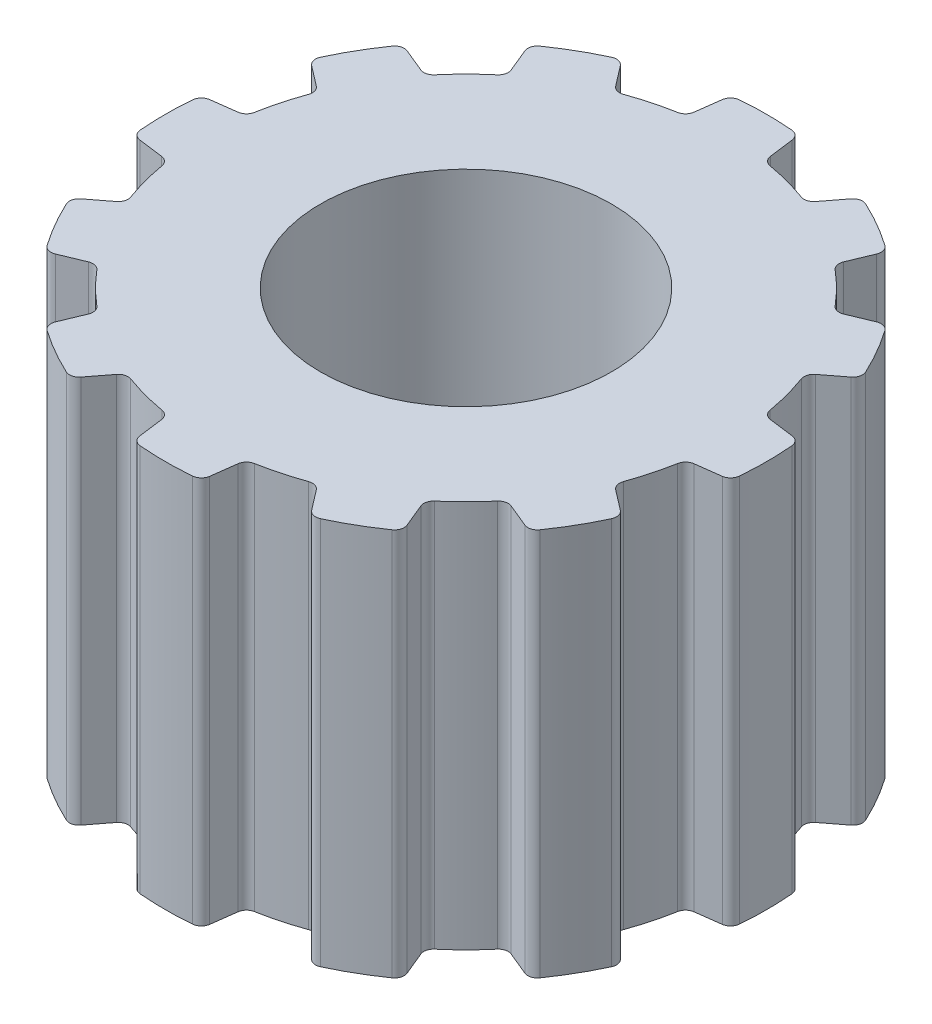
ISO-10303-21;
HEADER;
FILE_DESCRIPTION(('STEP AP214'),'2;1');
FILE_NAME('part.step','',(''),(''),'','','');
FILE_SCHEMA(('AUTOMOTIVE_DESIGN { 1 0 10303 214 1 1 1 1 }'));
ENDSEC;
DATA;
#1=APPLICATION_CONTEXT('core data for automotive mechanical design processes');
#2=APPLICATION_PROTOCOL_DEFINITION('international standard','automotive_design',2000,#1);
#3=PRODUCT_CONTEXT('',#1,'mechanical');
#4=PRODUCT('Part','Part','',(#3));
#5=PRODUCT_RELATED_PRODUCT_CATEGORY('part','',(#4));
#6=PRODUCT_DEFINITION_FORMATION('','',#4);
#7=PRODUCT_DEFINITION_CONTEXT('part definition',#1,'design');
#8=PRODUCT_DEFINITION('design','',#6,#7);
#9=PRODUCT_DEFINITION_SHAPE('','',#8);
#10=(LENGTH_UNIT() NAMED_UNIT(*) SI_UNIT(.MILLI.,.METRE.));
#11=(NAMED_UNIT(*) PLANE_ANGLE_UNIT() SI_UNIT($,.RADIAN.));
#12=(NAMED_UNIT(*) SI_UNIT($,.STERADIAN.) SOLID_ANGLE_UNIT());
#13=UNCERTAINTY_MEASURE_WITH_UNIT(LENGTH_MEASURE(1.E-05),#10,'distance_accuracy_value','');
#14=(GEOMETRIC_REPRESENTATION_CONTEXT(3) GLOBAL_UNCERTAINTY_ASSIGNED_CONTEXT((#13)) GLOBAL_UNIT_ASSIGNED_CONTEXT((#10,
#11,#12)) REPRESENTATION_CONTEXT('',''));
#15=CARTESIAN_POINT('',(0.,0.,0.));
#16=DIRECTION('',(0.,0.,1.));
#17=DIRECTION('',(1.,0.,0.));
#18=AXIS2_PLACEMENT_3D('',#15,#16,#17);
#19=CARTESIAN_POINT('',(0.,10.,0.));
#20=DIRECTION('',(0.,-1.,0.));
#21=DIRECTION('',(0.,0.,-1.));
#22=AXIS2_PLACEMENT_3D('',#19,#20,#21);
#23=CYLINDRICAL_SURFACE('',#22,6.75);
#24=CARTESIAN_POINT('',(0.,10.,0.));
#25=DIRECTION('',(0.,1.,0.));
#26=DIRECTION('',(0.,0.,1.));
#27=AXIS2_PLACEMENT_3D('',#24,#25,#26);
#28=CIRCLE('',#27,6.75);
#29=CARTESIAN_POINT('',(-4.35250340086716,10.,-5.15928426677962));
#30=VERTEX_POINT('',#29);
#31=CARTESIAN_POINT('',(-5.15928426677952,10.,-4.35250340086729));
#32=VERTEX_POINT('',#31);
#33=EDGE_CURVE('E49',#30,#32,#28,.T.);
#34=ORIENTED_EDGE('',*,*,#33,.F.);
#35=DIRECTION('',(0.,-1.,0.));
#36=VECTOR('',#35,1.);
#37=CARTESIAN_POINT('',(-4.35250340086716,10.,-5.15928426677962));
#38=LINE('',#37,#36);
#39=CARTESIAN_POINT('',(-4.35250340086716,0.,-5.15928426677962));
#40=VERTEX_POINT('',#39);
#41=EDGE_CURVE('E1362',#30,#40,#38,.T.);
#42=ORIENTED_EDGE('',*,*,#41,.T.);
#43=CARTESIAN_POINT('',(0.,0.,0.));
#44=DIRECTION('',(0.,1.,0.));
#45=DIRECTION('',(0.,0.,1.));
#46=AXIS2_PLACEMENT_3D('',#43,#44,#45);
#47=CIRCLE('',#46,6.75);
#48=CARTESIAN_POINT('',(-5.15928426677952,0.,-4.35250340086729));
#49=VERTEX_POINT('',#48);
#50=EDGE_CURVE('E57',#40,#49,#47,.T.);
#51=ORIENTED_EDGE('',*,*,#50,.T.);
#52=DIRECTION('',(0.,-1.,0.));
#53=VECTOR('',#52,1.);
#54=CARTESIAN_POINT('',(-5.15928426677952,10.,-4.35250340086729));
#55=LINE('',#54,#53);
#56=EDGE_CURVE('E1307',#49,#32,#55,.F.);
#57=ORIENTED_EDGE('',*,*,#56,.T.);
#58=EDGE_LOOP('',(#34,#42,#51,#57));
#59=FACE_BOUND('',#58,.T.);
#60=ADVANCED_FACE('F34',(#59),#23,.T.);
#61=CARTESIAN_POINT('',(-4.3012586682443,10.,-6.14403563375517));
#62=DIRECTION('',(0.,-1.,0.));
#63=DIRECTION('',(-0.499999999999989,0.,-0.866025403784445));
#64=AXIS2_PLACEMENT_3D('',#61,#62,#63);
#65=CYLINDRICAL_SURFACE('',#64,0.25);
#66=CARTESIAN_POINT('',(-4.3012586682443,10.,-6.14403563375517));
#67=DIRECTION('',(0.,1.,0.));
#68=DIRECTION('',(0.499999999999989,0.,0.866025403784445));
#69=AXIS2_PLACEMENT_3D('',#66,#67,#68);
#70=CIRCLE('',#69,0.25);
#71=CARTESIAN_POINT('',(-4.44463395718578,10.,-6.34883682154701));
#72=VERTEX_POINT('',#71);
#73=CARTESIAN_POINT('',(-4.53222855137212,10.,-6.0483647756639));
#74=VERTEX_POINT('',#73);
#75=EDGE_CURVE('E42',#72,#74,#70,.T.);
#76=ORIENTED_EDGE('',*,*,#75,.F.);
#77=DIRECTION('',(0.,-1.,0.));
#78=VECTOR('',#77,1.);
#79=CARTESIAN_POINT('',(-4.44463395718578,10.,-6.34883682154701));
#80=LINE('',#79,#78);
#81=CARTESIAN_POINT('',(-4.44463395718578,0.,-6.34883682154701));
#82=VERTEX_POINT('',#81);
#83=EDGE_CURVE('E1336',#82,#72,#80,.F.);
#84=ORIENTED_EDGE('',*,*,#83,.F.);
#85=CARTESIAN_POINT('',(-4.3012586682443,0.,-6.14403563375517));
#86=DIRECTION('',(0.,1.,0.));
#87=DIRECTION('',(0.499999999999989,0.,0.866025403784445));
#88=AXIS2_PLACEMENT_3D('',#85,#86,#87);
#89=CIRCLE('',#88,0.25);
#90=CARTESIAN_POINT('',(-4.53222855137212,0.,-6.0483647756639));
#91=VERTEX_POINT('',#90);
#92=EDGE_CURVE('E11',#91,#82,#89,.F.);
#93=ORIENTED_EDGE('',*,*,#92,.F.);
#94=DIRECTION('',(0.,-1.,0.));
#95=VECTOR('',#94,1.);
#96=CARTESIAN_POINT('',(-4.53222855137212,10.,-6.0483647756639));
#97=LINE('',#96,#95);
#98=EDGE_CURVE('E1327',#74,#91,#97,.T.);
#99=ORIENTED_EDGE('',*,*,#98,.F.);
#100=EDGE_LOOP('',(#76,#84,#93,#99));
#101=FACE_BOUND('',#100,.T.);
#102=ADVANCED_FACE('F36',(#101),#65,.T.);
#103=CARTESIAN_POINT('',(-3.17026160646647,10.,-6.79701709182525));
#104=DIRECTION('',(0.,-1.,0.));
#105=DIRECTION('',(-0.499999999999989,0.,-0.866025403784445));
#106=AXIS2_PLACEMENT_3D('',#103,#104,#105);
#107=CYLINDRICAL_SURFACE('',#106,0.25);
#108=CARTESIAN_POINT('',(-3.17026160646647,10.,-6.79701709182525));
#109=DIRECTION('',(0.,1.,0.));
#110=DIRECTION('',(0.499999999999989,0.,0.866025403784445));
#111=AXIS2_PLACEMENT_3D('',#108,#109,#110);
#112=CIRCLE('',#111,0.25);
#113=CARTESIAN_POINT('',(-2.97192327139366,10.,-6.94920744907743));
#114=VERTEX_POINT('',#113);
#115=CARTESIAN_POINT('',(-3.27593699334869,10.,-7.02358432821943));
#116=VERTEX_POINT('',#115);
#117=EDGE_CURVE('E1364',#114,#116,#112,.T.);
#118=ORIENTED_EDGE('',*,*,#117,.F.);
#119=DIRECTION('',(0.,1.,0.));
#120=VECTOR('',#119,1.);
#121=CARTESIAN_POINT('',(-2.97192327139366,10.,-6.94920744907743));
#122=LINE('',#121,#120);
#123=CARTESIAN_POINT('',(-2.97192327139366,0.,-6.94920744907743));
#124=VERTEX_POINT('',#123);
#125=EDGE_CURVE('E1346',#124,#114,#122,.T.);
#126=ORIENTED_EDGE('',*,*,#125,.F.);
#127=CARTESIAN_POINT('',(-3.17026160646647,0.,-6.79701709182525));
#128=DIRECTION('',(0.,1.,0.));
#129=DIRECTION('',(0.499999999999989,0.,0.866025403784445));
#130=AXIS2_PLACEMENT_3D('',#127,#128,#129);
#131=CIRCLE('',#130,0.25);
#132=CARTESIAN_POINT('',(-3.27593699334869,0.,-7.02358432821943));
#133=VERTEX_POINT('',#132);
#134=EDGE_CURVE('E1367',#133,#124,#131,.F.);
#135=ORIENTED_EDGE('',*,*,#134,.F.);
#136=DIRECTION('',(0.,-1.,0.));
#137=VECTOR('',#136,1.);
#138=CARTESIAN_POINT('',(-3.27593699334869,10.,-7.02358432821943));
#139=LINE('',#138,#137);
#140=EDGE_CURVE('E1341',#116,#133,#139,.T.);
#141=ORIENTED_EDGE('',*,*,#140,.F.);
#142=EDGE_LOOP('',(#118,#126,#135,#141));
#143=FACE_BOUND('',#142,.T.);
#144=ADVANCED_FACE('F1750',(#143),#107,.T.);
#145=CARTESIAN_POINT('',(-4.51370723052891,10.,-5.35036886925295));
#146=DIRECTION('',(0.,-1.,0.));
#147=DIRECTION('',(-0.499999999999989,0.,-0.866025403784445));
#148=AXIS2_PLACEMENT_3D('',#145,#146,#147);
#149=CYLINDRICAL_SURFACE('',#148,0.25);
#150=CARTESIAN_POINT('',(-4.51370723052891,10.,-5.35036886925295));
#151=DIRECTION('',(0.,1.,0.));
#152=DIRECTION('',(0.499999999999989,0.,0.866025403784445));
#153=AXIS2_PLACEMENT_3D('',#150,#151,#152);
#154=CIRCLE('',#153,0.25);
#155=CARTESIAN_POINT('',(-4.28273734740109,10.,-5.44603972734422));
#156=VERTEX_POINT('',#155);
#157=EDGE_CURVE('E1358',#156,#30,#154,.F.);
#158=ORIENTED_EDGE('',*,*,#157,.F.);
#159=DIRECTION('',(0.,1.,0.));
#160=VECTOR('',#159,1.);
#161=CARTESIAN_POINT('',(-4.28273734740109,10.,-5.44603972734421));
#162=LINE('',#161,#160);
#163=CARTESIAN_POINT('',(-4.28273734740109,0.,-5.44603972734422));
#164=VERTEX_POINT('',#163);
#165=EDGE_CURVE('E1331',#164,#156,#162,.T.);
#166=ORIENTED_EDGE('',*,*,#165,.F.);
#167=CARTESIAN_POINT('',(-4.51370723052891,0.,-5.35036886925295));
#168=DIRECTION('',(0.,1.,0.));
#169=DIRECTION('',(0.499999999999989,0.,0.866025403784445));
#170=AXIS2_PLACEMENT_3D('',#167,#168,#169);
#171=CIRCLE('',#170,0.25);
#172=EDGE_CURVE('E1360',#40,#164,#171,.T.);
#173=ORIENTED_EDGE('',*,*,#172,.F.);
#174=ORIENTED_EDGE('',*,*,#41,.F.);
#175=EDGE_LOOP('',(#158,#166,#173,#174));
#176=FACE_BOUND('',#175,.T.);
#177=ADVANCED_FACE('F1384',(#176),#149,.F.);
#178=CARTESIAN_POINT('',(-2.37670174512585,10.,-6.58416956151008));
#179=DIRECTION('',(0.,-1.,0.));
#180=DIRECTION('',(-0.499999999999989,0.,-0.866025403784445));
#181=AXIS2_PLACEMENT_3D('',#178,#179,#180);
#182=CYLINDRICAL_SURFACE('',#181,0.25);
#183=CARTESIAN_POINT('',(-2.37670174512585,10.,-6.58416956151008));
#184=DIRECTION('',(0.,1.,0.));
#185=DIRECTION('',(0.499999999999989,0.,0.866025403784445));
#186=AXIS2_PLACEMENT_3D('',#183,#184,#185);
#187=CIRCLE('',#186,0.25);
#188=CARTESIAN_POINT('',(-2.29181953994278,10.,-6.349020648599));
#189=VERTEX_POINT('',#188);
#190=CARTESIAN_POINT('',(-2.57504008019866,10.,-6.4319792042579));
#191=VERTEX_POINT('',#190);
#192=EDGE_CURVE('E1353',#189,#191,#187,.F.);
#193=ORIENTED_EDGE('',*,*,#192,.F.);
#194=DIRECTION('',(0.,-1.,0.));
#195=VECTOR('',#194,1.);
#196=CARTESIAN_POINT('',(-2.29181953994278,10.,-6.349020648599));
#197=LINE('',#196,#195);
#198=CARTESIAN_POINT('',(-2.29181953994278,0.,-6.349020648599));
#199=VERTEX_POINT('',#198);
#200=EDGE_CURVE('E1355',#199,#189,#197,.F.);
#201=ORIENTED_EDGE('',*,*,#200,.F.);
#202=CARTESIAN_POINT('',(-2.37670174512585,0.,-6.58416956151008));
#203=DIRECTION('',(0.,1.,0.));
#204=DIRECTION('',(0.499999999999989,0.,0.866025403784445));
#205=AXIS2_PLACEMENT_3D('',#202,#203,#204);
#206=CIRCLE('',#205,0.25);
#207=CARTESIAN_POINT('',(-2.57504008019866,0.,-6.4319792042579));
#208=VERTEX_POINT('',#207);
#209=EDGE_CURVE('E655',#208,#199,#206,.T.);
#210=ORIENTED_EDGE('',*,*,#209,.F.);
#211=DIRECTION('',(0.,-1.,0.));
#212=VECTOR('',#211,1.);
#213=CARTESIAN_POINT('',(-2.57504008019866,10.,-6.4319792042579));
#214=LINE('',#213,#212);
#215=EDGE_CURVE('E1350',#191,#208,#214,.T.);
#216=ORIENTED_EDGE('',*,*,#215,.F.);
#217=EDGE_LOOP('',(#193,#201,#210,#216));
#218=FACE_BOUND('',#217,.T.);
#219=ADVANCED_FACE('F1848',(#218),#182,.F.);
#220=CARTESIAN_POINT('',(0.119634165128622,10.,-2.92021135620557));
#221=DIRECTION('',(0.793353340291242,0.,-0.608761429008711));
#222=DIRECTION('',(-0.608761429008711,0.,-0.793353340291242));
#223=AXIS2_PLACEMENT_3D('',#220,#221,#222);
#224=PLANE('',#223);
#225=DIRECTION('',(0.608761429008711,0.,0.793353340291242));
#226=VECTOR('',#225,1.);
#227=CARTESIAN_POINT('',(0.119634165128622,0.,-2.92021135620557));
#228=LINE('',#227,#226);
#229=EDGE_CURVE('E1344',#124,#208,#228,.T.);
#230=ORIENTED_EDGE('',*,*,#229,.F.);
#231=ORIENTED_EDGE('',*,*,#125,.T.);
#232=DIRECTION('',(0.608761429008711,0.,0.793353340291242));
#233=VECTOR('',#232,1.);
#234=CARTESIAN_POINT('',(0.119634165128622,10.,-2.92021135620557));
#235=LINE('',#234,#233);
#236=EDGE_CURVE('E1348',#114,#191,#235,.T.);
#237=ORIENTED_EDGE('',*,*,#236,.T.);
#238=ORIENTED_EDGE('',*,*,#215,.T.);
#239=EDGE_LOOP('',(#230,#231,#237,#238));
#240=FACE_BOUND('',#239,.T.);
#241=ADVANCED_FACE('F1844',(#240),#224,.T.);
#242=CARTESIAN_POINT('',(0.,10.,0.));
#243=DIRECTION('',(0.,-1.,0.));
#244=DIRECTION('',(-0.499999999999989,0.,-0.866025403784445));
#245=AXIS2_PLACEMENT_3D('',#242,#243,#244);
#246=CYLINDRICAL_SURFACE('',#245,7.75);
#247=CARTESIAN_POINT('',(0.,0.,0.));
#248=DIRECTION('',(0.,1.,0.));
#249=DIRECTION('',(0.499999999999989,0.,0.866025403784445));
#250=AXIS2_PLACEMENT_3D('',#247,#248,#249);
#251=CIRCLE('',#250,7.75);
#252=EDGE_CURVE('E1334',#133,#82,#251,.T.);
#253=ORIENTED_EDGE('',*,*,#252,.T.);
#254=ORIENTED_EDGE('',*,*,#83,.T.);
#255=CARTESIAN_POINT('',(0.,10.,0.));
#256=DIRECTION('',(0.,1.,0.));
#257=DIRECTION('',(0.499999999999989,0.,0.866025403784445));
#258=AXIS2_PLACEMENT_3D('',#255,#256,#257);
#259=CIRCLE('',#258,7.75);
#260=EDGE_CURVE('E1338',#116,#72,#259,.T.);
#261=ORIENTED_EDGE('',*,*,#260,.F.);
#262=ORIENTED_EDGE('',*,*,#140,.T.);
#263=EDGE_LOOP('',(#253,#254,#261,#262));
#264=FACE_BOUND('',#263,.T.);
#265=ADVANCED_FACE('F1841',(#264),#246,.T.);
#266=CARTESIAN_POINT('',(-0.871364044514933,10.,2.78974396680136));
#267=DIRECTION('',(0.923879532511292,0.,-0.382683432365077));
#268=DIRECTION('',(-0.382683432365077,0.,-0.923879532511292));
#269=AXIS2_PLACEMENT_3D('',#266,#267,#268);
#270=PLANE('',#269);
#271=DIRECTION('',(0.382683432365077,0.,0.923879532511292));
#272=VECTOR('',#271,1.);
#273=CARTESIAN_POINT('',(-0.871364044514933,10.,2.78974396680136));
#274=LINE('',#273,#272);
#275=EDGE_CURVE('E665',#74,#156,#274,.T.);
#276=ORIENTED_EDGE('',*,*,#275,.F.);
#277=ORIENTED_EDGE('',*,*,#98,.T.);
#278=DIRECTION('',(0.382683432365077,0.,0.923879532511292));
#279=VECTOR('',#278,1.);
#280=CARTESIAN_POINT('',(-0.871364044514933,0.,2.78974396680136));
#281=LINE('',#280,#279);
#282=EDGE_CURVE('E1329',#91,#164,#281,.T.);
#283=ORIENTED_EDGE('',*,*,#282,.T.);
#284=ORIENTED_EDGE('',*,*,#165,.T.);
#285=EDGE_LOOP('',(#276,#277,#283,#284));
#286=FACE_BOUND('',#285,.T.);
#287=ADVANCED_FACE('F1379',(#286),#270,.F.);
#288=CARTESIAN_POINT('',(-6.34902064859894,10.,-2.29181953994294));
#289=VERTEX_POINT('',#288);
#290=CARTESIAN_POINT('',(-6.64432294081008,10.,-1.18973638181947));
#291=VERTEX_POINT('',#290);
#292=EDGE_CURVE('E757',#289,#291,#28,.T.);
#293=ORIENTED_EDGE('',*,*,#292,.F.);
#294=DIRECTION('',(0.,-1.,0.));
#295=VECTOR('',#294,1.);
#296=CARTESIAN_POINT('',(-6.34902064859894,10.,-2.29181953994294));
#297=LINE('',#296,#295);
#298=CARTESIAN_POINT('',(-6.34902064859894,0.,-2.29181953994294));
#299=VERTEX_POINT('',#298);
#300=EDGE_CURVE('E1316',#289,#299,#297,.T.);
#301=ORIENTED_EDGE('',*,*,#300,.T.);
#302=CARTESIAN_POINT('',(-6.64432294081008,0.,-1.18973638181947));
#303=VERTEX_POINT('',#302);
#304=EDGE_CURVE('E666',#299,#303,#47,.T.);
#305=ORIENTED_EDGE('',*,*,#304,.T.);
#306=DIRECTION('',(0.,-1.,0.));
#307=VECTOR('',#306,1.);
#308=CARTESIAN_POINT('',(-6.64432294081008,10.,-1.18973638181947));
#309=LINE('',#308,#307);
#310=EDGE_CURVE('E1259',#303,#291,#309,.F.);
#311=ORIENTED_EDGE('',*,*,#310,.T.);
#312=EDGE_LOOP('',(#293,#301,#305,#311));
#313=FACE_BOUND('',#312,.T.);
#314=ADVANCED_FACE('F1416',(#313),#23,.T.);
#315=CARTESIAN_POINT('',(-6.79701709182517,10.,-3.17026160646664));
#316=DIRECTION('',(0.,-1.,0.));
#317=DIRECTION('',(-0.866025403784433,0.,-0.50000000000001));
#318=AXIS2_PLACEMENT_3D('',#315,#316,#317);
#319=CYLINDRICAL_SURFACE('',#318,0.25);
#320=CARTESIAN_POINT('',(-6.79701709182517,10.,-3.17026160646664));
#321=DIRECTION('',(0.,1.,0.));
#322=DIRECTION('',(0.866025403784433,0.,0.50000000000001));
#323=AXIS2_PLACEMENT_3D('',#320,#321,#322);
#324=CIRCLE('',#323,0.25);
#325=CARTESIAN_POINT('',(-7.02358432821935,10.,-3.27593699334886));
#326=VERTEX_POINT('',#325);
#327=CARTESIAN_POINT('',(-6.94920744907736,10.,-2.97192327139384));
#328=VERTEX_POINT('',#327);
#329=EDGE_CURVE('E778',#326,#328,#324,.T.);
#330=ORIENTED_EDGE('',*,*,#329,.F.);
#331=DIRECTION('',(0.,-1.,0.));
#332=VECTOR('',#331,1.);
#333=CARTESIAN_POINT('',(-7.02358432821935,10.,-3.27593699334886));
#334=LINE('',#333,#332);
#335=CARTESIAN_POINT('',(-7.02358432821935,0.,-3.27593699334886));
#336=VERTEX_POINT('',#335);
#337=EDGE_CURVE('E1288',#336,#326,#334,.F.);
#338=ORIENTED_EDGE('',*,*,#337,.F.);
#339=CARTESIAN_POINT('',(-6.79701709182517,0.,-3.17026160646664));
#340=DIRECTION('',(0.,1.,0.));
#341=DIRECTION('',(0.866025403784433,0.,0.50000000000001));
#342=AXIS2_PLACEMENT_3D('',#339,#340,#341);
#343=CIRCLE('',#342,0.25);
#344=CARTESIAN_POINT('',(-6.94920744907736,0.,-2.97192327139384));
#345=VERTEX_POINT('',#344);
#346=EDGE_CURVE('E774',#345,#336,#343,.F.);
#347=ORIENTED_EDGE('',*,*,#346,.F.);
#348=DIRECTION('',(0.,-1.,0.));
#349=VECTOR('',#348,1.);
#350=CARTESIAN_POINT('',(-6.94920744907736,10.,-2.97192327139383));
#351=LINE('',#350,#349);
#352=EDGE_CURVE('E763',#328,#345,#351,.T.);
#353=ORIENTED_EDGE('',*,*,#352,.F.);
#354=EDGE_LOOP('',(#330,#338,#347,#353));
#355=FACE_BOUND('',#354,.T.);
#356=ADVANCED_FACE('F1405',(#355),#319,.T.);
#357=CARTESIAN_POINT('',(-6.14403563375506,10.,-4.30125866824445));
#358=DIRECTION('',(0.,-1.,0.));
#359=DIRECTION('',(-0.866025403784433,0.,-0.50000000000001));
#360=AXIS2_PLACEMENT_3D('',#357,#358,#359);
#361=CYLINDRICAL_SURFACE('',#360,0.25);
#362=CARTESIAN_POINT('',(-6.14403563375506,10.,-4.30125866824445));
#363=DIRECTION('',(0.,1.,0.));
#364=DIRECTION('',(0.866025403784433,0.,0.50000000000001));
#365=AXIS2_PLACEMENT_3D('',#362,#363,#364);
#366=CIRCLE('',#365,0.25);
#367=CARTESIAN_POINT('',(-6.04836477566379,10.,-4.53222855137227));
#368=VERTEX_POINT('',#367);
#369=CARTESIAN_POINT('',(-6.3488368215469,10.,-4.44463395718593));
#370=VERTEX_POINT('',#369);
#371=EDGE_CURVE('E1318',#368,#370,#366,.T.);
#372=ORIENTED_EDGE('',*,*,#371,.F.);
#373=DIRECTION('',(0.,1.,0.));
#374=VECTOR('',#373,1.);
#375=CARTESIAN_POINT('',(-6.04836477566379,10.,-4.53222855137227));
#376=LINE('',#375,#374);
#377=CARTESIAN_POINT('',(-6.04836477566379,0.,-4.53222855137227));
#378=VERTEX_POINT('',#377);
#379=EDGE_CURVE('E1298',#378,#368,#376,.T.);
#380=ORIENTED_EDGE('',*,*,#379,.F.);
#381=CARTESIAN_POINT('',(-6.14403563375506,0.,-4.30125866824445));
#382=DIRECTION('',(0.,1.,0.));
#383=DIRECTION('',(0.866025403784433,0.,0.50000000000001));
#384=AXIS2_PLACEMENT_3D('',#381,#382,#383);
#385=CIRCLE('',#384,0.25);
#386=CARTESIAN_POINT('',(-6.3488368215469,0.,-4.44463395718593));
#387=VERTEX_POINT('',#386);
#388=EDGE_CURVE('E1321',#387,#378,#385,.F.);
#389=ORIENTED_EDGE('',*,*,#388,.F.);
#390=DIRECTION('',(0.,-1.,0.));
#391=VECTOR('',#390,1.);
#392=CARTESIAN_POINT('',(-6.3488368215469,10.,-4.44463395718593));
#393=LINE('',#392,#391);
#394=EDGE_CURVE('E1293',#370,#387,#393,.T.);
#395=ORIENTED_EDGE('',*,*,#394,.F.);
#396=EDGE_LOOP('',(#372,#380,#389,#395));
#397=FACE_BOUND('',#396,.T.);
#398=ADVANCED_FACE('F1398',(#397),#361,.T.);
#399=CARTESIAN_POINT('',(-6.58416956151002,10.,-2.37670174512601));
#400=DIRECTION('',(0.,-1.,0.));
#401=DIRECTION('',(-0.866025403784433,0.,-0.50000000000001));
#402=AXIS2_PLACEMENT_3D('',#399,#400,#401);
#403=CYLINDRICAL_SURFACE('',#402,0.25);
#404=CARTESIAN_POINT('',(-6.58416956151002,10.,-2.37670174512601));
#405=DIRECTION('',(0.,1.,0.));
#406=DIRECTION('',(0.866025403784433,0.,0.50000000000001));
#407=AXIS2_PLACEMENT_3D('',#404,#405,#406);
#408=CIRCLE('',#407,0.25);
#409=CARTESIAN_POINT('',(-6.43197920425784,10.,-2.57504008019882));
#410=VERTEX_POINT('',#409);
#411=EDGE_CURVE('E1311',#410,#289,#408,.F.);
#412=ORIENTED_EDGE('',*,*,#411,.F.);
#413=DIRECTION('',(0.,1.,0.));
#414=VECTOR('',#413,1.);
#415=CARTESIAN_POINT('',(-6.43197920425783,10.,-2.57504008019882));
#416=LINE('',#415,#414);
#417=CARTESIAN_POINT('',(-6.43197920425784,0.,-2.57504008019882));
#418=VERTEX_POINT('',#417);
#419=EDGE_CURVE('E1283',#418,#410,#416,.T.);
#420=ORIENTED_EDGE('',*,*,#419,.F.);
#421=CARTESIAN_POINT('',(-6.58416956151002,0.,-2.37670174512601));
#422=DIRECTION('',(0.,1.,0.));
#423=DIRECTION('',(0.866025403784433,0.,0.50000000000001));
#424=AXIS2_PLACEMENT_3D('',#421,#422,#423);
#425=CIRCLE('',#424,0.25);
#426=EDGE_CURVE('E1313',#299,#418,#425,.T.);
#427=ORIENTED_EDGE('',*,*,#426,.F.);
#428=ORIENTED_EDGE('',*,*,#300,.F.);
#429=EDGE_LOOP('',(#412,#420,#427,#428));
#430=FACE_BOUND('',#429,.T.);
#431=ADVANCED_FACE('F1415',(#430),#403,.F.);
#432=CARTESIAN_POINT('',(-5.35036886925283,10.,-4.51370723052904));
#433=DIRECTION('',(0.,-1.,0.));
#434=DIRECTION('',(-0.866025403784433,0.,-0.50000000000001));
#435=AXIS2_PLACEMENT_3D('',#432,#433,#434);
#436=CYLINDRICAL_SURFACE('',#435,0.25);
#437=CARTESIAN_POINT('',(-5.35036886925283,10.,-4.51370723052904));
#438=DIRECTION('',(0.,1.,0.));
#439=DIRECTION('',(0.866025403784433,0.,0.50000000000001));
#440=AXIS2_PLACEMENT_3D('',#437,#438,#439);
#441=CIRCLE('',#440,0.25);
#442=CARTESIAN_POINT('',(-5.44603972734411,10.,-4.28273734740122));
#443=VERTEX_POINT('',#442);
#444=EDGE_CURVE('E1305',#32,#443,#441,.F.);
#445=ORIENTED_EDGE('',*,*,#444,.F.);
#446=ORIENTED_EDGE('',*,*,#56,.F.);
#447=CARTESIAN_POINT('',(-5.35036886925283,0.,-4.51370723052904));
#448=DIRECTION('',(0.,1.,0.));
#449=DIRECTION('',(0.866025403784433,0.,0.50000000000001));
#450=AXIS2_PLACEMENT_3D('',#447,#448,#449);
#451=CIRCLE('',#450,0.25);
#452=CARTESIAN_POINT('',(-5.44603972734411,0.,-4.28273734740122));
#453=VERTEX_POINT('',#452);
#454=EDGE_CURVE('E1309',#453,#49,#451,.T.);
#455=ORIENTED_EDGE('',*,*,#454,.F.);
#456=DIRECTION('',(0.,-1.,0.));
#457=VECTOR('',#456,1.);
#458=CARTESIAN_POINT('',(-5.44603972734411,10.,-4.28273734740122));
#459=LINE('',#458,#457);
#460=EDGE_CURVE('E1302',#443,#453,#459,.T.);
#461=ORIENTED_EDGE('',*,*,#460,.F.);
#462=EDGE_LOOP('',(#445,#446,#455,#461));
#463=FACE_BOUND('',#462,.T.);
#464=ADVANCED_FACE('F1388',(#463),#436,.F.);
#465=CARTESIAN_POINT('',(-1.35649945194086,10.,-2.58879430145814));
#466=DIRECTION('',(0.3826834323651,0.,-0.923879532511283));
#467=DIRECTION('',(-0.923879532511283,0.,-0.3826834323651));
#468=AXIS2_PLACEMENT_3D('',#465,#466,#467);
#469=PLANE('',#468);
#470=DIRECTION('',(0.923879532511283,0.,0.3826834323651));
#471=VECTOR('',#470,1.);
#472=CARTESIAN_POINT('',(-1.35649945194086,0.,-2.58879430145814));
#473=LINE('',#472,#471);
#474=EDGE_CURVE('E1296',#378,#453,#473,.T.);
#475=ORIENTED_EDGE('',*,*,#474,.F.);
#476=ORIENTED_EDGE('',*,*,#379,.T.);
#477=DIRECTION('',(0.923879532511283,0.,0.3826834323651));
#478=VECTOR('',#477,1.);
#479=CARTESIAN_POINT('',(-1.35649945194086,10.,-2.58879430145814));
#480=LINE('',#479,#478);
#481=EDGE_CURVE('E1300',#368,#443,#480,.T.);
#482=ORIENTED_EDGE('',*,*,#481,.T.);
#483=ORIENTED_EDGE('',*,*,#460,.T.);
#484=EDGE_LOOP('',(#475,#476,#482,#483));
#485=FACE_BOUND('',#484,.T.);
#486=ADVANCED_FACE('F1393',(#485),#469,.T.);
#487=CARTESIAN_POINT('',(0.,10.,0.));
#488=DIRECTION('',(0.,-1.,0.));
#489=DIRECTION('',(-0.866025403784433,0.,-0.50000000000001));
#490=AXIS2_PLACEMENT_3D('',#487,#488,#489);
#491=CYLINDRICAL_SURFACE('',#490,7.75);
#492=CARTESIAN_POINT('',(0.,0.,0.));
#493=DIRECTION('',(0.,1.,0.));
#494=DIRECTION('',(0.866025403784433,0.,0.50000000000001));
#495=AXIS2_PLACEMENT_3D('',#492,#493,#494);
#496=CIRCLE('',#495,7.75);
#497=EDGE_CURVE('E1286',#387,#336,#496,.T.);
#498=ORIENTED_EDGE('',*,*,#497,.T.);
#499=ORIENTED_EDGE('',*,*,#337,.T.);
#500=CARTESIAN_POINT('',(0.,10.,0.));
#501=DIRECTION('',(0.,1.,0.));
#502=DIRECTION('',(0.866025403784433,0.,0.50000000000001));
#503=AXIS2_PLACEMENT_3D('',#500,#501,#502);
#504=CIRCLE('',#503,7.75);
#505=EDGE_CURVE('E1290',#370,#326,#504,.T.);
#506=ORIENTED_EDGE('',*,*,#505,.F.);
#507=ORIENTED_EDGE('',*,*,#394,.T.);
#508=EDGE_LOOP('',(#498,#499,#506,#507));
#509=FACE_BOUND('',#508,.T.);
#510=ADVANCED_FACE('F1400',(#509),#491,.T.);
#511=CARTESIAN_POINT('',(0.640248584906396,10.,2.85167116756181));
#512=DIRECTION('',(0.608761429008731,0.,-0.793353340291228));
#513=DIRECTION('',(-0.793353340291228,0.,-0.608761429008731));
#514=AXIS2_PLACEMENT_3D('',#511,#512,#513);
#515=PLANE('',#514);
#516=DIRECTION('',(0.793353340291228,0.,0.608761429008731));
#517=VECTOR('',#516,1.);
#518=CARTESIAN_POINT('',(0.640248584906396,10.,2.85167116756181));
#519=LINE('',#518,#517);
#520=EDGE_CURVE('E758',#328,#410,#519,.T.);
#521=ORIENTED_EDGE('',*,*,#520,.F.);
#522=ORIENTED_EDGE('',*,*,#352,.T.);
#523=DIRECTION('',(0.793353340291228,0.,0.608761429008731));
#524=VECTOR('',#523,1.);
#525=CARTESIAN_POINT('',(0.640248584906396,0.,2.85167116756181));
#526=LINE('',#525,#524);
#527=EDGE_CURVE('E1281',#345,#418,#526,.T.);
#528=ORIENTED_EDGE('',*,*,#527,.T.);
#529=ORIENTED_EDGE('',*,*,#419,.T.);
#530=EDGE_LOOP('',(#521,#522,#528,#529));
#531=FACE_BOUND('',#530,.T.);
#532=ADVANCED_FACE('F1409',(#531),#515,.F.);
#533=CARTESIAN_POINT('',(-6.64432294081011,10.,1.18973638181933));
#534=VERTEX_POINT('',#533);
#535=CARTESIAN_POINT('',(-6.34902064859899,10.,2.2918195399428));
#536=VERTEX_POINT('',#535);
#537=EDGE_CURVE('E748',#534,#536,#28,.T.);
#538=ORIENTED_EDGE('',*,*,#537,.F.);
#539=DIRECTION('',(0.,-1.,0.));
#540=VECTOR('',#539,1.);
#541=CARTESIAN_POINT('',(-6.64432294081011,10.,1.18973638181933));
#542=LINE('',#541,#540);
#543=CARTESIAN_POINT('',(-6.64432294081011,0.,1.18973638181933));
#544=VERTEX_POINT('',#543);
#545=EDGE_CURVE('E1270',#534,#544,#542,.T.);
#546=ORIENTED_EDGE('',*,*,#545,.T.);
#547=CARTESIAN_POINT('',(-6.34902064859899,0.,2.2918195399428));
#548=VERTEX_POINT('',#547);
#549=EDGE_CURVE('E740',#544,#548,#47,.T.);
#550=ORIENTED_EDGE('',*,*,#549,.T.);
#551=DIRECTION('',(0.,-1.,0.));
#552=VECTOR('',#551,1.);
#553=CARTESIAN_POINT('',(-6.34902064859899,10.,2.2918195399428));
#554=LINE('',#553,#552);
#555=EDGE_CURVE('E1208',#548,#536,#554,.F.);
#556=ORIENTED_EDGE('',*,*,#555,.T.);
#557=EDGE_LOOP('',(#538,#546,#550,#556));
#558=FACE_BOUND('',#557,.T.);
#559=ADVANCED_FACE('F1447',(#558),#23,.T.);
#560=CARTESIAN_POINT('',(-7.47152027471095,10.,0.652981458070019));
#561=DIRECTION('',(0.,-1.,0.));
#562=DIRECTION('',(-1.,0.,0.));
#563=AXIS2_PLACEMENT_3D('',#560,#561,#562);
#564=CYLINDRICAL_SURFACE('',#563,0.25);
#565=CARTESIAN_POINT('',(-7.47152027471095,10.,0.652981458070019));
#566=DIRECTION('',(0.,1.,0.));
#567=DIRECTION('',(1.,0.,0.));
#568=AXIS2_PLACEMENT_3D('',#565,#566,#567);
#569=CIRCLE('',#568,0.25);
#570=CARTESIAN_POINT('',(-7.72057095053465,10.,0.674747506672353));
#571=VERTEX_POINT('',#570);
#572=CARTESIAN_POINT('',(-7.50415182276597,10.,0.900842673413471));
#573=VERTEX_POINT('',#572);
#574=EDGE_CURVE('E771',#571,#573,#569,.T.);
#575=ORIENTED_EDGE('',*,*,#574,.F.);
#576=DIRECTION('',(0.,-1.,0.));
#577=VECTOR('',#576,1.);
#578=CARTESIAN_POINT('',(-7.72057095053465,10.,0.674747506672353));
#579=LINE('',#578,#577);
#580=CARTESIAN_POINT('',(-7.72057095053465,0.,0.674747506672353));
#581=VERTEX_POINT('',#580);
#582=EDGE_CURVE('E1240',#581,#571,#579,.F.);
#583=ORIENTED_EDGE('',*,*,#582,.F.);
#584=CARTESIAN_POINT('',(-7.47152027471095,0.,0.652981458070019));
#585=DIRECTION('',(0.,1.,0.));
#586=DIRECTION('',(1.,0.,0.));
#587=AXIS2_PLACEMENT_3D('',#584,#585,#586);
#588=CIRCLE('',#587,0.25);
#589=CARTESIAN_POINT('',(-7.50415182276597,0.,0.900842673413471));
#590=VERTEX_POINT('',#589);
#591=EDGE_CURVE('E765',#590,#581,#588,.F.);
#592=ORIENTED_EDGE('',*,*,#591,.F.);
#593=DIRECTION('',(0.,-1.,0.));
#594=VECTOR('',#593,1.);
#595=CARTESIAN_POINT('',(-7.50415182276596,10.,0.900842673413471));
#596=LINE('',#595,#594);
#597=EDGE_CURVE('E754',#573,#590,#596,.T.);
#598=ORIENTED_EDGE('',*,*,#597,.F.);
#599=EDGE_LOOP('',(#575,#583,#592,#598));
#600=FACE_BOUND('',#599,.T.);
#601=ADVANCED_FACE('F1436',(#600),#564,.T.);
#602=CARTESIAN_POINT('',(-7.47152027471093,10.,-0.652981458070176));
#603=DIRECTION('',(0.,-1.,0.));
#604=DIRECTION('',(-1.,0.,0.));
#605=AXIS2_PLACEMENT_3D('',#602,#603,#604);
#606=CYLINDRICAL_SURFACE('',#605,0.25);
#607=CARTESIAN_POINT('',(-7.47152027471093,10.,-0.652981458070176));
#608=DIRECTION('',(0.,1.,0.));
#609=DIRECTION('',(1.,0.,0.));
#610=AXIS2_PLACEMENT_3D('',#607,#608,#609);
#611=CIRCLE('',#610,0.25);
#612=CARTESIAN_POINT('',(-7.50415182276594,10.,-0.900842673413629));
#613=VERTEX_POINT('',#612);
#614=CARTESIAN_POINT('',(-7.72057095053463,10.,-0.674747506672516));
#615=VERTEX_POINT('',#614);
#616=EDGE_CURVE('E1272',#613,#615,#611,.T.);
#617=ORIENTED_EDGE('',*,*,#616,.F.);
#618=DIRECTION('',(0.,1.,0.));
#619=VECTOR('',#618,1.);
#620=CARTESIAN_POINT('',(-7.50415182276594,10.,-0.900842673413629));
#621=LINE('',#620,#619);
#622=CARTESIAN_POINT('',(-7.50415182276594,0.,-0.900842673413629));
#623=VERTEX_POINT('',#622);
#624=EDGE_CURVE('E1250',#623,#613,#621,.T.);
#625=ORIENTED_EDGE('',*,*,#624,.F.);
#626=CARTESIAN_POINT('',(-7.47152027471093,0.,-0.652981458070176));
#627=DIRECTION('',(0.,1.,0.));
#628=DIRECTION('',(1.,0.,0.));
#629=AXIS2_PLACEMENT_3D('',#626,#627,#628);
#630=CIRCLE('',#629,0.25);
#631=CARTESIAN_POINT('',(-7.72057095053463,0.,-0.674747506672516));
#632=VERTEX_POINT('',#631);
#633=EDGE_CURVE('E1275',#632,#623,#630,.F.);
#634=ORIENTED_EDGE('',*,*,#633,.F.);
#635=DIRECTION('',(0.,-1.,0.));
#636=VECTOR('',#635,1.);
#637=CARTESIAN_POINT('',(-7.72057095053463,10.,-0.674747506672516));
#638=LINE('',#637,#636);
#639=EDGE_CURVE('E1245',#615,#632,#638,.T.);
#640=ORIENTED_EDGE('',*,*,#639,.F.);
#641=EDGE_LOOP('',(#617,#625,#634,#640));
#642=FACE_BOUND('',#641,.T.);
#643=ADVANCED_FACE('F1429',(#642),#606,.T.);
#644=CARTESIAN_POINT('',(-6.89040897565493,10.,1.23380069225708));
#645=DIRECTION('',(0.,-1.,0.));
#646=DIRECTION('',(-1.,0.,0.));
#647=AXIS2_PLACEMENT_3D('',#644,#645,#646);
#648=CYLINDRICAL_SURFACE('',#647,0.25);
#649=CARTESIAN_POINT('',(-6.89040897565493,10.,1.23380069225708));
#650=DIRECTION('',(0.,1.,0.));
#651=DIRECTION('',(1.,0.,0.));
#652=AXIS2_PLACEMENT_3D('',#649,#650,#651);
#653=CIRCLE('',#652,0.25);
#654=CARTESIAN_POINT('',(-6.85777742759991,10.,0.985939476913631));
#655=VERTEX_POINT('',#654);
#656=EDGE_CURVE('E1264',#655,#534,#653,.F.);
#657=ORIENTED_EDGE('',*,*,#656,.F.);
#658=DIRECTION('',(0.,1.,0.));
#659=VECTOR('',#658,1.);
#660=CARTESIAN_POINT('',(-6.85777742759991,10.,0.985939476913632));
#661=LINE('',#660,#659);
#662=CARTESIAN_POINT('',(-6.85777742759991,0.,0.985939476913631));
#663=VERTEX_POINT('',#662);
#664=EDGE_CURVE('E1235',#663,#655,#661,.T.);
#665=ORIENTED_EDGE('',*,*,#664,.F.);
#666=CARTESIAN_POINT('',(-6.89040897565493,0.,1.23380069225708));
#667=DIRECTION('',(0.,1.,0.));
#668=DIRECTION('',(1.,0.,0.));
#669=AXIS2_PLACEMENT_3D('',#666,#667,#668);
#670=CIRCLE('',#669,0.25);
#671=EDGE_CURVE('E1267',#544,#663,#670,.T.);
#672=ORIENTED_EDGE('',*,*,#671,.F.);
#673=ORIENTED_EDGE('',*,*,#545,.F.);
#674=EDGE_LOOP('',(#657,#665,#672,#673));
#675=FACE_BOUND('',#674,.T.);
#676=ADVANCED_FACE('F1446',(#675),#648,.F.);
#677=CARTESIAN_POINT('',(-6.8904089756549,10.,-1.23380069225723));
#678=DIRECTION('',(0.,-1.,0.));
#679=DIRECTION('',(-1.,0.,0.));
#680=AXIS2_PLACEMENT_3D('',#677,#678,#679);
#681=CYLINDRICAL_SURFACE('',#680,0.25);
#682=CARTESIAN_POINT('',(-6.8904089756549,10.,-1.23380069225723));
#683=DIRECTION('',(0.,1.,0.));
#684=DIRECTION('',(1.,0.,0.));
#685=AXIS2_PLACEMENT_3D('',#682,#683,#684);
#686=CIRCLE('',#685,0.25);
#687=CARTESIAN_POINT('',(-6.85777742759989,10.,-0.985939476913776));
#688=VERTEX_POINT('',#687);
#689=EDGE_CURVE('E1257',#291,#688,#686,.F.);
#690=ORIENTED_EDGE('',*,*,#689,.F.);
#691=ORIENTED_EDGE('',*,*,#310,.F.);
#692=CARTESIAN_POINT('',(-6.8904089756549,0.,-1.23380069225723));
#693=DIRECTION('',(0.,1.,0.));
#694=DIRECTION('',(1.,0.,0.));
#695=AXIS2_PLACEMENT_3D('',#692,#693,#694);
#696=CIRCLE('',#695,0.25);
#697=CARTESIAN_POINT('',(-6.85777742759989,0.,-0.985939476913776));
#698=VERTEX_POINT('',#697);
#699=EDGE_CURVE('E1261',#698,#303,#696,.T.);
#700=ORIENTED_EDGE('',*,*,#699,.F.);
#701=DIRECTION('',(0.,-1.,0.));
#702=VECTOR('',#701,1.);
#703=CARTESIAN_POINT('',(-6.85777742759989,10.,-0.985939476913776));
#704=LINE('',#703,#702);
#705=EDGE_CURVE('E1254',#688,#698,#704,.T.);
#706=ORIENTED_EDGE('',*,*,#705,.F.);
#707=EDGE_LOOP('',(#690,#691,#700,#706));
#708=FACE_BOUND('',#707,.T.);
#709=ADVANCED_FACE('F1419',(#708),#681,.F.);
#710=CARTESIAN_POINT('',(-2.46916013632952,10.,-1.56371190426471));
#711=DIRECTION('',(-0.130526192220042,0.,-0.991444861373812));
#712=DIRECTION('',(-0.991444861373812,0.,0.130526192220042));
#713=AXIS2_PLACEMENT_3D('',#710,#711,#712);
#714=PLANE('',#713);
#715=DIRECTION('',(0.991444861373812,0.,-0.130526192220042));
#716=VECTOR('',#715,1.);
#717=CARTESIAN_POINT('',(-2.46916013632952,0.,-1.56371190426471));
#718=LINE('',#717,#716);
#719=EDGE_CURVE('E1248',#623,#698,#718,.T.);
#720=ORIENTED_EDGE('',*,*,#719,.F.);
#721=ORIENTED_EDGE('',*,*,#624,.T.);
#722=DIRECTION('',(0.991444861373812,0.,-0.130526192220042));
#723=VECTOR('',#722,1.);
#724=CARTESIAN_POINT('',(-2.46916013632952,10.,-1.56371190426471));
#725=LINE('',#724,#723);
#726=EDGE_CURVE('E1252',#613,#688,#725,.T.);
#727=ORIENTED_EDGE('',*,*,#726,.T.);
#728=ORIENTED_EDGE('',*,*,#705,.T.);
#729=EDGE_LOOP('',(#720,#721,#727,#728));
#730=FACE_BOUND('',#729,.T.);
#731=ADVANCED_FACE('F1424',(#730),#714,.T.);
#732=CARTESIAN_POINT('',(0.,10.,0.));
#733=DIRECTION('',(0.,-1.,0.));
#734=DIRECTION('',(-1.,0.,0.));
#735=AXIS2_PLACEMENT_3D('',#732,#733,#734);
#736=CYLINDRICAL_SURFACE('',#735,7.75);
#737=CARTESIAN_POINT('',(0.,0.,0.));
#738=DIRECTION('',(0.,1.,0.));
#739=DIRECTION('',(1.,0.,0.));
#740=AXIS2_PLACEMENT_3D('',#737,#738,#739);
#741=CIRCLE('',#740,7.75);
#742=EDGE_CURVE('E1238',#632,#581,#741,.T.);
#743=ORIENTED_EDGE('',*,*,#742,.T.);
#744=ORIENTED_EDGE('',*,*,#582,.T.);
#745=CARTESIAN_POINT('',(0.,10.,0.));
#746=DIRECTION('',(0.,1.,0.));
#747=DIRECTION('',(1.,0.,0.));
#748=AXIS2_PLACEMENT_3D('',#745,#746,#747);
#749=CIRCLE('',#748,7.75);
#750=EDGE_CURVE('E1242',#615,#571,#749,.T.);
#751=ORIENTED_EDGE('',*,*,#750,.F.);
#752=ORIENTED_EDGE('',*,*,#639,.T.);
#753=EDGE_LOOP('',(#743,#744,#751,#752));
#754=FACE_BOUND('',#753,.T.);
#755=ADVANCED_FACE('F1431',(#754),#736,.T.);
#756=CARTESIAN_POINT('',(1.98030712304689,10.,2.14949538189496));
#757=DIRECTION('',(0.130526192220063,0.,-0.991444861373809));
#758=DIRECTION('',(-0.991444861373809,0.,-0.130526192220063));
#759=AXIS2_PLACEMENT_3D('',#756,#757,#758);
#760=PLANE('',#759);
#761=DIRECTION('',(0.991444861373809,0.,0.130526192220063));
#762=VECTOR('',#761,1.);
#763=CARTESIAN_POINT('',(1.98030712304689,10.,2.14949538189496));
#764=LINE('',#763,#762);
#765=EDGE_CURVE('E749',#573,#655,#764,.T.);
#766=ORIENTED_EDGE('',*,*,#765,.F.);
#767=ORIENTED_EDGE('',*,*,#597,.T.);
#768=DIRECTION('',(0.991444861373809,0.,0.130526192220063));
#769=VECTOR('',#768,1.);
#770=CARTESIAN_POINT('',(1.98030712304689,0.,2.14949538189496));
#771=LINE('',#770,#769);
#772=EDGE_CURVE('E1233',#590,#663,#771,.T.);
#773=ORIENTED_EDGE('',*,*,#772,.T.);
#774=ORIENTED_EDGE('',*,*,#664,.T.);
#775=EDGE_LOOP('',(#766,#767,#773,#774));
#776=FACE_BOUND('',#775,.T.);
#777=ADVANCED_FACE('F1440',(#776),#760,.F.);
#778=CARTESIAN_POINT('',(-5.15928426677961,10.,4.35250340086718));
#779=VERTEX_POINT('',#778);
#780=CARTESIAN_POINT('',(-4.35250340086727,10.,5.15928426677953));
#781=VERTEX_POINT('',#780);
#782=EDGE_CURVE('E738',#779,#781,#28,.T.);
#783=ORIENTED_EDGE('',*,*,#782,.F.);
#784=DIRECTION('',(0.,-1.,0.));
#785=VECTOR('',#784,1.);
#786=CARTESIAN_POINT('',(-5.15928426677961,10.,4.35250340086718));
#787=LINE('',#786,#785);
#788=CARTESIAN_POINT('',(-5.15928426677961,0.,4.35250340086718));
#789=VERTEX_POINT('',#788);
#790=EDGE_CURVE('E1219',#779,#789,#787,.T.);
#791=ORIENTED_EDGE('',*,*,#790,.T.);
#792=CARTESIAN_POINT('',(-4.35250340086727,0.,5.15928426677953));
#793=VERTEX_POINT('',#792);
#794=EDGE_CURVE('E730',#789,#793,#47,.T.);
#795=ORIENTED_EDGE('',*,*,#794,.T.);
#796=DIRECTION('',(0.,-1.,0.));
#797=VECTOR('',#796,1.);
#798=CARTESIAN_POINT('',(-4.35250340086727,10.,5.15928426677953));
#799=LINE('',#798,#797);
#800=EDGE_CURVE('E1156',#793,#781,#799,.F.);
#801=ORIENTED_EDGE('',*,*,#800,.T.);
#802=EDGE_LOOP('',(#783,#791,#795,#801));
#803=FACE_BOUND('',#802,.T.);
#804=ADVANCED_FACE('F1479',(#803),#23,.T.);
#805=CARTESIAN_POINT('',(-6.14403563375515,10.,4.30125866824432));
#806=DIRECTION('',(0.,-1.,0.));
#807=DIRECTION('',(-0.866025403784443,0.,0.499999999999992));
#808=AXIS2_PLACEMENT_3D('',#805,#806,#807);
#809=CYLINDRICAL_SURFACE('',#808,0.25);
#810=CARTESIAN_POINT('',(-6.14403563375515,10.,4.30125866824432));
#811=DIRECTION('',(0.,1.,0.));
#812=DIRECTION('',(0.866025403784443,0.,-0.499999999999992));
#813=AXIS2_PLACEMENT_3D('',#810,#811,#812);
#814=CIRCLE('',#813,0.25);
#815=CARTESIAN_POINT('',(-6.34883682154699,10.,4.4446339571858));
#816=VERTEX_POINT('',#815);
#817=CARTESIAN_POINT('',(-6.04836477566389,10.,4.53222855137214));
#818=VERTEX_POINT('',#817);
#819=EDGE_CURVE('E1227',#816,#818,#814,.T.);
#820=ORIENTED_EDGE('',*,*,#819,.F.);
#821=DIRECTION('',(0.,-1.,0.));
#822=VECTOR('',#821,1.);
#823=CARTESIAN_POINT('',(-6.34883682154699,10.,4.4446339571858));
#824=LINE('',#823,#822);
#825=CARTESIAN_POINT('',(-6.34883682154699,0.,4.4446339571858));
#826=VERTEX_POINT('',#825);
#827=EDGE_CURVE('E1188',#826,#816,#824,.F.);
#828=ORIENTED_EDGE('',*,*,#827,.F.);
#829=CARTESIAN_POINT('',(-6.14403563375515,0.,4.30125866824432));
#830=DIRECTION('',(0.,1.,0.));
#831=DIRECTION('',(0.866025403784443,0.,-0.499999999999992));
#832=AXIS2_PLACEMENT_3D('',#829,#830,#831);
#833=CIRCLE('',#832,0.25);
#834=CARTESIAN_POINT('',(-6.04836477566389,0.,4.53222855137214));
#835=VERTEX_POINT('',#834);
#836=EDGE_CURVE('E756',#835,#826,#833,.F.);
#837=ORIENTED_EDGE('',*,*,#836,.F.);
#838=DIRECTION('',(0.,-1.,0.));
#839=VECTOR('',#838,1.);
#840=CARTESIAN_POINT('',(-6.04836477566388,10.,4.53222855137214));
#841=LINE('',#840,#839);
#842=EDGE_CURVE('E745',#818,#835,#841,.T.);
#843=ORIENTED_EDGE('',*,*,#842,.F.);
#844=EDGE_LOOP('',(#820,#828,#837,#843));
#845=FACE_BOUND('',#844,.T.);
#846=ADVANCED_FACE('F1468',(#845),#809,.T.);
#847=CARTESIAN_POINT('',(-6.79701709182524,10.,3.1702616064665));
#848=DIRECTION('',(0.,-1.,0.));
#849=DIRECTION('',(-0.866025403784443,0.,0.499999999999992));
#850=AXIS2_PLACEMENT_3D('',#847,#848,#849);
#851=CYLINDRICAL_SURFACE('',#850,0.25);
#852=CARTESIAN_POINT('',(-6.79701709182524,10.,3.1702616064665));
#853=DIRECTION('',(0.,1.,0.));
#854=DIRECTION('',(0.866025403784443,0.,-0.499999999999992));
#855=AXIS2_PLACEMENT_3D('',#852,#853,#854);
#856=CIRCLE('',#855,0.25);
#857=CARTESIAN_POINT('',(-6.94920744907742,10.,2.97192327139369));
#858=VERTEX_POINT('',#857);
#859=CARTESIAN_POINT('',(-7.02358432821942,10.,3.27593699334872));
#860=VERTEX_POINT('',#859);
#861=EDGE_CURVE('E1221',#858,#860,#856,.T.);
#862=ORIENTED_EDGE('',*,*,#861,.F.);
#863=DIRECTION('',(0.,1.,0.));
#864=VECTOR('',#863,1.);
#865=CARTESIAN_POINT('',(-6.94920744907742,10.,2.97192327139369));
#866=LINE('',#865,#864);
#867=CARTESIAN_POINT('',(-6.94920744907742,0.,2.97192327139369));
#868=VERTEX_POINT('',#867);
#869=EDGE_CURVE('E1198',#868,#858,#866,.T.);
#870=ORIENTED_EDGE('',*,*,#869,.F.);
#871=CARTESIAN_POINT('',(-6.79701709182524,0.,3.1702616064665));
#872=DIRECTION('',(0.,1.,0.));
#873=DIRECTION('',(0.866025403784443,0.,-0.499999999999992));
#874=AXIS2_PLACEMENT_3D('',#871,#872,#873);
#875=CIRCLE('',#874,0.25);
#876=CARTESIAN_POINT('',(-7.02358432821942,0.,3.27593699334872));
#877=VERTEX_POINT('',#876);
#878=EDGE_CURVE('E1224',#877,#868,#875,.F.);
#879=ORIENTED_EDGE('',*,*,#878,.F.);
#880=DIRECTION('',(0.,-1.,0.));
#881=VECTOR('',#880,1.);
#882=CARTESIAN_POINT('',(-7.02358432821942,10.,3.27593699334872));
#883=LINE('',#882,#881);
#884=EDGE_CURVE('E1193',#860,#877,#883,.T.);
#885=ORIENTED_EDGE('',*,*,#884,.F.);
#886=EDGE_LOOP('',(#862,#870,#879,#885));
#887=FACE_BOUND('',#886,.T.);
#888=ADVANCED_FACE('F1460',(#887),#851,.T.);
#889=CARTESIAN_POINT('',(-5.35036886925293,10.,4.51370723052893));
#890=DIRECTION('',(0.,-1.,0.));
#891=DIRECTION('',(-0.866025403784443,0.,0.499999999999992));
#892=AXIS2_PLACEMENT_3D('',#889,#890,#891);
#893=CYLINDRICAL_SURFACE('',#892,0.25);
#894=CARTESIAN_POINT('',(-5.35036886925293,10.,4.51370723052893));
#895=DIRECTION('',(0.,1.,0.));
#896=DIRECTION('',(0.866025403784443,0.,-0.499999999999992));
#897=AXIS2_PLACEMENT_3D('',#894,#895,#896);
#898=CIRCLE('',#897,0.25);
#899=CARTESIAN_POINT('',(-5.4460397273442,10.,4.28273734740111));
#900=VERTEX_POINT('',#899);
#901=EDGE_CURVE('E1213',#900,#779,#898,.F.);
#902=ORIENTED_EDGE('',*,*,#901,.F.);
#903=DIRECTION('',(0.,1.,0.));
#904=VECTOR('',#903,1.);
#905=CARTESIAN_POINT('',(-5.4460397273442,10.,4.28273734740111));
#906=LINE('',#905,#904);
#907=CARTESIAN_POINT('',(-5.4460397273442,0.,4.28273734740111));
#908=VERTEX_POINT('',#907);
#909=EDGE_CURVE('E1183',#908,#900,#906,.T.);
#910=ORIENTED_EDGE('',*,*,#909,.F.);
#911=CARTESIAN_POINT('',(-5.35036886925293,0.,4.51370723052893));
#912=DIRECTION('',(0.,1.,0.));
#913=DIRECTION('',(0.866025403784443,0.,-0.499999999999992));
#914=AXIS2_PLACEMENT_3D('',#911,#912,#913);
#915=CIRCLE('',#914,0.25);
#916=EDGE_CURVE('E1216',#789,#908,#915,.T.);
#917=ORIENTED_EDGE('',*,*,#916,.F.);
#918=ORIENTED_EDGE('',*,*,#790,.F.);
#919=EDGE_LOOP('',(#902,#910,#917,#918));
#920=FACE_BOUND('',#919,.T.);
#921=ADVANCED_FACE('F1478',(#920),#893,.F.);
#922=CARTESIAN_POINT('',(-6.58416956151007,10.,2.37670174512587));
#923=DIRECTION('',(0.,-1.,0.));
#924=DIRECTION('',(-0.866025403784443,0.,0.499999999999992));
#925=AXIS2_PLACEMENT_3D('',#922,#923,#924);
#926=CYLINDRICAL_SURFACE('',#925,0.25);
#927=CARTESIAN_POINT('',(-6.58416956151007,10.,2.37670174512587));
#928=DIRECTION('',(0.,1.,0.));
#929=DIRECTION('',(0.866025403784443,0.,-0.499999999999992));
#930=AXIS2_PLACEMENT_3D('',#927,#928,#929);
#931=CIRCLE('',#930,0.25);
#932=CARTESIAN_POINT('',(-6.43197920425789,10.,2.57504008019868));
#933=VERTEX_POINT('',#932);
#934=EDGE_CURVE('E1205',#536,#933,#931,.F.);
#935=ORIENTED_EDGE('',*,*,#934,.F.);
#936=ORIENTED_EDGE('',*,*,#555,.F.);
#937=CARTESIAN_POINT('',(-6.58416956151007,0.,2.37670174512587));
#938=DIRECTION('',(0.,1.,0.));
#939=DIRECTION('',(0.866025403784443,0.,-0.499999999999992));
#940=AXIS2_PLACEMENT_3D('',#937,#938,#939);
#941=CIRCLE('',#940,0.25);
#942=CARTESIAN_POINT('',(-6.43197920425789,0.,2.57504008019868));
#943=VERTEX_POINT('',#942);
#944=EDGE_CURVE('E1210',#943,#548,#941,.T.);
#945=ORIENTED_EDGE('',*,*,#944,.F.);
#946=DIRECTION('',(0.,-1.,0.));
#947=VECTOR('',#946,1.);
#948=CARTESIAN_POINT('',(-6.43197920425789,10.,2.57504008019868));
#949=LINE('',#948,#947);
#950=EDGE_CURVE('E1202',#933,#943,#949,.T.);
#951=ORIENTED_EDGE('',*,*,#950,.F.);
#952=EDGE_LOOP('',(#935,#936,#945,#951));
#953=FACE_BOUND('',#952,.T.);
#954=ADVANCED_FACE('F1452',(#953),#926,.F.);
#955=CARTESIAN_POINT('',(-2.92021135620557,10.,-0.119634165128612));
#956=DIRECTION('',(-0.608761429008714,0.,-0.79335334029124));
#957=DIRECTION('',(-0.79335334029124,0.,0.608761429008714));
#958=AXIS2_PLACEMENT_3D('',#955,#956,#957);
#959=PLANE('',#958);
#960=DIRECTION('',(0.79335334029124,0.,-0.608761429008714));
#961=VECTOR('',#960,1.);
#962=CARTESIAN_POINT('',(-2.92021135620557,0.,-0.119634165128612));
#963=LINE('',#962,#961);
#964=EDGE_CURVE('E1196',#868,#943,#963,.T.);
#965=ORIENTED_EDGE('',*,*,#964,.F.);
#966=ORIENTED_EDGE('',*,*,#869,.T.);
#967=DIRECTION('',(0.79335334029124,0.,-0.608761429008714));
#968=VECTOR('',#967,1.);
#969=CARTESIAN_POINT('',(-2.92021135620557,10.,-0.119634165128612));
#970=LINE('',#969,#968);
#971=EDGE_CURVE('E1200',#858,#933,#970,.T.);
#972=ORIENTED_EDGE('',*,*,#971,.T.);
#973=ORIENTED_EDGE('',*,*,#950,.T.);
#974=EDGE_LOOP('',(#965,#966,#972,#973));
#975=FACE_BOUND('',#974,.T.);
#976=ADVANCED_FACE('F1455',(#975),#959,.T.);
#977=CARTESIAN_POINT('',(0.,10.,0.));
#978=DIRECTION('',(0.,-1.,0.));
#979=DIRECTION('',(-0.866025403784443,0.,0.499999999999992));
#980=AXIS2_PLACEMENT_3D('',#977,#978,#979);
#981=CYLINDRICAL_SURFACE('',#980,7.75);
#982=CARTESIAN_POINT('',(0.,0.,0.));
#983=DIRECTION('',(0.,1.,0.));
#984=DIRECTION('',(0.866025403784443,0.,-0.499999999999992));
#985=AXIS2_PLACEMENT_3D('',#982,#983,#984);
#986=CIRCLE('',#985,7.75);
#987=EDGE_CURVE('E1186',#877,#826,#986,.T.);
#988=ORIENTED_EDGE('',*,*,#987,.T.);
#989=ORIENTED_EDGE('',*,*,#827,.T.);
#990=CARTESIAN_POINT('',(0.,10.,0.));
#991=DIRECTION('',(0.,1.,0.));
#992=DIRECTION('',(0.866025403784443,0.,-0.499999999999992));
#993=AXIS2_PLACEMENT_3D('',#990,#991,#992);
#994=CIRCLE('',#993,7.75);
#995=EDGE_CURVE('E1190',#860,#816,#994,.T.);
#996=ORIENTED_EDGE('',*,*,#995,.F.);
#997=ORIENTED_EDGE('',*,*,#884,.T.);
#998=EDGE_LOOP('',(#988,#989,#996,#997));
#999=FACE_BOUND('',#998,.T.);
#1000=ADVANCED_FACE('F1463',(#999),#981,.T.);
#1001=CARTESIAN_POINT('',(2.78974396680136,10.,0.871364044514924));
#1002=DIRECTION('',(-0.38268343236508,0.,-0.923879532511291));
#1003=DIRECTION('',(-0.923879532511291,0.,0.38268343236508));
#1004=AXIS2_PLACEMENT_3D('',#1001,#1002,#1003);
#1005=PLANE('',#1004);
#1006=DIRECTION('',(0.923879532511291,0.,-0.38268343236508));
#1007=VECTOR('',#1006,1.);
#1008=CARTESIAN_POINT('',(2.78974396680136,10.,0.871364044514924));
#1009=LINE('',#1008,#1007);
#1010=EDGE_CURVE('E739',#818,#900,#1009,.T.);
#1011=ORIENTED_EDGE('',*,*,#1010,.F.);
#1012=ORIENTED_EDGE('',*,*,#842,.T.);
#1013=DIRECTION('',(0.923879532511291,0.,-0.38268343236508));
#1014=VECTOR('',#1013,1.);
#1015=CARTESIAN_POINT('',(2.78974396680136,0.,0.871364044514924));
#1016=LINE('',#1015,#1014);
#1017=EDGE_CURVE('E1181',#835,#908,#1016,.T.);
#1018=ORIENTED_EDGE('',*,*,#1017,.T.);
#1019=ORIENTED_EDGE('',*,*,#909,.T.);
#1020=EDGE_LOOP('',(#1011,#1012,#1018,#1019));
#1021=FACE_BOUND('',#1020,.T.);
#1022=ADVANCED_FACE('F1472',(#1021),#1005,.F.);
#1023=CARTESIAN_POINT('',(-2.29181953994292,10.,6.34902064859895));
#1024=VERTEX_POINT('',#1023);
#1025=CARTESIAN_POINT('',(-1.18973638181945,10.,6.64432294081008));
#1026=VERTEX_POINT('',#1025);
#1027=EDGE_CURVE('E728',#1024,#1026,#28,.T.);
#1028=ORIENTED_EDGE('',*,*,#1027,.F.);
#1029=DIRECTION('',(0.,-1.,0.));
#1030=VECTOR('',#1029,1.);
#1031=CARTESIAN_POINT('',(-2.29181953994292,10.,6.34902064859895));
#1032=LINE('',#1031,#1030);
#1033=CARTESIAN_POINT('',(-2.29181953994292,0.,6.34902064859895));
#1034=VERTEX_POINT('',#1033);
#1035=EDGE_CURVE('E1167',#1024,#1034,#1032,.T.);
#1036=ORIENTED_EDGE('',*,*,#1035,.T.);
#1037=CARTESIAN_POINT('',(-1.18973638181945,0.,6.64432294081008));
#1038=VERTEX_POINT('',#1037);
#1039=EDGE_CURVE('E720',#1034,#1038,#47,.T.);
#1040=ORIENTED_EDGE('',*,*,#1039,.T.);
#1041=DIRECTION('',(0.,-1.,0.));
#1042=VECTOR('',#1041,1.);
#1043=CARTESIAN_POINT('',(-1.18973638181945,10.,6.64432294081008));
#1044=LINE('',#1043,#1042);
#1045=EDGE_CURVE('E1104',#1038,#1026,#1044,.F.);
#1046=ORIENTED_EDGE('',*,*,#1045,.T.);
#1047=EDGE_LOOP('',(#1028,#1036,#1040,#1046));
#1048=FACE_BOUND('',#1047,.T.);
#1049=ADVANCED_FACE('F1511',(#1048),#23,.T.);
#1050=CARTESIAN_POINT('',(-3.17026160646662,10.,6.79701709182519));
#1051=DIRECTION('',(0.,-1.,0.));
#1052=DIRECTION('',(-0.500000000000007,0.,0.866025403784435));
#1053=AXIS2_PLACEMENT_3D('',#1050,#1051,#1052);
#1054=CYLINDRICAL_SURFACE('',#1053,0.25);
#1055=CARTESIAN_POINT('',(-3.17026160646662,10.,6.79701709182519));
#1056=DIRECTION('',(0.,1.,0.));
#1057=DIRECTION('',(0.500000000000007,0.,-0.866025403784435));
#1058=AXIS2_PLACEMENT_3D('',#1055,#1056,#1057);
#1059=CIRCLE('',#1058,0.25);
#1060=CARTESIAN_POINT('',(-3.27593699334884,10.,7.02358432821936));
#1061=VERTEX_POINT('',#1060);
#1062=CARTESIAN_POINT('',(-2.97192327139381,10.,6.94920744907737));
#1063=VERTEX_POINT('',#1062);
#1064=EDGE_CURVE('E1175',#1061,#1063,#1059,.T.);
#1065=ORIENTED_EDGE('',*,*,#1064,.F.);
#1066=DIRECTION('',(0.,-1.,0.));
#1067=VECTOR('',#1066,1.);
#1068=CARTESIAN_POINT('',(-3.27593699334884,10.,7.02358432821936));
#1069=LINE('',#1068,#1067);
#1070=CARTESIAN_POINT('',(-3.27593699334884,0.,7.02358432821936));
#1071=VERTEX_POINT('',#1070);
#1072=EDGE_CURVE('E1136',#1071,#1061,#1069,.F.);
#1073=ORIENTED_EDGE('',*,*,#1072,.F.);
#1074=CARTESIAN_POINT('',(-3.17026160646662,0.,6.79701709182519));
#1075=DIRECTION('',(0.,1.,0.));
#1076=DIRECTION('',(0.500000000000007,0.,-0.866025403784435));
#1077=AXIS2_PLACEMENT_3D('',#1074,#1075,#1076);
#1078=CIRCLE('',#1077,0.25);
#1079=CARTESIAN_POINT('',(-2.97192327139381,0.,6.94920744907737));
#1080=VERTEX_POINT('',#1079);
#1081=EDGE_CURVE('E747',#1080,#1071,#1078,.F.);
#1082=ORIENTED_EDGE('',*,*,#1081,.F.);
#1083=DIRECTION('',(0.,-1.,0.));
#1084=VECTOR('',#1083,1.);
#1085=CARTESIAN_POINT('',(-2.97192327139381,10.,6.94920744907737));
#1086=LINE('',#1085,#1084);
#1087=EDGE_CURVE('E735',#1063,#1080,#1086,.T.);
#1088=ORIENTED_EDGE('',*,*,#1087,.F.);
#1089=EDGE_LOOP('',(#1065,#1073,#1082,#1088));
#1090=FACE_BOUND('',#1089,.T.);
#1091=ADVANCED_FACE('F1500',(#1090),#1054,.T.);
#1092=CARTESIAN_POINT('',(-4.30125866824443,10.,6.14403563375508));
#1093=DIRECTION('',(0.,-1.,0.));
#1094=DIRECTION('',(-0.500000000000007,0.,0.866025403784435));
#1095=AXIS2_PLACEMENT_3D('',#1092,#1093,#1094);
#1096=CYLINDRICAL_SURFACE('',#1095,0.25);
#1097=CARTESIAN_POINT('',(-4.30125866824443,10.,6.14403563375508));
#1098=DIRECTION('',(0.,1.,0.));
#1099=DIRECTION('',(0.500000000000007,0.,-0.866025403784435));
#1100=AXIS2_PLACEMENT_3D('',#1097,#1098,#1099);
#1101=CIRCLE('',#1100,0.25);
#1102=CARTESIAN_POINT('',(-4.53222855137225,10.,6.0483647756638));
#1103=VERTEX_POINT('',#1102);
#1104=CARTESIAN_POINT('',(-4.44463395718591,10.,6.34883682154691));
#1105=VERTEX_POINT('',#1104);
#1106=EDGE_CURVE('E1169',#1103,#1105,#1101,.T.);
#1107=ORIENTED_EDGE('',*,*,#1106,.F.);
#1108=DIRECTION('',(0.,1.,0.));
#1109=VECTOR('',#1108,1.);
#1110=CARTESIAN_POINT('',(-4.53222855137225,10.,6.0483647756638));
#1111=LINE('',#1110,#1109);
#1112=CARTESIAN_POINT('',(-4.53222855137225,0.,6.0483647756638));
#1113=VERTEX_POINT('',#1112);
#1114=EDGE_CURVE('E1146',#1113,#1103,#1111,.T.);
#1115=ORIENTED_EDGE('',*,*,#1114,.F.);
#1116=CARTESIAN_POINT('',(-4.30125866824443,0.,6.14403563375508));
#1117=DIRECTION('',(0.,1.,0.));
#1118=DIRECTION('',(0.500000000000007,0.,-0.866025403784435));
#1119=AXIS2_PLACEMENT_3D('',#1116,#1117,#1118);
#1120=CIRCLE('',#1119,0.25);
#1121=CARTESIAN_POINT('',(-4.44463395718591,0.,6.34883682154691));
#1122=VERTEX_POINT('',#1121);
#1123=EDGE_CURVE('E1172',#1122,#1113,#1120,.F.);
#1124=ORIENTED_EDGE('',*,*,#1123,.F.);
#1125=DIRECTION('',(0.,-1.,0.));
#1126=VECTOR('',#1125,1.);
#1127=CARTESIAN_POINT('',(-4.44463395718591,10.,6.34883682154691));
#1128=LINE('',#1127,#1126);
#1129=EDGE_CURVE('E1141',#1105,#1122,#1128,.T.);
#1130=ORIENTED_EDGE('',*,*,#1129,.F.);
#1131=EDGE_LOOP('',(#1107,#1115,#1124,#1130));
#1132=FACE_BOUND('',#1131,.T.);
#1133=ADVANCED_FACE('F1492',(#1132),#1096,.T.);
#1134=CARTESIAN_POINT('',(-2.37670174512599,10.,6.58416956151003));
#1135=DIRECTION('',(0.,-1.,0.));
#1136=DIRECTION('',(-0.500000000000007,0.,0.866025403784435));
#1137=AXIS2_PLACEMENT_3D('',#1134,#1135,#1136);
#1138=CYLINDRICAL_SURFACE('',#1137,0.25);
#1139=CARTESIAN_POINT('',(-2.37670174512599,10.,6.58416956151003));
#1140=DIRECTION('',(0.,1.,0.));
#1141=DIRECTION('',(0.500000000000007,0.,-0.866025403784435));
#1142=AXIS2_PLACEMENT_3D('',#1139,#1140,#1141);
#1143=CIRCLE('',#1142,0.25);
#1144=CARTESIAN_POINT('',(-2.5750400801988,10.,6.43197920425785));
#1145=VERTEX_POINT('',#1144);
#1146=EDGE_CURVE('E1161',#1145,#1024,#1143,.F.);
#1147=ORIENTED_EDGE('',*,*,#1146,.F.);
#1148=DIRECTION('',(0.,1.,0.));
#1149=VECTOR('',#1148,1.);
#1150=CARTESIAN_POINT('',(-2.57504008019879,10.,6.43197920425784));
#1151=LINE('',#1150,#1149);
#1152=CARTESIAN_POINT('',(-2.5750400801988,0.,6.43197920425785));
#1153=VERTEX_POINT('',#1152);
#1154=EDGE_CURVE('E1131',#1153,#1145,#1151,.T.);
#1155=ORIENTED_EDGE('',*,*,#1154,.F.);
#1156=CARTESIAN_POINT('',(-2.37670174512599,0.,6.58416956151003));
#1157=DIRECTION('',(0.,1.,0.));
#1158=DIRECTION('',(0.500000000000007,0.,-0.866025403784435));
#1159=AXIS2_PLACEMENT_3D('',#1156,#1157,#1158);
#1160=CIRCLE('',#1159,0.25);
#1161=EDGE_CURVE('E1164',#1034,#1153,#1160,.T.);
#1162=ORIENTED_EDGE('',*,*,#1161,.F.);
#1163=ORIENTED_EDGE('',*,*,#1035,.F.);
#1164=EDGE_LOOP('',(#1147,#1155,#1162,#1163));
#1165=FACE_BOUND('',#1164,.T.);
#1166=ADVANCED_FACE('F1510',(#1165),#1138,.F.);
#1167=CARTESIAN_POINT('',(-4.51370723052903,10.,5.35036886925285));
#1168=DIRECTION('',(0.,-1.,0.));
#1169=DIRECTION('',(-0.500000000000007,0.,0.866025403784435));
#1170=AXIS2_PLACEMENT_3D('',#1167,#1168,#1169);
#1171=CYLINDRICAL_SURFACE('',#1170,0.25);
#1172=CARTESIAN_POINT('',(-4.51370723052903,10.,5.35036886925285));
#1173=DIRECTION('',(0.,1.,0.));
#1174=DIRECTION('',(0.500000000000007,0.,-0.866025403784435));
#1175=AXIS2_PLACEMENT_3D('',#1172,#1173,#1174);
#1176=CIRCLE('',#1175,0.25);
#1177=CARTESIAN_POINT('',(-4.2827373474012,10.,5.44603972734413));
#1178=VERTEX_POINT('',#1177);
#1179=EDGE_CURVE('E1153',#781,#1178,#1176,.F.);
#1180=ORIENTED_EDGE('',*,*,#1179,.F.);
#1181=ORIENTED_EDGE('',*,*,#800,.F.);
#1182=CARTESIAN_POINT('',(-4.51370723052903,0.,5.35036886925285));
#1183=DIRECTION('',(0.,1.,0.));
#1184=DIRECTION('',(0.500000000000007,0.,-0.866025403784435));
#1185=AXIS2_PLACEMENT_3D('',#1182,#1183,#1184);
#1186=CIRCLE('',#1185,0.25);
#1187=CARTESIAN_POINT('',(-4.2827373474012,0.,5.44603972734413));
#1188=VERTEX_POINT('',#1187);
#1189=EDGE_CURVE('E1158',#1188,#793,#1186,.T.);
#1190=ORIENTED_EDGE('',*,*,#1189,.F.);
#1191=DIRECTION('',(0.,-1.,0.));
#1192=VECTOR('',#1191,1.);
#1193=CARTESIAN_POINT('',(-4.2827373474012,10.,5.44603972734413));
#1194=LINE('',#1193,#1192);
#1195=EDGE_CURVE('E1150',#1178,#1188,#1194,.T.);
#1196=ORIENTED_EDGE('',*,*,#1195,.F.);
#1197=EDGE_LOOP('',(#1180,#1181,#1190,#1196));
#1198=FACE_BOUND('',#1197,.T.);
#1199=ADVANCED_FACE('F1484',(#1198),#1171,.F.);
#1200=CARTESIAN_POINT('',(-2.58879430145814,10.,1.35649945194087));
#1201=DIRECTION('',(-0.923879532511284,0.,-0.382683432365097));
#1202=DIRECTION('',(-0.382683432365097,0.,0.923879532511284));
#1203=AXIS2_PLACEMENT_3D('',#1200,#1201,#1202);
#1204=PLANE('',#1203);
#1205=DIRECTION('',(0.382683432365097,0.,-0.923879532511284));
#1206=VECTOR('',#1205,1.);
#1207=CARTESIAN_POINT('',(-2.58879430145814,0.,1.35649945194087));
#1208=LINE('',#1207,#1206);
#1209=EDGE_CURVE('E1144',#1113,#1188,#1208,.T.);
#1210=ORIENTED_EDGE('',*,*,#1209,.F.);
#1211=ORIENTED_EDGE('',*,*,#1114,.T.);
#1212=DIRECTION('',(0.382683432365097,0.,-0.923879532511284));
#1213=VECTOR('',#1212,1.);
#1214=CARTESIAN_POINT('',(-2.58879430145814,10.,1.35649945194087));
#1215=LINE('',#1214,#1213);
#1216=EDGE_CURVE('E1148',#1103,#1178,#1215,.T.);
#1217=ORIENTED_EDGE('',*,*,#1216,.T.);
#1218=ORIENTED_EDGE('',*,*,#1195,.T.);
#1219=EDGE_LOOP('',(#1210,#1211,#1217,#1218));
#1220=FACE_BOUND('',#1219,.T.);
#1221=ADVANCED_FACE('F1487',(#1220),#1204,.T.);
#1222=CARTESIAN_POINT('',(0.,10.,0.));
#1223=DIRECTION('',(0.,-1.,0.));
#1224=DIRECTION('',(-0.500000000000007,0.,0.866025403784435));
#1225=AXIS2_PLACEMENT_3D('',#1222,#1223,#1224);
#1226=CYLINDRICAL_SURFACE('',#1225,7.75);
#1227=CARTESIAN_POINT('',(0.,0.,0.));
#1228=DIRECTION('',(0.,1.,0.));
#1229=DIRECTION('',(0.500000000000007,0.,-0.866025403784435));
#1230=AXIS2_PLACEMENT_3D('',#1227,#1228,#1229);
#1231=CIRCLE('',#1230,7.75);
#1232=EDGE_CURVE('E1134',#1122,#1071,#1231,.T.);
#1233=ORIENTED_EDGE('',*,*,#1232,.T.);
#1234=ORIENTED_EDGE('',*,*,#1072,.T.);
#1235=CARTESIAN_POINT('',(0.,10.,0.));
#1236=DIRECTION('',(0.,1.,0.));
#1237=DIRECTION('',(0.500000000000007,0.,-0.866025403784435));
#1238=AXIS2_PLACEMENT_3D('',#1235,#1236,#1237);
#1239=CIRCLE('',#1238,7.75);
#1240=EDGE_CURVE('E1138',#1105,#1061,#1239,.T.);
#1241=ORIENTED_EDGE('',*,*,#1240,.F.);
#1242=ORIENTED_EDGE('',*,*,#1129,.T.);
#1243=EDGE_LOOP('',(#1233,#1234,#1241,#1242));
#1244=FACE_BOUND('',#1243,.T.);
#1245=ADVANCED_FACE('F1495',(#1244),#1226,.T.);
#1246=CARTESIAN_POINT('',(2.85167116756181,10.,-0.640248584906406));
#1247=DIRECTION('',(-0.79335334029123,0.,-0.608761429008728));
#1248=DIRECTION('',(-0.608761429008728,0.,0.79335334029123));
#1249=AXIS2_PLACEMENT_3D('',#1246,#1247,#1248);
#1250=PLANE('',#1249);
#1251=DIRECTION('',(0.608761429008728,0.,-0.79335334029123));
#1252=VECTOR('',#1251,1.);
#1253=CARTESIAN_POINT('',(2.85167116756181,10.,-0.640248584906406));
#1254=LINE('',#1253,#1252);
#1255=EDGE_CURVE('E729',#1063,#1145,#1254,.T.);
#1256=ORIENTED_EDGE('',*,*,#1255,.F.);
#1257=ORIENTED_EDGE('',*,*,#1087,.T.);
#1258=DIRECTION('',(0.608761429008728,0.,-0.79335334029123));
#1259=VECTOR('',#1258,1.);
#1260=CARTESIAN_POINT('',(2.85167116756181,0.,-0.640248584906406));
#1261=LINE('',#1260,#1259);
#1262=EDGE_CURVE('E1129',#1080,#1153,#1261,.T.);
#1263=ORIENTED_EDGE('',*,*,#1262,.T.);
#1264=ORIENTED_EDGE('',*,*,#1154,.T.);
#1265=EDGE_LOOP('',(#1256,#1257,#1263,#1264));
#1266=FACE_BOUND('',#1265,.T.);
#1267=ADVANCED_FACE('F1504',(#1266),#1250,.F.);
#1268=CARTESIAN_POINT('',(1.18973638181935,10.,6.6443229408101));
#1269=VERTEX_POINT('',#1268);
#1270=CARTESIAN_POINT('',(2.29181953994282,10.,6.34902064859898));
#1271=VERTEX_POINT('',#1270);
#1272=EDGE_CURVE('E718',#1269,#1271,#28,.T.);
#1273=ORIENTED_EDGE('',*,*,#1272,.F.);
#1274=DIRECTION('',(0.,-1.,0.));
#1275=VECTOR('',#1274,1.);
#1276=CARTESIAN_POINT('',(1.18973638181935,10.,6.6443229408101));
#1277=LINE('',#1276,#1275);
#1278=CARTESIAN_POINT('',(1.18973638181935,0.,6.6443229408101));
#1279=VERTEX_POINT('',#1278);
#1280=EDGE_CURVE('E1115',#1269,#1279,#1277,.T.);
#1281=ORIENTED_EDGE('',*,*,#1280,.T.);
#1282=CARTESIAN_POINT('',(2.29181953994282,0.,6.34902064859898));
#1283=VERTEX_POINT('',#1282);
#1284=EDGE_CURVE('E710',#1279,#1283,#47,.T.);
#1285=ORIENTED_EDGE('',*,*,#1284,.T.);
#1286=DIRECTION('',(0.,-1.,0.));
#1287=VECTOR('',#1286,1.);
#1288=CARTESIAN_POINT('',(2.29181953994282,10.,6.34902064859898));
#1289=LINE('',#1288,#1287);
#1290=EDGE_CURVE('E1052',#1283,#1271,#1289,.F.);
#1291=ORIENTED_EDGE('',*,*,#1290,.T.);
#1292=EDGE_LOOP('',(#1273,#1281,#1285,#1291));
#1293=FACE_BOUND('',#1292,.T.);
#1294=ADVANCED_FACE('F1543',(#1293),#23,.T.);
#1295=CARTESIAN_POINT('',(0.652981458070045,10.,7.47152027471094));
#1296=DIRECTION('',(0.,-1.,0.));
#1297=DIRECTION('',(0.,0.,1.));
#1298=AXIS2_PLACEMENT_3D('',#1295,#1296,#1297);
#1299=CYLINDRICAL_SURFACE('',#1298,0.25);
#1300=CARTESIAN_POINT('',(0.652981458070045,10.,7.47152027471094));
#1301=DIRECTION('',(0.,1.,0.));
#1302=DIRECTION('',(0.,0.,-1.));
#1303=AXIS2_PLACEMENT_3D('',#1300,#1301,#1302);
#1304=CIRCLE('',#1303,0.25);
#1305=CARTESIAN_POINT('',(0.67474750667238,10.,7.72057095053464));
#1306=VERTEX_POINT('',#1305);
#1307=CARTESIAN_POINT('',(0.900842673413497,10.,7.50415182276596));
#1308=VERTEX_POINT('',#1307);
#1309=EDGE_CURVE('E1123',#1306,#1308,#1304,.T.);
#1310=ORIENTED_EDGE('',*,*,#1309,.F.);
#1311=DIRECTION('',(0.,-1.,0.));
#1312=VECTOR('',#1311,1.);
#1313=CARTESIAN_POINT('',(0.67474750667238,10.,7.72057095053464));
#1314=LINE('',#1313,#1312);
#1315=CARTESIAN_POINT('',(0.67474750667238,0.,7.72057095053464));
#1316=VERTEX_POINT('',#1315);
#1317=EDGE_CURVE('E1084',#1316,#1306,#1314,.F.);
#1318=ORIENTED_EDGE('',*,*,#1317,.F.);
#1319=CARTESIAN_POINT('',(0.652981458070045,0.,7.47152027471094));
#1320=DIRECTION('',(0.,1.,0.));
#1321=DIRECTION('',(0.,0.,-1.));
#1322=AXIS2_PLACEMENT_3D('',#1319,#1320,#1321);
#1323=CIRCLE('',#1322,0.25);
#1324=CARTESIAN_POINT('',(0.900842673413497,0.,7.50415182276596));
#1325=VERTEX_POINT('',#1324);
#1326=EDGE_CURVE('E737',#1325,#1316,#1323,.F.);
#1327=ORIENTED_EDGE('',*,*,#1326,.F.);
#1328=DIRECTION('',(0.,-1.,0.));
#1329=VECTOR('',#1328,1.);
#1330=CARTESIAN_POINT('',(0.900842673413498,10.,7.50415182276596));
#1331=LINE('',#1330,#1329);
#1332=EDGE_CURVE('E725',#1308,#1325,#1331,.T.);
#1333=ORIENTED_EDGE('',*,*,#1332,.F.);
#1334=EDGE_LOOP('',(#1310,#1318,#1327,#1333));
#1335=FACE_BOUND('',#1334,.T.);
#1336=ADVANCED_FACE('F1532',(#1335),#1299,.T.);
#1337=CARTESIAN_POINT('',(-0.65298145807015,10.,7.47152027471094));
#1338=DIRECTION('',(0.,-1.,0.));
#1339=DIRECTION('',(0.,0.,1.));
#1340=AXIS2_PLACEMENT_3D('',#1337,#1338,#1339);
#1341=CYLINDRICAL_SURFACE('',#1340,0.25);
#1342=CARTESIAN_POINT('',(-0.65298145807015,10.,7.47152027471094));
#1343=DIRECTION('',(0.,1.,0.));
#1344=DIRECTION('',(0.,0.,-1.));
#1345=AXIS2_PLACEMENT_3D('',#1342,#1343,#1344);
#1346=CIRCLE('',#1345,0.25);
#1347=CARTESIAN_POINT('',(-0.900842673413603,10.,7.50415182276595));
#1348=VERTEX_POINT('',#1347);
#1349=CARTESIAN_POINT('',(-0.674747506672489,10.,7.72057095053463));
#1350=VERTEX_POINT('',#1349);
#1351=EDGE_CURVE('E1117',#1348,#1350,#1346,.T.);
#1352=ORIENTED_EDGE('',*,*,#1351,.F.);
#1353=DIRECTION('',(0.,1.,0.));
#1354=VECTOR('',#1353,1.);
#1355=CARTESIAN_POINT('',(-0.900842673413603,10.,7.50415182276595));
#1356=LINE('',#1355,#1354);
#1357=CARTESIAN_POINT('',(-0.900842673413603,0.,7.50415182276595));
#1358=VERTEX_POINT('',#1357);
#1359=EDGE_CURVE('E1094',#1358,#1348,#1356,.T.);
#1360=ORIENTED_EDGE('',*,*,#1359,.F.);
#1361=CARTESIAN_POINT('',(-0.65298145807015,0.,7.47152027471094));
#1362=DIRECTION('',(0.,1.,0.));
#1363=DIRECTION('',(0.,0.,-1.));
#1364=AXIS2_PLACEMENT_3D('',#1361,#1362,#1363);
#1365=CIRCLE('',#1364,0.25);
#1366=CARTESIAN_POINT('',(-0.674747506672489,0.,7.72057095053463));
#1367=VERTEX_POINT('',#1366);
#1368=EDGE_CURVE('E1120',#1367,#1358,#1365,.F.);
#1369=ORIENTED_EDGE('',*,*,#1368,.F.);
#1370=DIRECTION('',(0.,-1.,0.));
#1371=VECTOR('',#1370,1.);
#1372=CARTESIAN_POINT('',(-0.674747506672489,10.,7.72057095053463));
#1373=LINE('',#1372,#1371);
#1374=EDGE_CURVE('E1089',#1350,#1367,#1373,.T.);
#1375=ORIENTED_EDGE('',*,*,#1374,.F.);
#1376=EDGE_LOOP('',(#1352,#1360,#1369,#1375));
#1377=FACE_BOUND('',#1376,.T.);
#1378=ADVANCED_FACE('F1524',(#1377),#1341,.T.);
#1379=CARTESIAN_POINT('',(1.23380069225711,10.,6.89040897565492));
#1380=DIRECTION('',(0.,-1.,0.));
#1381=DIRECTION('',(0.,0.,1.));
#1382=AXIS2_PLACEMENT_3D('',#1379,#1380,#1381);
#1383=CYLINDRICAL_SURFACE('',#1382,0.25);
#1384=CARTESIAN_POINT('',(1.23380069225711,10.,6.89040897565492));
#1385=DIRECTION('',(0.,1.,0.));
#1386=DIRECTION('',(0.,0.,-1.));
#1387=AXIS2_PLACEMENT_3D('',#1384,#1385,#1386);
#1388=CIRCLE('',#1387,0.25);
#1389=CARTESIAN_POINT('',(0.985939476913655,10.,6.85777742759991));
#1390=VERTEX_POINT('',#1389);
#1391=EDGE_CURVE('E1109',#1390,#1269,#1388,.F.);
#1392=ORIENTED_EDGE('',*,*,#1391,.F.);
#1393=DIRECTION('',(0.,1.,0.));
#1394=VECTOR('',#1393,1.);
#1395=CARTESIAN_POINT('',(0.985939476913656,10.,6.85777742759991));
#1396=LINE('',#1395,#1394);
#1397=CARTESIAN_POINT('',(0.985939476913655,0.,6.85777742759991));
#1398=VERTEX_POINT('',#1397);
#1399=EDGE_CURVE('E1079',#1398,#1390,#1396,.T.);
#1400=ORIENTED_EDGE('',*,*,#1399,.F.);
#1401=CARTESIAN_POINT('',(1.23380069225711,0.,6.89040897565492));
#1402=DIRECTION('',(0.,1.,0.));
#1403=DIRECTION('',(0.,0.,-1.));
#1404=AXIS2_PLACEMENT_3D('',#1401,#1402,#1403);
#1405=CIRCLE('',#1404,0.25);
#1406=EDGE_CURVE('E1112',#1279,#1398,#1405,.T.);
#1407=ORIENTED_EDGE('',*,*,#1406,.F.);
#1408=ORIENTED_EDGE('',*,*,#1280,.F.);
#1409=EDGE_LOOP('',(#1392,#1400,#1407,#1408));
#1410=FACE_BOUND('',#1409,.T.);
#1411=ADVANCED_FACE('F1542',(#1410),#1383,.F.);
#1412=CARTESIAN_POINT('',(-1.23380069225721,10.,6.8904089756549));
#1413=DIRECTION('',(0.,-1.,0.));
#1414=DIRECTION('',(0.,0.,1.));
#1415=AXIS2_PLACEMENT_3D('',#1412,#1413,#1414);
#1416=CYLINDRICAL_SURFACE('',#1415,0.25);
#1417=CARTESIAN_POINT('',(-1.23380069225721,10.,6.8904089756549));
#1418=DIRECTION('',(0.,1.,0.));
#1419=DIRECTION('',(0.,0.,-1.));
#1420=AXIS2_PLACEMENT_3D('',#1417,#1418,#1419);
#1421=CIRCLE('',#1420,0.25);
#1422=CARTESIAN_POINT('',(-0.985939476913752,10.,6.85777742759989));
#1423=VERTEX_POINT('',#1422);
#1424=EDGE_CURVE('E1101',#1026,#1423,#1421,.F.);
#1425=ORIENTED_EDGE('',*,*,#1424,.F.);
#1426=ORIENTED_EDGE('',*,*,#1045,.F.);
#1427=CARTESIAN_POINT('',(-1.23380069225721,0.,6.8904089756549));
#1428=DIRECTION('',(0.,1.,0.));
#1429=DIRECTION('',(0.,0.,-1.));
#1430=AXIS2_PLACEMENT_3D('',#1427,#1428,#1429);
#1431=CIRCLE('',#1430,0.25);
#1432=CARTESIAN_POINT('',(-0.985939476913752,0.,6.85777742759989));
#1433=VERTEX_POINT('',#1432);
#1434=EDGE_CURVE('E1106',#1433,#1038,#1431,.T.);
#1435=ORIENTED_EDGE('',*,*,#1434,.F.);
#1436=DIRECTION('',(0.,-1.,0.));
#1437=VECTOR('',#1436,1.);
#1438=CARTESIAN_POINT('',(-0.985939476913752,10.,6.85777742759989));
#1439=LINE('',#1438,#1437);
#1440=EDGE_CURVE('E1098',#1423,#1433,#1439,.T.);
#1441=ORIENTED_EDGE('',*,*,#1440,.F.);
#1442=EDGE_LOOP('',(#1425,#1426,#1435,#1441));
#1443=FACE_BOUND('',#1442,.T.);
#1444=ADVANCED_FACE('F1516',(#1443),#1416,.F.);
#1445=CARTESIAN_POINT('',(-1.5637119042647,10.,2.46916013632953));
#1446=DIRECTION('',(-0.991444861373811,0.,0.130526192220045));
#1447=DIRECTION('',(0.130526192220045,0.,0.991444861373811));
#1448=AXIS2_PLACEMENT_3D('',#1445,#1446,#1447);
#1449=PLANE('',#1448);
#1450=DIRECTION('',(-0.130526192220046,0.,-0.991444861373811));
#1451=VECTOR('',#1450,1.);
#1452=CARTESIAN_POINT('',(-1.5637119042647,0.,2.46916013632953));
#1453=LINE('',#1452,#1451);
#1454=EDGE_CURVE('E1092',#1358,#1433,#1453,.T.);
#1455=ORIENTED_EDGE('',*,*,#1454,.F.);
#1456=ORIENTED_EDGE('',*,*,#1359,.T.);
#1457=DIRECTION('',(-0.130526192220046,0.,-0.991444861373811));
#1458=VECTOR('',#1457,1.);
#1459=CARTESIAN_POINT('',(-1.5637119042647,10.,2.46916013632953));
#1460=LINE('',#1459,#1458);
#1461=EDGE_CURVE('E1096',#1348,#1423,#1460,.T.);
#1462=ORIENTED_EDGE('',*,*,#1461,.T.);
#1463=ORIENTED_EDGE('',*,*,#1440,.T.);
#1464=EDGE_LOOP('',(#1455,#1456,#1462,#1463));
#1465=FACE_BOUND('',#1464,.T.);
#1466=ADVANCED_FACE('F1519',(#1465),#1449,.T.);
#1467=CARTESIAN_POINT('',(0.,10.,0.));
#1468=DIRECTION('',(0.,-1.,0.));
#1469=DIRECTION('',(0.,0.,1.));
#1470=AXIS2_PLACEMENT_3D('',#1467,#1468,#1469);
#1471=CYLINDRICAL_SURFACE('',#1470,7.75);
#1472=CARTESIAN_POINT('',(0.,0.,0.));
#1473=DIRECTION('',(0.,1.,0.));
#1474=DIRECTION('',(0.,0.,-1.));
#1475=AXIS2_PLACEMENT_3D('',#1472,#1473,#1474);
#1476=CIRCLE('',#1475,7.75);
#1477=EDGE_CURVE('E1082',#1367,#1316,#1476,.T.);
#1478=ORIENTED_EDGE('',*,*,#1477,.T.);
#1479=ORIENTED_EDGE('',*,*,#1317,.T.);
#1480=CARTESIAN_POINT('',(0.,10.,0.));
#1481=DIRECTION('',(0.,1.,0.));
#1482=DIRECTION('',(0.,0.,-1.));
#1483=AXIS2_PLACEMENT_3D('',#1480,#1481,#1482);
#1484=CIRCLE('',#1483,7.75);
#1485=EDGE_CURVE('E1086',#1350,#1306,#1484,.T.);
#1486=ORIENTED_EDGE('',*,*,#1485,.F.);
#1487=ORIENTED_EDGE('',*,*,#1374,.T.);
#1488=EDGE_LOOP('',(#1478,#1479,#1486,#1487));
#1489=FACE_BOUND('',#1488,.T.);
#1490=ADVANCED_FACE('F1527',(#1489),#1471,.T.);
#1491=CARTESIAN_POINT('',(2.14949538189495,10.,-1.98030712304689));
#1492=DIRECTION('',(-0.991444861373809,0.,-0.130526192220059));
#1493=DIRECTION('',(-0.130526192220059,0.,0.991444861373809));
#1494=AXIS2_PLACEMENT_3D('',#1491,#1492,#1493);
#1495=PLANE('',#1494);
#1496=DIRECTION('',(0.130526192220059,0.,-0.991444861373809));
#1497=VECTOR('',#1496,1.);
#1498=CARTESIAN_POINT('',(2.14949538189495,10.,-1.98030712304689));
#1499=LINE('',#1498,#1497);
#1500=EDGE_CURVE('E719',#1308,#1390,#1499,.T.);
#1501=ORIENTED_EDGE('',*,*,#1500,.F.);
#1502=ORIENTED_EDGE('',*,*,#1332,.T.);
#1503=DIRECTION('',(0.130526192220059,0.,-0.991444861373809));
#1504=VECTOR('',#1503,1.);
#1505=CARTESIAN_POINT('',(2.14949538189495,0.,-1.98030712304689));
#1506=LINE('',#1505,#1504);
#1507=EDGE_CURVE('E1077',#1325,#1398,#1506,.T.);
#1508=ORIENTED_EDGE('',*,*,#1507,.T.);
#1509=ORIENTED_EDGE('',*,*,#1399,.T.);
#1510=EDGE_LOOP('',(#1501,#1502,#1508,#1509));
#1511=FACE_BOUND('',#1510,.T.);
#1512=ADVANCED_FACE('F1536',(#1511),#1495,.F.);
#1513=CARTESIAN_POINT('',(4.3525034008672,10.,5.1592842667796));
#1514=VERTEX_POINT('',#1513);
#1515=CARTESIAN_POINT('',(5.15928426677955,10.,4.35250340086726));
#1516=VERTEX_POINT('',#1515);
#1517=EDGE_CURVE('E708',#1514,#1516,#28,.T.);
#1518=ORIENTED_EDGE('',*,*,#1517,.F.);
#1519=DIRECTION('',(0.,-1.,0.));
#1520=VECTOR('',#1519,1.);
#1521=CARTESIAN_POINT('',(4.3525034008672,10.,5.1592842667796));
#1522=LINE('',#1521,#1520);
#1523=CARTESIAN_POINT('',(4.3525034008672,0.,5.1592842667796));
#1524=VERTEX_POINT('',#1523);
#1525=EDGE_CURVE('E1063',#1514,#1524,#1522,.T.);
#1526=ORIENTED_EDGE('',*,*,#1525,.T.);
#1527=CARTESIAN_POINT('',(5.15928426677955,0.,4.35250340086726));
#1528=VERTEX_POINT('',#1527);
#1529=EDGE_CURVE('E700',#1524,#1528,#47,.T.);
#1530=ORIENTED_EDGE('',*,*,#1529,.T.);
#1531=DIRECTION('',(0.,-1.,0.));
#1532=VECTOR('',#1531,1.);
#1533=CARTESIAN_POINT('',(5.15928426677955,10.,4.35250340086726));
#1534=LINE('',#1533,#1532);
#1535=EDGE_CURVE('E1000',#1528,#1516,#1534,.F.);
#1536=ORIENTED_EDGE('',*,*,#1535,.T.);
#1537=EDGE_LOOP('',(#1518,#1526,#1530,#1536));
#1538=FACE_BOUND('',#1537,.T.);
#1539=ADVANCED_FACE('F1575',(#1538),#23,.T.);
#1540=CARTESIAN_POINT('',(4.30125866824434,10.,6.14403563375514));
#1541=DIRECTION('',(0.,-1.,0.));
#1542=DIRECTION('',(0.499999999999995,0.,0.866025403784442));
#1543=AXIS2_PLACEMENT_3D('',#1540,#1541,#1542);
#1544=CYLINDRICAL_SURFACE('',#1543,0.25);
#1545=CARTESIAN_POINT('',(4.30125866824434,10.,6.14403563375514));
#1546=DIRECTION('',(0.,1.,0.));
#1547=DIRECTION('',(-0.499999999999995,0.,-0.866025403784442));
#1548=AXIS2_PLACEMENT_3D('',#1545,#1546,#1547);
#1549=CIRCLE('',#1548,0.25);
#1550=CARTESIAN_POINT('',(4.44463395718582,10.,6.34883682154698));
#1551=VERTEX_POINT('',#1550);
#1552=CARTESIAN_POINT('',(4.53222855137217,10.,6.04836477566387));
#1553=VERTEX_POINT('',#1552);
#1554=EDGE_CURVE('E1071',#1551,#1553,#1549,.T.);
#1555=ORIENTED_EDGE('',*,*,#1554,.F.);
#1556=DIRECTION('',(0.,-1.,0.));
#1557=VECTOR('',#1556,1.);
#1558=CARTESIAN_POINT('',(4.44463395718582,10.,6.34883682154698));
#1559=LINE('',#1558,#1557);
#1560=CARTESIAN_POINT('',(4.44463395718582,0.,6.34883682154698));
#1561=VERTEX_POINT('',#1560);
#1562=EDGE_CURVE('E1032',#1561,#1551,#1559,.F.);
#1563=ORIENTED_EDGE('',*,*,#1562,.F.);
#1564=CARTESIAN_POINT('',(4.30125866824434,0.,6.14403563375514));
#1565=DIRECTION('',(0.,1.,0.));
#1566=DIRECTION('',(-0.499999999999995,0.,-0.866025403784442));
#1567=AXIS2_PLACEMENT_3D('',#1564,#1565,#1566);
#1568=CIRCLE('',#1567,0.25);
#1569=CARTESIAN_POINT('',(4.53222855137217,0.,6.04836477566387));
#1570=VERTEX_POINT('',#1569);
#1571=EDGE_CURVE('E727',#1570,#1561,#1568,.F.);
#1572=ORIENTED_EDGE('',*,*,#1571,.F.);
#1573=DIRECTION('',(0.,-1.,0.));
#1574=VECTOR('',#1573,1.);
#1575=CARTESIAN_POINT('',(4.53222855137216,10.,6.04836477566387));
#1576=LINE('',#1575,#1574);
#1577=EDGE_CURVE('E715',#1553,#1570,#1576,.T.);
#1578=ORIENTED_EDGE('',*,*,#1577,.F.);
#1579=EDGE_LOOP('',(#1555,#1563,#1572,#1578));
#1580=FACE_BOUND('',#1579,.T.);
#1581=ADVANCED_FACE('F1564',(#1580),#1544,.T.);
#1582=CARTESIAN_POINT('',(3.17026160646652,10.,6.79701709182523));
#1583=DIRECTION('',(0.,-1.,0.));
#1584=DIRECTION('',(0.499999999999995,0.,0.866025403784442));
#1585=AXIS2_PLACEMENT_3D('',#1582,#1583,#1584);
#1586=CYLINDRICAL_SURFACE('',#1585,0.25);
#1587=CARTESIAN_POINT('',(3.17026160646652,10.,6.79701709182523));
#1588=DIRECTION('',(0.,1.,0.));
#1589=DIRECTION('',(-0.499999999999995,0.,-0.866025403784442));
#1590=AXIS2_PLACEMENT_3D('',#1587,#1588,#1589);
#1591=CIRCLE('',#1590,0.25);
#1592=CARTESIAN_POINT('',(2.97192327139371,10.,6.94920744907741));
#1593=VERTEX_POINT('',#1592);
#1594=CARTESIAN_POINT('',(3.27593699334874,10.,7.0235843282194));
#1595=VERTEX_POINT('',#1594);
#1596=EDGE_CURVE('E1065',#1593,#1595,#1591,.T.);
#1597=ORIENTED_EDGE('',*,*,#1596,.F.);
#1598=DIRECTION('',(0.,1.,0.));
#1599=VECTOR('',#1598,1.);
#1600=CARTESIAN_POINT('',(2.97192327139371,10.,6.94920744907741));
#1601=LINE('',#1600,#1599);
#1602=CARTESIAN_POINT('',(2.97192327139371,0.,6.94920744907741));
#1603=VERTEX_POINT('',#1602);
#1604=EDGE_CURVE('E1042',#1603,#1593,#1601,.T.);
#1605=ORIENTED_EDGE('',*,*,#1604,.F.);
#1606=CARTESIAN_POINT('',(3.17026160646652,0.,6.79701709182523));
#1607=DIRECTION('',(0.,1.,0.));
#1608=DIRECTION('',(-0.499999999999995,0.,-0.866025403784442));
#1609=AXIS2_PLACEMENT_3D('',#1606,#1607,#1608);
#1610=CIRCLE('',#1609,0.25);
#1611=CARTESIAN_POINT('',(3.27593699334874,0.,7.0235843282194));
#1612=VERTEX_POINT('',#1611);
#1613=EDGE_CURVE('E1068',#1612,#1603,#1610,.F.);
#1614=ORIENTED_EDGE('',*,*,#1613,.F.);
#1615=DIRECTION('',(0.,-1.,0.));
#1616=VECTOR('',#1615,1.);
#1617=CARTESIAN_POINT('',(3.27593699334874,10.,7.0235843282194));
#1618=LINE('',#1617,#1616);
#1619=EDGE_CURVE('E1037',#1595,#1612,#1618,.T.);
#1620=ORIENTED_EDGE('',*,*,#1619,.F.);
#1621=EDGE_LOOP('',(#1597,#1605,#1614,#1620));
#1622=FACE_BOUND('',#1621,.T.);
#1623=ADVANCED_FACE('F1556',(#1622),#1586,.T.);
#1624=CARTESIAN_POINT('',(4.51370723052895,10.,5.35036886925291));
#1625=DIRECTION('',(0.,-1.,0.));
#1626=DIRECTION('',(0.499999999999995,0.,0.866025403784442));
#1627=AXIS2_PLACEMENT_3D('',#1624,#1625,#1626);
#1628=CYLINDRICAL_SURFACE('',#1627,0.25);
#1629=CARTESIAN_POINT('',(4.51370723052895,10.,5.35036886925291));
#1630=DIRECTION('',(0.,1.,0.));
#1631=DIRECTION('',(-0.499999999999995,0.,-0.866025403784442));
#1632=AXIS2_PLACEMENT_3D('',#1629,#1630,#1631);
#1633=CIRCLE('',#1632,0.25);
#1634=CARTESIAN_POINT('',(4.28273734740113,10.,5.44603972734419));
#1635=VERTEX_POINT('',#1634);
#1636=EDGE_CURVE('E1057',#1635,#1514,#1633,.F.);
#1637=ORIENTED_EDGE('',*,*,#1636,.F.);
#1638=DIRECTION('',(0.,1.,0.));
#1639=VECTOR('',#1638,1.);
#1640=CARTESIAN_POINT('',(4.28273734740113,10.,5.44603972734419));
#1641=LINE('',#1640,#1639);
#1642=CARTESIAN_POINT('',(4.28273734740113,0.,5.44603972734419));
#1643=VERTEX_POINT('',#1642);
#1644=EDGE_CURVE('E1027',#1643,#1635,#1641,.T.);
#1645=ORIENTED_EDGE('',*,*,#1644,.F.);
#1646=CARTESIAN_POINT('',(4.51370723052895,0.,5.35036886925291));
#1647=DIRECTION('',(0.,1.,0.));
#1648=DIRECTION('',(-0.499999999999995,0.,-0.866025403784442));
#1649=AXIS2_PLACEMENT_3D('',#1646,#1647,#1648);
#1650=CIRCLE('',#1649,0.25);
#1651=EDGE_CURVE('E1060',#1524,#1643,#1650,.T.);
#1652=ORIENTED_EDGE('',*,*,#1651,.F.);
#1653=ORIENTED_EDGE('',*,*,#1525,.F.);
#1654=EDGE_LOOP('',(#1637,#1645,#1652,#1653));
#1655=FACE_BOUND('',#1654,.T.);
#1656=ADVANCED_FACE('F1574',(#1655),#1628,.F.);
#1657=CARTESIAN_POINT('',(2.37670174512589,10.,6.58416956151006));
#1658=DIRECTION('',(0.,-1.,0.));
#1659=DIRECTION('',(0.499999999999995,0.,0.866025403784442));
#1660=AXIS2_PLACEMENT_3D('',#1657,#1658,#1659);
#1661=CYLINDRICAL_SURFACE('',#1660,0.25);
#1662=CARTESIAN_POINT('',(2.37670174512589,10.,6.58416956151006));
#1663=DIRECTION('',(0.,1.,0.));
#1664=DIRECTION('',(-0.499999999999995,0.,-0.866025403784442));
#1665=AXIS2_PLACEMENT_3D('',#1662,#1663,#1664);
#1666=CIRCLE('',#1665,0.25);
#1667=CARTESIAN_POINT('',(2.5750400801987,10.,6.43197920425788));
#1668=VERTEX_POINT('',#1667);
#1669=EDGE_CURVE('E1049',#1271,#1668,#1666,.F.);
#1670=ORIENTED_EDGE('',*,*,#1669,.F.);
#1671=ORIENTED_EDGE('',*,*,#1290,.F.);
#1672=CARTESIAN_POINT('',(2.37670174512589,0.,6.58416956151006));
#1673=DIRECTION('',(0.,1.,0.));
#1674=DIRECTION('',(-0.499999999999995,0.,-0.866025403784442));
#1675=AXIS2_PLACEMENT_3D('',#1672,#1673,#1674);
#1676=CIRCLE('',#1675,0.25);
#1677=CARTESIAN_POINT('',(2.5750400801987,0.,6.43197920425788));
#1678=VERTEX_POINT('',#1677);
#1679=EDGE_CURVE('E1054',#1678,#1283,#1676,.T.);
#1680=ORIENTED_EDGE('',*,*,#1679,.F.);
#1681=DIRECTION('',(0.,-1.,0.));
#1682=VECTOR('',#1681,1.);
#1683=CARTESIAN_POINT('',(2.5750400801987,10.,6.43197920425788));
#1684=LINE('',#1683,#1682);
#1685=EDGE_CURVE('E1046',#1668,#1678,#1684,.T.);
#1686=ORIENTED_EDGE('',*,*,#1685,.F.);
#1687=EDGE_LOOP('',(#1670,#1671,#1680,#1686));
#1688=FACE_BOUND('',#1687,.T.);
#1689=ADVANCED_FACE('F1548',(#1688),#1661,.F.);
#1690=CARTESIAN_POINT('',(-0.119634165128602,10.,2.92021135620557));
#1691=DIRECTION('',(-0.793353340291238,0.,0.608761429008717));
#1692=DIRECTION('',(0.608761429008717,0.,0.793353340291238));
#1693=AXIS2_PLACEMENT_3D('',#1690,#1691,#1692);
#1694=PLANE('',#1693);
#1695=DIRECTION('',(-0.608761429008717,0.,-0.793353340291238));
#1696=VECTOR('',#1695,1.);
#1697=CARTESIAN_POINT('',(-0.119634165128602,0.,2.92021135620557));
#1698=LINE('',#1697,#1696);
#1699=EDGE_CURVE('E1040',#1603,#1678,#1698,.T.);
#1700=ORIENTED_EDGE('',*,*,#1699,.F.);
#1701=ORIENTED_EDGE('',*,*,#1604,.T.);
#1702=DIRECTION('',(-0.608761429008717,0.,-0.793353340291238));
#1703=VECTOR('',#1702,1.);
#1704=CARTESIAN_POINT('',(-0.119634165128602,10.,2.92021135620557));
#1705=LINE('',#1704,#1703);
#1706=EDGE_CURVE('E1044',#1593,#1668,#1705,.T.);
#1707=ORIENTED_EDGE('',*,*,#1706,.T.);
#1708=ORIENTED_EDGE('',*,*,#1685,.T.);
#1709=EDGE_LOOP('',(#1700,#1701,#1707,#1708));
#1710=FACE_BOUND('',#1709,.T.);
#1711=ADVANCED_FACE('F1551',(#1710),#1694,.T.);
#1712=CARTESIAN_POINT('',(0.,10.,0.));
#1713=DIRECTION('',(0.,-1.,0.));
#1714=DIRECTION('',(0.499999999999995,0.,0.866025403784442));
#1715=AXIS2_PLACEMENT_3D('',#1712,#1713,#1714);
#1716=CYLINDRICAL_SURFACE('',#1715,7.75);
#1717=CARTESIAN_POINT('',(0.,0.,0.));
#1718=DIRECTION('',(0.,1.,0.));
#1719=DIRECTION('',(-0.499999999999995,0.,-0.866025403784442));
#1720=AXIS2_PLACEMENT_3D('',#1717,#1718,#1719);
#1721=CIRCLE('',#1720,7.75);
#1722=EDGE_CURVE('E1030',#1612,#1561,#1721,.T.);
#1723=ORIENTED_EDGE('',*,*,#1722,.T.);
#1724=ORIENTED_EDGE('',*,*,#1562,.T.);
#1725=CARTESIAN_POINT('',(0.,10.,0.));
#1726=DIRECTION('',(0.,1.,0.));
#1727=DIRECTION('',(-0.499999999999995,0.,-0.866025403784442));
#1728=AXIS2_PLACEMENT_3D('',#1725,#1726,#1727);
#1729=CIRCLE('',#1728,7.75);
#1730=EDGE_CURVE('E1034',#1595,#1551,#1729,.T.);
#1731=ORIENTED_EDGE('',*,*,#1730,.F.);
#1732=ORIENTED_EDGE('',*,*,#1619,.T.);
#1733=EDGE_LOOP('',(#1723,#1724,#1731,#1732));
#1734=FACE_BOUND('',#1733,.T.);
#1735=ADVANCED_FACE('F1559',(#1734),#1716,.T.);
#1736=CARTESIAN_POINT('',(0.871364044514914,10.,-2.78974396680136));
#1737=DIRECTION('',(-0.923879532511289,0.,0.382683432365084));
#1738=DIRECTION('',(0.382683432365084,0.,0.923879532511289));
#1739=AXIS2_PLACEMENT_3D('',#1736,#1737,#1738);
#1740=PLANE('',#1739);
#1741=DIRECTION('',(-0.382683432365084,0.,-0.923879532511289));
#1742=VECTOR('',#1741,1.);
#1743=CARTESIAN_POINT('',(0.871364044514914,10.,-2.78974396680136));
#1744=LINE('',#1743,#1742);
#1745=EDGE_CURVE('E709',#1553,#1635,#1744,.T.);
#1746=ORIENTED_EDGE('',*,*,#1745,.F.);
#1747=ORIENTED_EDGE('',*,*,#1577,.T.);
#1748=DIRECTION('',(-0.382683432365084,0.,-0.923879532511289));
#1749=VECTOR('',#1748,1.);
#1750=CARTESIAN_POINT('',(0.871364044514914,0.,-2.78974396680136));
#1751=LINE('',#1750,#1749);
#1752=EDGE_CURVE('E1025',#1570,#1643,#1751,.T.);
#1753=ORIENTED_EDGE('',*,*,#1752,.T.);
#1754=ORIENTED_EDGE('',*,*,#1644,.T.);
#1755=EDGE_LOOP('',(#1746,#1747,#1753,#1754));
#1756=FACE_BOUND('',#1755,.T.);
#1757=ADVANCED_FACE('F1568',(#1756),#1740,.F.);
#1758=CARTESIAN_POINT('',(6.34902064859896,10.,2.29181953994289));
#1759=VERTEX_POINT('',#1758);
#1760=CARTESIAN_POINT('',(6.64432294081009,10.,1.18973638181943));
#1761=VERTEX_POINT('',#1760);
#1762=EDGE_CURVE('E698',#1759,#1761,#28,.T.);
#1763=ORIENTED_EDGE('',*,*,#1762,.F.);
#1764=DIRECTION('',(0.,-1.,0.));
#1765=VECTOR('',#1764,1.);
#1766=CARTESIAN_POINT('',(6.34902064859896,10.,2.29181953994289));
#1767=LINE('',#1766,#1765);
#1768=CARTESIAN_POINT('',(6.34902064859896,0.,2.29181953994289));
#1769=VERTEX_POINT('',#1768);
#1770=EDGE_CURVE('E1011',#1759,#1769,#1767,.T.);
#1771=ORIENTED_EDGE('',*,*,#1770,.T.);
#1772=CARTESIAN_POINT('',(6.64432294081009,0.,1.18973638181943));
#1773=VERTEX_POINT('',#1772);
#1774=EDGE_CURVE('E690',#1769,#1773,#47,.T.);
#1775=ORIENTED_EDGE('',*,*,#1774,.T.);
#1776=DIRECTION('',(0.,-1.,0.));
#1777=VECTOR('',#1776,1.);
#1778=CARTESIAN_POINT('',(6.64432294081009,10.,1.18973638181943));
#1779=LINE('',#1778,#1777);
#1780=EDGE_CURVE('E948',#1773,#1761,#1779,.F.);
#1781=ORIENTED_EDGE('',*,*,#1780,.T.);
#1782=EDGE_LOOP('',(#1763,#1771,#1775,#1781));
#1783=FACE_BOUND('',#1782,.T.);
#1784=ADVANCED_FACE('F1607',(#1783),#23,.T.);
#1785=CARTESIAN_POINT('',(6.7970170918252,10.,3.17026160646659));
#1786=DIRECTION('',(0.,-1.,0.));
#1787=DIRECTION('',(0.866025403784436,0.,0.500000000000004));
#1788=AXIS2_PLACEMENT_3D('',#1785,#1786,#1787);
#1789=CYLINDRICAL_SURFACE('',#1788,0.25);
#1790=CARTESIAN_POINT('',(6.7970170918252,10.,3.17026160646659));
#1791=DIRECTION('',(0.,1.,0.));
#1792=DIRECTION('',(-0.866025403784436,0.,-0.500000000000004));
#1793=AXIS2_PLACEMENT_3D('',#1790,#1791,#1792);
#1794=CIRCLE('',#1793,0.25);
#1795=CARTESIAN_POINT('',(7.02358432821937,10.,3.27593699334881));
#1796=VERTEX_POINT('',#1795);
#1797=CARTESIAN_POINT('',(6.94920744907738,10.,2.97192327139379));
#1798=VERTEX_POINT('',#1797);
#1799=EDGE_CURVE('E1019',#1796,#1798,#1794,.T.);
#1800=ORIENTED_EDGE('',*,*,#1799,.F.);
#1801=DIRECTION('',(0.,-1.,0.));
#1802=VECTOR('',#1801,1.);
#1803=CARTESIAN_POINT('',(7.02358432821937,10.,3.27593699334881));
#1804=LINE('',#1803,#1802);
#1805=CARTESIAN_POINT('',(7.02358432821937,0.,3.27593699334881));
#1806=VERTEX_POINT('',#1805);
#1807=EDGE_CURVE('E980',#1806,#1796,#1804,.F.);
#1808=ORIENTED_EDGE('',*,*,#1807,.F.);
#1809=CARTESIAN_POINT('',(6.7970170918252,0.,3.17026160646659));
#1810=DIRECTION('',(0.,1.,0.));
#1811=DIRECTION('',(-0.866025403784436,0.,-0.500000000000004));
#1812=AXIS2_PLACEMENT_3D('',#1809,#1810,#1811);
#1813=CIRCLE('',#1812,0.25);
#1814=CARTESIAN_POINT('',(6.94920744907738,0.,2.97192327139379));
#1815=VERTEX_POINT('',#1814);
#1816=EDGE_CURVE('E717',#1815,#1806,#1813,.F.);
#1817=ORIENTED_EDGE('',*,*,#1816,.F.);
#1818=DIRECTION('',(0.,-1.,0.));
#1819=VECTOR('',#1818,1.);
#1820=CARTESIAN_POINT('',(6.94920744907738,10.,2.97192327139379));
#1821=LINE('',#1820,#1819);
#1822=EDGE_CURVE('E705',#1798,#1815,#1821,.T.);
#1823=ORIENTED_EDGE('',*,*,#1822,.F.);
#1824=EDGE_LOOP('',(#1800,#1808,#1817,#1823));
#1825=FACE_BOUND('',#1824,.T.);
#1826=ADVANCED_FACE('F1596',(#1825),#1789,.T.);
#1827=CARTESIAN_POINT('',(6.14403563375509,10.,4.30125866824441));
#1828=DIRECTION('',(0.,-1.,0.));
#1829=DIRECTION('',(0.866025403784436,0.,0.500000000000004));
#1830=AXIS2_PLACEMENT_3D('',#1827,#1828,#1829);
#1831=CYLINDRICAL_SURFACE('',#1830,0.25);
#1832=CARTESIAN_POINT('',(6.14403563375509,10.,4.30125866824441));
#1833=DIRECTION('',(0.,1.,0.));
#1834=DIRECTION('',(-0.866025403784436,0.,-0.500000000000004));
#1835=AXIS2_PLACEMENT_3D('',#1832,#1833,#1834);
#1836=CIRCLE('',#1835,0.25);
#1837=CARTESIAN_POINT('',(6.04836477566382,10.,4.53222855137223));
#1838=VERTEX_POINT('',#1837);
#1839=CARTESIAN_POINT('',(6.34883682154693,10.,4.44463395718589));
#1840=VERTEX_POINT('',#1839);
#1841=EDGE_CURVE('E1013',#1838,#1840,#1836,.T.);
#1842=ORIENTED_EDGE('',*,*,#1841,.F.);
#1843=DIRECTION('',(0.,1.,0.));
#1844=VECTOR('',#1843,1.);
#1845=CARTESIAN_POINT('',(6.04836477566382,10.,4.53222855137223));
#1846=LINE('',#1845,#1844);
#1847=CARTESIAN_POINT('',(6.04836477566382,0.,4.53222855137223));
#1848=VERTEX_POINT('',#1847);
#1849=EDGE_CURVE('E990',#1848,#1838,#1846,.T.);
#1850=ORIENTED_EDGE('',*,*,#1849,.F.);
#1851=CARTESIAN_POINT('',(6.14403563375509,0.,4.30125866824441));
#1852=DIRECTION('',(0.,1.,0.));
#1853=DIRECTION('',(-0.866025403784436,0.,-0.500000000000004));
#1854=AXIS2_PLACEMENT_3D('',#1851,#1852,#1853);
#1855=CIRCLE('',#1854,0.25);
#1856=CARTESIAN_POINT('',(6.34883682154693,0.,4.44463395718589));
#1857=VERTEX_POINT('',#1856);
#1858=EDGE_CURVE('E1016',#1857,#1848,#1855,.F.);
#1859=ORIENTED_EDGE('',*,*,#1858,.F.);
#1860=DIRECTION('',(0.,-1.,0.));
#1861=VECTOR('',#1860,1.);
#1862=CARTESIAN_POINT('',(6.34883682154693,10.,4.44463395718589));
#1863=LINE('',#1862,#1861);
#1864=EDGE_CURVE('E985',#1840,#1857,#1863,.T.);
#1865=ORIENTED_EDGE('',*,*,#1864,.F.);
#1866=EDGE_LOOP('',(#1842,#1850,#1859,#1865));
#1867=FACE_BOUND('',#1866,.T.);
#1868=ADVANCED_FACE('F1588',(#1867),#1831,.T.);
#1869=CARTESIAN_POINT('',(6.58416956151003,10.,2.37670174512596));
#1870=DIRECTION('',(0.,-1.,0.));
#1871=DIRECTION('',(0.866025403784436,0.,0.500000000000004));
#1872=AXIS2_PLACEMENT_3D('',#1869,#1870,#1871);
#1873=CYLINDRICAL_SURFACE('',#1872,0.25);
#1874=CARTESIAN_POINT('',(6.58416956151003,10.,2.37670174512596));
#1875=DIRECTION('',(0.,1.,0.));
#1876=DIRECTION('',(-0.866025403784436,0.,-0.500000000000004));
#1877=AXIS2_PLACEMENT_3D('',#1874,#1875,#1876);
#1878=CIRCLE('',#1877,0.25);
#1879=CARTESIAN_POINT('',(6.43197920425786,10.,2.57504008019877));
#1880=VERTEX_POINT('',#1879);
#1881=EDGE_CURVE('E1005',#1880,#1759,#1878,.F.);
#1882=ORIENTED_EDGE('',*,*,#1881,.F.);
#1883=DIRECTION('',(0.,1.,0.));
#1884=VECTOR('',#1883,1.);
#1885=CARTESIAN_POINT('',(6.43197920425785,10.,2.57504008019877));
#1886=LINE('',#1885,#1884);
#1887=CARTESIAN_POINT('',(6.43197920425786,0.,2.57504008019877));
#1888=VERTEX_POINT('',#1887);
#1889=EDGE_CURVE('E975',#1888,#1880,#1886,.T.);
#1890=ORIENTED_EDGE('',*,*,#1889,.F.);
#1891=CARTESIAN_POINT('',(6.58416956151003,0.,2.37670174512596));
#1892=DIRECTION('',(0.,1.,0.));
#1893=DIRECTION('',(-0.866025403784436,0.,-0.500000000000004));
#1894=AXIS2_PLACEMENT_3D('',#1891,#1892,#1893);
#1895=CIRCLE('',#1894,0.25);
#1896=EDGE_CURVE('E1008',#1769,#1888,#1895,.T.);
#1897=ORIENTED_EDGE('',*,*,#1896,.F.);
#1898=ORIENTED_EDGE('',*,*,#1770,.F.);
#1899=EDGE_LOOP('',(#1882,#1890,#1897,#1898));
#1900=FACE_BOUND('',#1899,.T.);
#1901=ADVANCED_FACE('F1606',(#1900),#1873,.F.);
#1902=CARTESIAN_POINT('',(5.35036886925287,10.,4.51370723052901));
#1903=DIRECTION('',(0.,-1.,0.));
#1904=DIRECTION('',(0.866025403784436,0.,0.500000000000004));
#1905=AXIS2_PLACEMENT_3D('',#1902,#1903,#1904);
#1906=CYLINDRICAL_SURFACE('',#1905,0.25);
#1907=CARTESIAN_POINT('',(5.35036886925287,10.,4.51370723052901));
#1908=DIRECTION('',(0.,1.,0.));
#1909=DIRECTION('',(-0.866025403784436,0.,-0.500000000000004));
#1910=AXIS2_PLACEMENT_3D('',#1907,#1908,#1909);
#1911=CIRCLE('',#1910,0.25);
#1912=CARTESIAN_POINT('',(5.44603972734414,10.,4.28273734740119));
#1913=VERTEX_POINT('',#1912);
#1914=EDGE_CURVE('E997',#1516,#1913,#1911,.F.);
#1915=ORIENTED_EDGE('',*,*,#1914,.F.);
#1916=ORIENTED_EDGE('',*,*,#1535,.F.);
#1917=CARTESIAN_POINT('',(5.35036886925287,0.,4.51370723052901));
#1918=DIRECTION('',(0.,1.,0.));
#1919=DIRECTION('',(-0.866025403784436,0.,-0.500000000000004));
#1920=AXIS2_PLACEMENT_3D('',#1917,#1918,#1919);
#1921=CIRCLE('',#1920,0.25);
#1922=CARTESIAN_POINT('',(5.44603972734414,0.,4.28273734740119));
#1923=VERTEX_POINT('',#1922);
#1924=EDGE_CURVE('E1002',#1923,#1528,#1921,.T.);
#1925=ORIENTED_EDGE('',*,*,#1924,.F.);
#1926=DIRECTION('',(0.,-1.,0.));
#1927=VECTOR('',#1926,1.);
#1928=CARTESIAN_POINT('',(5.44603972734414,10.,4.28273734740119));
#1929=LINE('',#1928,#1927);
#1930=EDGE_CURVE('E994',#1913,#1923,#1929,.T.);
#1931=ORIENTED_EDGE('',*,*,#1930,.F.);
#1932=EDGE_LOOP('',(#1915,#1916,#1925,#1931));
#1933=FACE_BOUND('',#1932,.T.);
#1934=ADVANCED_FACE('F1580',(#1933),#1906,.F.);
#1935=CARTESIAN_POINT('',(1.35649945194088,10.,2.58879430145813));
#1936=DIRECTION('',(-0.382683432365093,0.,0.923879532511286));
#1937=DIRECTION('',(0.923879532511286,0.,0.382683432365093));
#1938=AXIS2_PLACEMENT_3D('',#1935,#1936,#1937);
#1939=PLANE('',#1938);
#1940=DIRECTION('',(-0.923879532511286,0.,-0.382683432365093));
#1941=VECTOR('',#1940,1.);
#1942=CARTESIAN_POINT('',(1.35649945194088,0.,2.58879430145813));
#1943=LINE('',#1942,#1941);
#1944=EDGE_CURVE('E988',#1848,#1923,#1943,.T.);
#1945=ORIENTED_EDGE('',*,*,#1944,.F.);
#1946=ORIENTED_EDGE('',*,*,#1849,.T.);
#1947=DIRECTION('',(-0.923879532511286,0.,-0.382683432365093));
#1948=VECTOR('',#1947,1.);
#1949=CARTESIAN_POINT('',(1.35649945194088,10.,2.58879430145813));
#1950=LINE('',#1949,#1948);
#1951=EDGE_CURVE('E992',#1838,#1913,#1950,.T.);
#1952=ORIENTED_EDGE('',*,*,#1951,.T.);
#1953=ORIENTED_EDGE('',*,*,#1930,.T.);
#1954=EDGE_LOOP('',(#1945,#1946,#1952,#1953));
#1955=FACE_BOUND('',#1954,.T.);
#1956=ADVANCED_FACE('F1583',(#1955),#1939,.T.);
#1957=CARTESIAN_POINT('',(0.,10.,0.));
#1958=DIRECTION('',(0.,-1.,0.));
#1959=DIRECTION('',(0.866025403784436,0.,0.500000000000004));
#1960=AXIS2_PLACEMENT_3D('',#1957,#1958,#1959);
#1961=CYLINDRICAL_SURFACE('',#1960,7.75);
#1962=CARTESIAN_POINT('',(0.,0.,0.));
#1963=DIRECTION('',(0.,1.,0.));
#1964=DIRECTION('',(-0.866025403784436,0.,-0.500000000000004));
#1965=AXIS2_PLACEMENT_3D('',#1962,#1963,#1964);
#1966=CIRCLE('',#1965,7.75);
#1967=EDGE_CURVE('E978',#1857,#1806,#1966,.T.);
#1968=ORIENTED_EDGE('',*,*,#1967,.T.);
#1969=ORIENTED_EDGE('',*,*,#1807,.T.);
#1970=CARTESIAN_POINT('',(0.,10.,0.));
#1971=DIRECTION('',(0.,1.,0.));
#1972=DIRECTION('',(-0.866025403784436,0.,-0.500000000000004));
#1973=AXIS2_PLACEMENT_3D('',#1970,#1971,#1972);
#1974=CIRCLE('',#1973,7.75);
#1975=EDGE_CURVE('E982',#1840,#1796,#1974,.T.);
#1976=ORIENTED_EDGE('',*,*,#1975,.F.);
#1977=ORIENTED_EDGE('',*,*,#1864,.T.);
#1978=EDGE_LOOP('',(#1968,#1969,#1976,#1977));
#1979=FACE_BOUND('',#1978,.T.);
#1980=ADVANCED_FACE('F1591',(#1979),#1961,.T.);
#1981=CARTESIAN_POINT('',(-0.640248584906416,10.,-2.85167116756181));
#1982=DIRECTION('',(-0.608761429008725,0.,0.793353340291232));
#1983=DIRECTION('',(0.793353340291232,0.,0.608761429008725));
#1984=AXIS2_PLACEMENT_3D('',#1981,#1982,#1983);
#1985=PLANE('',#1984);
#1986=DIRECTION('',(-0.793353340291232,0.,-0.608761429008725));
#1987=VECTOR('',#1986,1.);
#1988=CARTESIAN_POINT('',(-0.640248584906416,10.,-2.85167116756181));
#1989=LINE('',#1988,#1987);
#1990=EDGE_CURVE('E699',#1798,#1880,#1989,.T.);
#1991=ORIENTED_EDGE('',*,*,#1990,.F.);
#1992=ORIENTED_EDGE('',*,*,#1822,.T.);
#1993=DIRECTION('',(-0.793353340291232,0.,-0.608761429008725));
#1994=VECTOR('',#1993,1.);
#1995=CARTESIAN_POINT('',(-0.640248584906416,0.,-2.85167116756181));
#1996=LINE('',#1995,#1994);
#1997=EDGE_CURVE('E973',#1815,#1888,#1996,.T.);
#1998=ORIENTED_EDGE('',*,*,#1997,.T.);
#1999=ORIENTED_EDGE('',*,*,#1889,.T.);
#2000=EDGE_LOOP('',(#1991,#1992,#1998,#1999));
#2001=FACE_BOUND('',#2000,.T.);
#2002=ADVANCED_FACE('F1600',(#2001),#1985,.F.);
#2003=CARTESIAN_POINT('',(6.6443229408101,10.,-1.18973638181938));
#2004=VERTEX_POINT('',#2003);
#2005=CARTESIAN_POINT('',(6.34902064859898,10.,-2.29181953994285));
#2006=VERTEX_POINT('',#2005);
#2007=EDGE_CURVE('E688',#2004,#2006,#28,.T.);
#2008=ORIENTED_EDGE('',*,*,#2007,.F.);
#2009=DIRECTION('',(0.,-1.,0.));
#2010=VECTOR('',#2009,1.);
#2011=CARTESIAN_POINT('',(6.6443229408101,10.,-1.18973638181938));
#2012=LINE('',#2011,#2010);
#2013=CARTESIAN_POINT('',(6.6443229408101,0.,-1.18973638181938));
#2014=VERTEX_POINT('',#2013);
#2015=EDGE_CURVE('E959',#2004,#2014,#2012,.T.);
#2016=ORIENTED_EDGE('',*,*,#2015,.T.);
#2017=CARTESIAN_POINT('',(6.34902064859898,0.,-2.29181953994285));
#2018=VERTEX_POINT('',#2017);
#2019=EDGE_CURVE('E680',#2014,#2018,#47,.T.);
#2020=ORIENTED_EDGE('',*,*,#2019,.T.);
#2021=DIRECTION('',(0.,-1.,0.));
#2022=VECTOR('',#2021,1.);
#2023=CARTESIAN_POINT('',(6.34902064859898,10.,-2.29181953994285));
#2024=LINE('',#2023,#2022);
#2025=EDGE_CURVE('E896',#2018,#2006,#2024,.F.);
#2026=ORIENTED_EDGE('',*,*,#2025,.T.);
#2027=EDGE_LOOP('',(#2008,#2016,#2020,#2026));
#2028=FACE_BOUND('',#2027,.T.);
#2029=ADVANCED_FACE('F1639',(#2028),#23,.T.);
#2030=CARTESIAN_POINT('',(7.47152027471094,10.,-0.652981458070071));
#2031=DIRECTION('',(0.,-1.,0.));
#2032=DIRECTION('',(1.,0.,0.));
#2033=AXIS2_PLACEMENT_3D('',#2030,#2031,#2032);
#2034=CYLINDRICAL_SURFACE('',#2033,0.25);
#2035=CARTESIAN_POINT('',(7.47152027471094,10.,-0.652981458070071));
#2036=DIRECTION('',(0.,1.,0.));
#2037=DIRECTION('',(-1.,0.,0.));
#2038=AXIS2_PLACEMENT_3D('',#2035,#2036,#2037);
#2039=CIRCLE('',#2038,0.25);
#2040=CARTESIAN_POINT('',(7.72057095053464,10.,-0.674747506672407));
#2041=VERTEX_POINT('',#2040);
#2042=CARTESIAN_POINT('',(7.50415182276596,10.,-0.900842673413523));
#2043=VERTEX_POINT('',#2042);
#2044=EDGE_CURVE('E967',#2041,#2043,#2039,.T.);
#2045=ORIENTED_EDGE('',*,*,#2044,.F.);
#2046=DIRECTION('',(0.,-1.,0.));
#2047=VECTOR('',#2046,1.);
#2048=CARTESIAN_POINT('',(7.72057095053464,10.,-0.674747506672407));
#2049=LINE('',#2048,#2047);
#2050=CARTESIAN_POINT('',(7.72057095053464,0.,-0.674747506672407));
#2051=VERTEX_POINT('',#2050);
#2052=EDGE_CURVE('E928',#2051,#2041,#2049,.F.);
#2053=ORIENTED_EDGE('',*,*,#2052,.F.);
#2054=CARTESIAN_POINT('',(7.47152027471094,0.,-0.652981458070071));
#2055=DIRECTION('',(0.,1.,0.));
#2056=DIRECTION('',(-1.,0.,0.));
#2057=AXIS2_PLACEMENT_3D('',#2054,#2055,#2056);
#2058=CIRCLE('',#2057,0.25);
#2059=CARTESIAN_POINT('',(7.50415182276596,0.,-0.900842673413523));
#2060=VERTEX_POINT('',#2059);
#2061=EDGE_CURVE('E707',#2060,#2051,#2058,.F.);
#2062=ORIENTED_EDGE('',*,*,#2061,.F.);
#2063=DIRECTION('',(0.,-1.,0.));
#2064=VECTOR('',#2063,1.);
#2065=CARTESIAN_POINT('',(7.50415182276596,10.,-0.900842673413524));
#2066=LINE('',#2065,#2064);
#2067=EDGE_CURVE('E695',#2043,#2060,#2066,.T.);
#2068=ORIENTED_EDGE('',*,*,#2067,.F.);
#2069=EDGE_LOOP('',(#2045,#2053,#2062,#2068));
#2070=FACE_BOUND('',#2069,.T.);
#2071=ADVANCED_FACE('F1628',(#2070),#2034,.T.);
#2072=CARTESIAN_POINT('',(7.47152027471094,10.,0.652981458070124));
#2073=DIRECTION('',(0.,-1.,0.));
#2074=DIRECTION('',(1.,0.,0.));
#2075=AXIS2_PLACEMENT_3D('',#2072,#2073,#2074);
#2076=CYLINDRICAL_SURFACE('',#2075,0.25);
#2077=CARTESIAN_POINT('',(7.47152027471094,10.,0.652981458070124));
#2078=DIRECTION('',(0.,1.,0.));
#2079=DIRECTION('',(-1.,0.,0.));
#2080=AXIS2_PLACEMENT_3D('',#2077,#2078,#2079);
#2081=CIRCLE('',#2080,0.25);
#2082=CARTESIAN_POINT('',(7.50415182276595,10.,0.900842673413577));
#2083=VERTEX_POINT('',#2082);
#2084=CARTESIAN_POINT('',(7.72057095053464,10.,0.674747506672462));
#2085=VERTEX_POINT('',#2084);
#2086=EDGE_CURVE('E961',#2083,#2085,#2081,.T.);
#2087=ORIENTED_EDGE('',*,*,#2086,.F.);
#2088=DIRECTION('',(0.,1.,0.));
#2089=VECTOR('',#2088,1.);
#2090=CARTESIAN_POINT('',(7.50415182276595,10.,0.900842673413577));
#2091=LINE('',#2090,#2089);
#2092=CARTESIAN_POINT('',(7.50415182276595,0.,0.900842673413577));
#2093=VERTEX_POINT('',#2092);
#2094=EDGE_CURVE('E938',#2093,#2083,#2091,.T.);
#2095=ORIENTED_EDGE('',*,*,#2094,.F.);
#2096=CARTESIAN_POINT('',(7.47152027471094,0.,0.652981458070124));
#2097=DIRECTION('',(0.,1.,0.));
#2098=DIRECTION('',(-1.,0.,0.));
#2099=AXIS2_PLACEMENT_3D('',#2096,#2097,#2098);
#2100=CIRCLE('',#2099,0.25);
#2101=CARTESIAN_POINT('',(7.72057095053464,0.,0.674747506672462));
#2102=VERTEX_POINT('',#2101);
#2103=EDGE_CURVE('E964',#2102,#2093,#2100,.F.);
#2104=ORIENTED_EDGE('',*,*,#2103,.F.);
#2105=DIRECTION('',(0.,-1.,0.));
#2106=VECTOR('',#2105,1.);
#2107=CARTESIAN_POINT('',(7.72057095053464,10.,0.674747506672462));
#2108=LINE('',#2107,#2106);
#2109=EDGE_CURVE('E933',#2085,#2102,#2108,.T.);
#2110=ORIENTED_EDGE('',*,*,#2109,.F.);
#2111=EDGE_LOOP('',(#2087,#2095,#2104,#2110));
#2112=FACE_BOUND('',#2111,.T.);
#2113=ADVANCED_FACE('F1620',(#2112),#2076,.T.);
#2114=CARTESIAN_POINT('',(6.89040897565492,10.,-1.23380069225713));
#2115=DIRECTION('',(0.,-1.,0.));
#2116=DIRECTION('',(1.,0.,0.));
#2117=AXIS2_PLACEMENT_3D('',#2114,#2115,#2116);
#2118=CYLINDRICAL_SURFACE('',#2117,0.25);
#2119=CARTESIAN_POINT('',(6.89040897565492,10.,-1.23380069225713));
#2120=DIRECTION('',(0.,1.,0.));
#2121=DIRECTION('',(-1.,0.,0.));
#2122=AXIS2_PLACEMENT_3D('',#2119,#2120,#2121);
#2123=CIRCLE('',#2122,0.25);
#2124=CARTESIAN_POINT('',(6.85777742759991,10.,-0.985939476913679));
#2125=VERTEX_POINT('',#2124);
#2126=EDGE_CURVE('E953',#2125,#2004,#2123,.F.);
#2127=ORIENTED_EDGE('',*,*,#2126,.F.);
#2128=DIRECTION('',(0.,1.,0.));
#2129=VECTOR('',#2128,1.);
#2130=CARTESIAN_POINT('',(6.8577774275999,10.,-0.98593947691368));
#2131=LINE('',#2130,#2129);
#2132=CARTESIAN_POINT('',(6.85777742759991,0.,-0.985939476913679));
#2133=VERTEX_POINT('',#2132);
#2134=EDGE_CURVE('E923',#2133,#2125,#2131,.T.);
#2135=ORIENTED_EDGE('',*,*,#2134,.F.);
#2136=CARTESIAN_POINT('',(6.89040897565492,0.,-1.23380069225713));
#2137=DIRECTION('',(0.,1.,0.));
#2138=DIRECTION('',(-1.,0.,0.));
#2139=AXIS2_PLACEMENT_3D('',#2136,#2137,#2138);
#2140=CIRCLE('',#2139,0.25);
#2141=EDGE_CURVE('E956',#2014,#2133,#2140,.T.);
#2142=ORIENTED_EDGE('',*,*,#2141,.F.);
#2143=ORIENTED_EDGE('',*,*,#2015,.F.);
#2144=EDGE_LOOP('',(#2127,#2135,#2142,#2143));
#2145=FACE_BOUND('',#2144,.T.);
#2146=ADVANCED_FACE('F1638',(#2145),#2118,.F.);
#2147=CARTESIAN_POINT('',(6.89040897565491,10.,1.23380069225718));
#2148=DIRECTION('',(0.,-1.,0.));
#2149=DIRECTION('',(1.,0.,0.));
#2150=AXIS2_PLACEMENT_3D('',#2147,#2148,#2149);
#2151=CYLINDRICAL_SURFACE('',#2150,0.25);
#2152=CARTESIAN_POINT('',(6.89040897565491,10.,1.23380069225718));
#2153=DIRECTION('',(0.,1.,0.));
#2154=DIRECTION('',(-1.,0.,0.));
#2155=AXIS2_PLACEMENT_3D('',#2152,#2153,#2154);
#2156=CIRCLE('',#2155,0.25);
#2157=CARTESIAN_POINT('',(6.8577774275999,10.,0.985939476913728));
#2158=VERTEX_POINT('',#2157);
#2159=EDGE_CURVE('E945',#1761,#2158,#2156,.F.);
#2160=ORIENTED_EDGE('',*,*,#2159,.F.);
#2161=ORIENTED_EDGE('',*,*,#1780,.F.);
#2162=CARTESIAN_POINT('',(6.89040897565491,0.,1.23380069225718));
#2163=DIRECTION('',(0.,1.,0.));
#2164=DIRECTION('',(-1.,0.,0.));
#2165=AXIS2_PLACEMENT_3D('',#2162,#2163,#2164);
#2166=CIRCLE('',#2165,0.25);
#2167=CARTESIAN_POINT('',(6.8577774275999,0.,0.985939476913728));
#2168=VERTEX_POINT('',#2167);
#2169=EDGE_CURVE('E950',#2168,#1773,#2166,.T.);
#2170=ORIENTED_EDGE('',*,*,#2169,.F.);
#2171=DIRECTION('',(0.,-1.,0.));
#2172=VECTOR('',#2171,1.);
#2173=CARTESIAN_POINT('',(6.8577774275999,10.,0.985939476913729));
#2174=LINE('',#2173,#2172);
#2175=EDGE_CURVE('E942',#2158,#2168,#2174,.T.);
#2176=ORIENTED_EDGE('',*,*,#2175,.F.);
#2177=EDGE_LOOP('',(#2160,#2161,#2170,#2176));
#2178=FACE_BOUND('',#2177,.T.);
#2179=ADVANCED_FACE('F1612',(#2178),#2151,.F.);
#2180=CARTESIAN_POINT('',(2.46916013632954,10.,1.56371190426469));
#2181=DIRECTION('',(0.130526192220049,0.,0.991444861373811));
#2182=DIRECTION('',(0.991444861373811,0.,-0.130526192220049));
#2183=AXIS2_PLACEMENT_3D('',#2180,#2181,#2182);
#2184=PLANE('',#2183);
#2185=DIRECTION('',(-0.991444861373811,0.,0.130526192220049));
#2186=VECTOR('',#2185,1.);
#2187=CARTESIAN_POINT('',(2.46916013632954,0.,1.56371190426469));
#2188=LINE('',#2187,#2186);
#2189=EDGE_CURVE('E936',#2093,#2168,#2188,.T.);
#2190=ORIENTED_EDGE('',*,*,#2189,.F.);
#2191=ORIENTED_EDGE('',*,*,#2094,.T.);
#2192=DIRECTION('',(-0.991444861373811,0.,0.130526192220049));
#2193=VECTOR('',#2192,1.);
#2194=CARTESIAN_POINT('',(2.46916013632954,10.,1.56371190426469));
#2195=LINE('',#2194,#2193);
#2196=EDGE_CURVE('E940',#2083,#2158,#2195,.T.);
#2197=ORIENTED_EDGE('',*,*,#2196,.T.);
#2198=ORIENTED_EDGE('',*,*,#2175,.T.);
#2199=EDGE_LOOP('',(#2190,#2191,#2197,#2198));
#2200=FACE_BOUND('',#2199,.T.);
#2201=ADVANCED_FACE('F1615',(#2200),#2184,.T.);
#2202=CARTESIAN_POINT('',(0.,10.,0.));
#2203=DIRECTION('',(0.,-1.,0.));
#2204=DIRECTION('',(1.,0.,0.));
#2205=AXIS2_PLACEMENT_3D('',#2202,#2203,#2204);
#2206=CYLINDRICAL_SURFACE('',#2205,7.75);
#2207=CARTESIAN_POINT('',(0.,0.,0.));
#2208=DIRECTION('',(0.,1.,0.));
#2209=DIRECTION('',(-1.,0.,0.));
#2210=AXIS2_PLACEMENT_3D('',#2207,#2208,#2209);
#2211=CIRCLE('',#2210,7.75);
#2212=EDGE_CURVE('E926',#2102,#2051,#2211,.T.);
#2213=ORIENTED_EDGE('',*,*,#2212,.T.);
#2214=ORIENTED_EDGE('',*,*,#2052,.T.);
#2215=CARTESIAN_POINT('',(0.,10.,0.));
#2216=DIRECTION('',(0.,1.,0.));
#2217=DIRECTION('',(-1.,0.,0.));
#2218=AXIS2_PLACEMENT_3D('',#2215,#2216,#2217);
#2219=CIRCLE('',#2218,7.75);
#2220=EDGE_CURVE('E930',#2085,#2041,#2219,.T.);
#2221=ORIENTED_EDGE('',*,*,#2220,.F.);
#2222=ORIENTED_EDGE('',*,*,#2109,.T.);
#2223=EDGE_LOOP('',(#2213,#2214,#2221,#2222));
#2224=FACE_BOUND('',#2223,.T.);
#2225=ADVANCED_FACE('F1623',(#2224),#2206,.T.);
#2226=CARTESIAN_POINT('',(-1.9803071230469,10.,-2.14949538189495));
#2227=DIRECTION('',(-0.130526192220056,0.,0.99144486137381));
#2228=DIRECTION('',(0.99144486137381,0.,0.130526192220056));
#2229=AXIS2_PLACEMENT_3D('',#2226,#2227,#2228);
#2230=PLANE('',#2229);
#2231=DIRECTION('',(-0.99144486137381,0.,-0.130526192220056));
#2232=VECTOR('',#2231,1.);
#2233=CARTESIAN_POINT('',(-1.9803071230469,10.,-2.14949538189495));
#2234=LINE('',#2233,#2232);
#2235=EDGE_CURVE('E689',#2043,#2125,#2234,.T.);
#2236=ORIENTED_EDGE('',*,*,#2235,.F.);
#2237=ORIENTED_EDGE('',*,*,#2067,.T.);
#2238=DIRECTION('',(-0.99144486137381,0.,-0.130526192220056));
#2239=VECTOR('',#2238,1.);
#2240=CARTESIAN_POINT('',(-1.9803071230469,0.,-2.14949538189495));
#2241=LINE('',#2240,#2239);
#2242=EDGE_CURVE('E921',#2060,#2133,#2241,.T.);
#2243=ORIENTED_EDGE('',*,*,#2242,.T.);
#2244=ORIENTED_EDGE('',*,*,#2134,.T.);
#2245=EDGE_LOOP('',(#2236,#2237,#2243,#2244));
#2246=FACE_BOUND('',#2245,.T.);
#2247=ADVANCED_FACE('F1632',(#2246),#2230,.F.);
#2248=CARTESIAN_POINT('',(5.15928426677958,10.,-4.35250340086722));
#2249=VERTEX_POINT('',#2248);
#2250=CARTESIAN_POINT('',(4.35250340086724,10.,-5.15928426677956));
#2251=VERTEX_POINT('',#2250);
#2252=EDGE_CURVE('E678',#2249,#2251,#28,.T.);
#2253=ORIENTED_EDGE('',*,*,#2252,.F.);
#2254=DIRECTION('',(0.,-1.,0.));
#2255=VECTOR('',#2254,1.);
#2256=CARTESIAN_POINT('',(5.15928426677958,10.,-4.35250340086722));
#2257=LINE('',#2256,#2255);
#2258=CARTESIAN_POINT('',(5.15928426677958,0.,-4.35250340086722));
#2259=VERTEX_POINT('',#2258);
#2260=EDGE_CURVE('E907',#2249,#2259,#2257,.T.);
#2261=ORIENTED_EDGE('',*,*,#2260,.T.);
#2262=CARTESIAN_POINT('',(4.35250340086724,0.,-5.15928426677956));
#2263=VERTEX_POINT('',#2262);
#2264=EDGE_CURVE('E669',#2259,#2263,#47,.T.);
#2265=ORIENTED_EDGE('',*,*,#2264,.T.);
#2266=DIRECTION('',(0.,-1.,0.));
#2267=VECTOR('',#2266,1.);
#2268=CARTESIAN_POINT('',(4.35250340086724,10.,-5.15928426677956));
#2269=LINE('',#2268,#2267);
#2270=EDGE_CURVE('E844',#2263,#2251,#2269,.F.);
#2271=ORIENTED_EDGE('',*,*,#2270,.T.);
#2272=EDGE_LOOP('',(#2253,#2261,#2265,#2271));
#2273=FACE_BOUND('',#2272,.T.);
#2274=ADVANCED_FACE('F1671',(#2273),#23,.T.);
#2275=CARTESIAN_POINT('',(6.14403563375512,10.,-4.30125866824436));
#2276=DIRECTION('',(0.,-1.,0.));
#2277=DIRECTION('',(0.86602540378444,0.,-0.499999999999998));
#2278=AXIS2_PLACEMENT_3D('',#2275,#2276,#2277);
#2279=CYLINDRICAL_SURFACE('',#2278,0.25);
#2280=CARTESIAN_POINT('',(6.14403563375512,10.,-4.30125866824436));
#2281=DIRECTION('',(0.,1.,0.));
#2282=DIRECTION('',(-0.86602540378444,0.,0.499999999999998));
#2283=AXIS2_PLACEMENT_3D('',#2280,#2281,#2282);
#2284=CIRCLE('',#2283,0.25);
#2285=CARTESIAN_POINT('',(6.34883682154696,10.,-4.44463395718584));
#2286=VERTEX_POINT('',#2285);
#2287=CARTESIAN_POINT('',(6.04836477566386,10.,-4.53222855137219));
#2288=VERTEX_POINT('',#2287);
#2289=EDGE_CURVE('E915',#2286,#2288,#2284,.T.);
#2290=ORIENTED_EDGE('',*,*,#2289,.F.);
#2291=DIRECTION('',(0.,-1.,0.));
#2292=VECTOR('',#2291,1.);
#2293=CARTESIAN_POINT('',(6.34883682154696,10.,-4.44463395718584));
#2294=LINE('',#2293,#2292);
#2295=CARTESIAN_POINT('',(6.34883682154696,0.,-4.44463395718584));
#2296=VERTEX_POINT('',#2295);
#2297=EDGE_CURVE('E876',#2296,#2286,#2294,.F.);
#2298=ORIENTED_EDGE('',*,*,#2297,.F.);
#2299=CARTESIAN_POINT('',(6.14403563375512,0.,-4.30125866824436));
#2300=DIRECTION('',(0.,1.,0.));
#2301=DIRECTION('',(-0.86602540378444,0.,0.499999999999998));
#2302=AXIS2_PLACEMENT_3D('',#2299,#2300,#2301);
#2303=CIRCLE('',#2302,0.25);
#2304=CARTESIAN_POINT('',(6.04836477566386,0.,-4.53222855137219));
#2305=VERTEX_POINT('',#2304);
#2306=EDGE_CURVE('E697',#2305,#2296,#2303,.F.);
#2307=ORIENTED_EDGE('',*,*,#2306,.F.);
#2308=DIRECTION('',(0.,-1.,0.));
#2309=VECTOR('',#2308,1.);
#2310=CARTESIAN_POINT('',(6.04836477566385,10.,-4.53222855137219));
#2311=LINE('',#2310,#2309);
#2312=EDGE_CURVE('E685',#2288,#2305,#2311,.T.);
#2313=ORIENTED_EDGE('',*,*,#2312,.F.);
#2314=EDGE_LOOP('',(#2290,#2298,#2307,#2313));
#2315=FACE_BOUND('',#2314,.T.);
#2316=ADVANCED_FACE('F1660',(#2315),#2279,.T.);
#2317=CARTESIAN_POINT('',(6.79701709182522,10.,-3.17026160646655));
#2318=DIRECTION('',(0.,-1.,0.));
#2319=DIRECTION('',(0.86602540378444,0.,-0.499999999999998));
#2320=AXIS2_PLACEMENT_3D('',#2317,#2318,#2319);
#2321=CYLINDRICAL_SURFACE('',#2320,0.25);
#2322=CARTESIAN_POINT('',(6.79701709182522,10.,-3.17026160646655));
#2323=DIRECTION('',(0.,1.,0.));
#2324=DIRECTION('',(-0.86602540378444,0.,0.499999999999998));
#2325=AXIS2_PLACEMENT_3D('',#2322,#2323,#2324);
#2326=CIRCLE('',#2325,0.25);
#2327=CARTESIAN_POINT('',(6.9492074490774,10.,-2.97192327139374));
#2328=VERTEX_POINT('',#2327);
#2329=CARTESIAN_POINT('',(7.02358432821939,10.,-3.27593699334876));
#2330=VERTEX_POINT('',#2329);
#2331=EDGE_CURVE('E909',#2328,#2330,#2326,.T.);
#2332=ORIENTED_EDGE('',*,*,#2331,.F.);
#2333=DIRECTION('',(0.,1.,0.));
#2334=VECTOR('',#2333,1.);
#2335=CARTESIAN_POINT('',(6.9492074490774,10.,-2.97192327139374));
#2336=LINE('',#2335,#2334);
#2337=CARTESIAN_POINT('',(6.9492074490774,0.,-2.97192327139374));
#2338=VERTEX_POINT('',#2337);
#2339=EDGE_CURVE('E886',#2338,#2328,#2336,.T.);
#2340=ORIENTED_EDGE('',*,*,#2339,.F.);
#2341=CARTESIAN_POINT('',(6.79701709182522,0.,-3.17026160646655));
#2342=DIRECTION('',(0.,1.,0.));
#2343=DIRECTION('',(-0.86602540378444,0.,0.499999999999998));
#2344=AXIS2_PLACEMENT_3D('',#2341,#2342,#2343);
#2345=CIRCLE('',#2344,0.25);
#2346=CARTESIAN_POINT('',(7.02358432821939,0.,-3.27593699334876));
#2347=VERTEX_POINT('',#2346);
#2348=EDGE_CURVE('E912',#2347,#2338,#2345,.F.);
#2349=ORIENTED_EDGE('',*,*,#2348,.F.);
#2350=DIRECTION('',(0.,-1.,0.));
#2351=VECTOR('',#2350,1.);
#2352=CARTESIAN_POINT('',(7.02358432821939,10.,-3.27593699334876));
#2353=LINE('',#2352,#2351);
#2354=EDGE_CURVE('E881',#2330,#2347,#2353,.T.);
#2355=ORIENTED_EDGE('',*,*,#2354,.F.);
#2356=EDGE_LOOP('',(#2332,#2340,#2349,#2355));
#2357=FACE_BOUND('',#2356,.T.);
#2358=ADVANCED_FACE('F1652',(#2357),#2321,.T.);
#2359=CARTESIAN_POINT('',(5.3503688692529,10.,-4.51370723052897));
#2360=DIRECTION('',(0.,-1.,0.));
#2361=DIRECTION('',(0.86602540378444,0.,-0.499999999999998));
#2362=AXIS2_PLACEMENT_3D('',#2359,#2360,#2361);
#2363=CYLINDRICAL_SURFACE('',#2362,0.25);
#2364=CARTESIAN_POINT('',(5.3503688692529,10.,-4.51370723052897));
#2365=DIRECTION('',(0.,1.,0.));
#2366=DIRECTION('',(-0.86602540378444,0.,0.499999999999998));
#2367=AXIS2_PLACEMENT_3D('',#2364,#2365,#2366);
#2368=CIRCLE('',#2367,0.25);
#2369=CARTESIAN_POINT('',(5.44603972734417,10.,-4.28273734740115));
#2370=VERTEX_POINT('',#2369);
#2371=EDGE_CURVE('E901',#2370,#2249,#2368,.F.);
#2372=ORIENTED_EDGE('',*,*,#2371,.F.);
#2373=DIRECTION('',(0.,1.,0.));
#2374=VECTOR('',#2373,1.);
#2375=CARTESIAN_POINT('',(5.44603972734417,10.,-4.28273734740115));
#2376=LINE('',#2375,#2374);
#2377=CARTESIAN_POINT('',(5.44603972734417,0.,-4.28273734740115));
#2378=VERTEX_POINT('',#2377);
#2379=EDGE_CURVE('E871',#2378,#2370,#2376,.T.);
#2380=ORIENTED_EDGE('',*,*,#2379,.F.);
#2381=CARTESIAN_POINT('',(5.3503688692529,0.,-4.51370723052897));
#2382=DIRECTION('',(0.,1.,0.));
#2383=DIRECTION('',(-0.86602540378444,0.,0.499999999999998));
#2384=AXIS2_PLACEMENT_3D('',#2381,#2382,#2383);
#2385=CIRCLE('',#2384,0.25);
#2386=EDGE_CURVE('E904',#2259,#2378,#2385,.T.);
#2387=ORIENTED_EDGE('',*,*,#2386,.F.);
#2388=ORIENTED_EDGE('',*,*,#2260,.F.);
#2389=EDGE_LOOP('',(#2372,#2380,#2387,#2388));
#2390=FACE_BOUND('',#2389,.T.);
#2391=ADVANCED_FACE('F1670',(#2390),#2363,.F.);
#2392=CARTESIAN_POINT('',(6.58416956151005,10.,-2.37670174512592));
#2393=DIRECTION('',(0.,-1.,0.));
#2394=DIRECTION('',(0.86602540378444,0.,-0.499999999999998));
#2395=AXIS2_PLACEMENT_3D('',#2392,#2393,#2394);
#2396=CYLINDRICAL_SURFACE('',#2395,0.25);
#2397=CARTESIAN_POINT('',(6.58416956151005,10.,-2.37670174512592));
#2398=DIRECTION('',(0.,1.,0.));
#2399=DIRECTION('',(-0.86602540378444,0.,0.499999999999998));
#2400=AXIS2_PLACEMENT_3D('',#2397,#2398,#2399);
#2401=CIRCLE('',#2400,0.25);
#2402=CARTESIAN_POINT('',(6.43197920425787,10.,-2.57504008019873));
#2403=VERTEX_POINT('',#2402);
#2404=EDGE_CURVE('E893',#2006,#2403,#2401,.F.);
#2405=ORIENTED_EDGE('',*,*,#2404,.F.);
#2406=ORIENTED_EDGE('',*,*,#2025,.F.);
#2407=CARTESIAN_POINT('',(6.58416956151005,0.,-2.37670174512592));
#2408=DIRECTION('',(0.,1.,0.));
#2409=DIRECTION('',(-0.86602540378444,0.,0.499999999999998));
#2410=AXIS2_PLACEMENT_3D('',#2407,#2408,#2409);
#2411=CIRCLE('',#2410,0.25);
#2412=CARTESIAN_POINT('',(6.43197920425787,0.,-2.57504008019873));
#2413=VERTEX_POINT('',#2412);
#2414=EDGE_CURVE('E898',#2413,#2018,#2411,.T.);
#2415=ORIENTED_EDGE('',*,*,#2414,.F.);
#2416=DIRECTION('',(0.,-1.,0.));
#2417=VECTOR('',#2416,1.);
#2418=CARTESIAN_POINT('',(6.43197920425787,10.,-2.57504008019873));
#2419=LINE('',#2418,#2417);
#2420=EDGE_CURVE('E890',#2403,#2413,#2419,.T.);
#2421=ORIENTED_EDGE('',*,*,#2420,.F.);
#2422=EDGE_LOOP('',(#2405,#2406,#2415,#2421));
#2423=FACE_BOUND('',#2422,.T.);
#2424=ADVANCED_FACE('F1644',(#2423),#2396,.F.);
#2425=CARTESIAN_POINT('',(2.92021135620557,10.,0.119634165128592));
#2426=DIRECTION('',(0.60876142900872,0.,0.793353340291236));
#2427=DIRECTION('',(0.793353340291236,0.,-0.60876142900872));
#2428=AXIS2_PLACEMENT_3D('',#2425,#2426,#2427);
#2429=PLANE('',#2428);
#2430=DIRECTION('',(-0.793353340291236,0.,0.60876142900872));
#2431=VECTOR('',#2430,1.);
#2432=CARTESIAN_POINT('',(2.92021135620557,0.,0.119634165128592));
#2433=LINE('',#2432,#2431);
#2434=EDGE_CURVE('E884',#2338,#2413,#2433,.T.);
#2435=ORIENTED_EDGE('',*,*,#2434,.F.);
#2436=ORIENTED_EDGE('',*,*,#2339,.T.);
#2437=DIRECTION('',(-0.793353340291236,0.,0.60876142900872));
#2438=VECTOR('',#2437,1.);
#2439=CARTESIAN_POINT('',(2.92021135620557,10.,0.119634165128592));
#2440=LINE('',#2439,#2438);
#2441=EDGE_CURVE('E888',#2328,#2403,#2440,.T.);
#2442=ORIENTED_EDGE('',*,*,#2441,.T.);
#2443=ORIENTED_EDGE('',*,*,#2420,.T.);
#2444=EDGE_LOOP('',(#2435,#2436,#2442,#2443));
#2445=FACE_BOUND('',#2444,.T.);
#2446=ADVANCED_FACE('F1647',(#2445),#2429,.T.);
#2447=CARTESIAN_POINT('',(0.,10.,0.));
#2448=DIRECTION('',(0.,-1.,0.));
#2449=DIRECTION('',(0.86602540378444,0.,-0.499999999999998));
#2450=AXIS2_PLACEMENT_3D('',#2447,#2448,#2449);
#2451=CYLINDRICAL_SURFACE('',#2450,7.75);
#2452=CARTESIAN_POINT('',(0.,0.,0.));
#2453=DIRECTION('',(0.,1.,0.));
#2454=DIRECTION('',(-0.86602540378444,0.,0.499999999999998));
#2455=AXIS2_PLACEMENT_3D('',#2452,#2453,#2454);
#2456=CIRCLE('',#2455,7.75);
#2457=EDGE_CURVE('E874',#2347,#2296,#2456,.T.);
#2458=ORIENTED_EDGE('',*,*,#2457,.T.);
#2459=ORIENTED_EDGE('',*,*,#2297,.T.);
#2460=CARTESIAN_POINT('',(0.,10.,0.));
#2461=DIRECTION('',(0.,1.,0.));
#2462=DIRECTION('',(-0.86602540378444,0.,0.499999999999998));
#2463=AXIS2_PLACEMENT_3D('',#2460,#2461,#2462);
#2464=CIRCLE('',#2463,7.75);
#2465=EDGE_CURVE('E878',#2330,#2286,#2464,.T.);
#2466=ORIENTED_EDGE('',*,*,#2465,.F.);
#2467=ORIENTED_EDGE('',*,*,#2354,.T.);
#2468=EDGE_LOOP('',(#2458,#2459,#2466,#2467));
#2469=FACE_BOUND('',#2468,.T.);
#2470=ADVANCED_FACE('F1655',(#2469),#2451,.T.);
#2471=CARTESIAN_POINT('',(-2.78974396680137,10.,-0.871364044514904));
#2472=DIRECTION('',(0.382683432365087,0.,0.923879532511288));
#2473=DIRECTION('',(0.923879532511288,0.,-0.382683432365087));
#2474=AXIS2_PLACEMENT_3D('',#2471,#2472,#2473);
#2475=PLANE('',#2474);
#2476=DIRECTION('',(-0.923879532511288,0.,0.382683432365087));
#2477=VECTOR('',#2476,1.);
#2478=CARTESIAN_POINT('',(-2.78974396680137,10.,-0.871364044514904));
#2479=LINE('',#2478,#2477);
#2480=EDGE_CURVE('E679',#2288,#2370,#2479,.T.);
#2481=ORIENTED_EDGE('',*,*,#2480,.F.);
#2482=ORIENTED_EDGE('',*,*,#2312,.T.);
#2483=DIRECTION('',(-0.923879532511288,0.,0.382683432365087));
#2484=VECTOR('',#2483,1.);
#2485=CARTESIAN_POINT('',(-2.78974396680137,0.,-0.871364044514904));
#2486=LINE('',#2485,#2484);
#2487=EDGE_CURVE('E869',#2305,#2378,#2486,.T.);
#2488=ORIENTED_EDGE('',*,*,#2487,.T.);
#2489=ORIENTED_EDGE('',*,*,#2379,.T.);
#2490=EDGE_LOOP('',(#2481,#2482,#2488,#2489));
#2491=FACE_BOUND('',#2490,.T.);
#2492=ADVANCED_FACE('F1664',(#2491),#2475,.F.);
#2493=CARTESIAN_POINT('',(2.29181953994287,10.,-6.34902064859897));
#2494=VERTEX_POINT('',#2493);
#2495=CARTESIAN_POINT('',(1.1897363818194,10.,-6.64432294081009));
#2496=VERTEX_POINT('',#2495);
#2497=EDGE_CURVE('E668',#2494,#2496,#28,.T.);
#2498=ORIENTED_EDGE('',*,*,#2497,.F.);
#2499=DIRECTION('',(0.,-1.,0.));
#2500=VECTOR('',#2499,1.);
#2501=CARTESIAN_POINT('',(2.29181953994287,10.,-6.34902064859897));
#2502=LINE('',#2501,#2500);
#2503=CARTESIAN_POINT('',(2.29181953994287,0.,-6.34902064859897));
#2504=VERTEX_POINT('',#2503);
#2505=EDGE_CURVE('E855',#2494,#2504,#2502,.T.);
#2506=ORIENTED_EDGE('',*,*,#2505,.T.);
#2507=CARTESIAN_POINT('',(1.1897363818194,0.,-6.64432294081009));
#2508=VERTEX_POINT('',#2507);
#2509=EDGE_CURVE('E659',#2504,#2508,#47,.T.);
#2510=ORIENTED_EDGE('',*,*,#2509,.T.);
#2511=DIRECTION('',(0.,-1.,0.));
#2512=VECTOR('',#2511,1.);
#2513=CARTESIAN_POINT('',(1.1897363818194,10.,-6.64432294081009));
#2514=LINE('',#2513,#2512);
#2515=EDGE_CURVE('E649',#2508,#2496,#2514,.F.);
#2516=ORIENTED_EDGE('',*,*,#2515,.T.);
#2517=EDGE_LOOP('',(#2498,#2506,#2510,#2516));
#2518=FACE_BOUND('',#2517,.T.);
#2519=ADVANCED_FACE('F1703',(#2518),#23,.T.);
#2520=CARTESIAN_POINT('',(3.17026160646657,10.,-6.79701709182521));
#2521=DIRECTION('',(0.,-1.,0.));
#2522=DIRECTION('',(0.500000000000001,0.,-0.866025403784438));
#2523=AXIS2_PLACEMENT_3D('',#2520,#2521,#2522);
#2524=CYLINDRICAL_SURFACE('',#2523,0.25);
#2525=CARTESIAN_POINT('',(3.17026160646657,10.,-6.79701709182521));
#2526=DIRECTION('',(0.,1.,0.));
#2527=DIRECTION('',(-0.500000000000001,0.,0.866025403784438));
#2528=AXIS2_PLACEMENT_3D('',#2525,#2526,#2527);
#2529=CIRCLE('',#2528,0.25);
#2530=CARTESIAN_POINT('',(3.27593699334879,10.,-7.02358432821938));
#2531=VERTEX_POINT('',#2530);
#2532=CARTESIAN_POINT('',(2.97192327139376,10.,-6.94920744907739));
#2533=VERTEX_POINT('',#2532);
#2534=EDGE_CURVE('E863',#2531,#2533,#2529,.T.);
#2535=ORIENTED_EDGE('',*,*,#2534,.F.);
#2536=DIRECTION('',(0.,-1.,0.));
#2537=VECTOR('',#2536,1.);
#2538=CARTESIAN_POINT('',(3.27593699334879,10.,-7.02358432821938));
#2539=LINE('',#2538,#2537);
#2540=CARTESIAN_POINT('',(3.27593699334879,0.,-7.02358432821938));
#2541=VERTEX_POINT('',#2540);
#2542=EDGE_CURVE('E824',#2541,#2531,#2539,.F.);
#2543=ORIENTED_EDGE('',*,*,#2542,.F.);
#2544=CARTESIAN_POINT('',(3.17026160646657,0.,-6.79701709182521));
#2545=DIRECTION('',(0.,1.,0.));
#2546=DIRECTION('',(-0.500000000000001,0.,0.866025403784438));
#2547=AXIS2_PLACEMENT_3D('',#2544,#2545,#2546);
#2548=CIRCLE('',#2547,0.25);
#2549=CARTESIAN_POINT('',(2.97192327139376,0.,-6.94920744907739));
#2550=VERTEX_POINT('',#2549);
#2551=EDGE_CURVE('E687',#2550,#2541,#2548,.F.);
#2552=ORIENTED_EDGE('',*,*,#2551,.F.);
#2553=DIRECTION('',(0.,-1.,0.));
#2554=VECTOR('',#2553,1.);
#2555=CARTESIAN_POINT('',(2.97192327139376,10.,-6.94920744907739));
#2556=LINE('',#2555,#2554);
#2557=EDGE_CURVE('E674',#2533,#2550,#2556,.T.);
#2558=ORIENTED_EDGE('',*,*,#2557,.F.);
#2559=EDGE_LOOP('',(#2535,#2543,#2552,#2558));
#2560=FACE_BOUND('',#2559,.T.);
#2561=ADVANCED_FACE('F1692',(#2560),#2524,.T.);
#2562=CARTESIAN_POINT('',(4.30125866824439,10.,-6.14403563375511));
#2563=DIRECTION('',(0.,-1.,0.));
#2564=DIRECTION('',(0.500000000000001,0.,-0.866025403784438));
#2565=AXIS2_PLACEMENT_3D('',#2562,#2563,#2564);
#2566=CYLINDRICAL_SURFACE('',#2565,0.25);
#2567=CARTESIAN_POINT('',(4.30125866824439,10.,-6.14403563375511));
#2568=DIRECTION('',(0.,1.,0.));
#2569=DIRECTION('',(-0.500000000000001,0.,0.866025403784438));
#2570=AXIS2_PLACEMENT_3D('',#2567,#2568,#2569);
#2571=CIRCLE('',#2570,0.25);
#2572=CARTESIAN_POINT('',(4.53222855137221,10.,-6.04836477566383));
#2573=VERTEX_POINT('',#2572);
#2574=CARTESIAN_POINT('',(4.44463395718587,10.,-6.34883682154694));
#2575=VERTEX_POINT('',#2574);
#2576=EDGE_CURVE('E857',#2573,#2575,#2571,.T.);
#2577=ORIENTED_EDGE('',*,*,#2576,.F.);
#2578=DIRECTION('',(0.,1.,0.));
#2579=VECTOR('',#2578,1.);
#2580=CARTESIAN_POINT('',(4.53222855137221,10.,-6.04836477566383));
#2581=LINE('',#2580,#2579);
#2582=CARTESIAN_POINT('',(4.53222855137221,0.,-6.04836477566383));
#2583=VERTEX_POINT('',#2582);
#2584=EDGE_CURVE('E834',#2583,#2573,#2581,.T.);
#2585=ORIENTED_EDGE('',*,*,#2584,.F.);
#2586=CARTESIAN_POINT('',(4.30125866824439,0.,-6.14403563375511));
#2587=DIRECTION('',(0.,1.,0.));
#2588=DIRECTION('',(-0.500000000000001,0.,0.866025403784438));
#2589=AXIS2_PLACEMENT_3D('',#2586,#2587,#2588);
#2590=CIRCLE('',#2589,0.25);
#2591=CARTESIAN_POINT('',(4.44463395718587,0.,-6.34883682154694));
#2592=VERTEX_POINT('',#2591);
#2593=EDGE_CURVE('E860',#2592,#2583,#2590,.F.);
#2594=ORIENTED_EDGE('',*,*,#2593,.F.);
#2595=DIRECTION('',(0.,-1.,0.));
#2596=VECTOR('',#2595,1.);
#2597=CARTESIAN_POINT('',(4.44463395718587,10.,-6.34883682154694));
#2598=LINE('',#2597,#2596);
#2599=EDGE_CURVE('E829',#2575,#2592,#2598,.T.);
#2600=ORIENTED_EDGE('',*,*,#2599,.F.);
#2601=EDGE_LOOP('',(#2577,#2585,#2594,#2600));
#2602=FACE_BOUND('',#2601,.T.);
#2603=ADVANCED_FACE('F1684',(#2602),#2566,.T.);
#2604=CARTESIAN_POINT('',(2.37670174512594,10.,-6.58416956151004));
#2605=DIRECTION('',(0.,-1.,0.));
#2606=DIRECTION('',(0.500000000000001,0.,-0.866025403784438));
#2607=AXIS2_PLACEMENT_3D('',#2604,#2605,#2606);
#2608=CYLINDRICAL_SURFACE('',#2607,0.25);
#2609=CARTESIAN_POINT('',(2.37670174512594,10.,-6.58416956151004));
#2610=DIRECTION('',(0.,1.,0.));
#2611=DIRECTION('',(-0.500000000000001,0.,0.866025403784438));
#2612=AXIS2_PLACEMENT_3D('',#2609,#2610,#2611);
#2613=CIRCLE('',#2612,0.25);
#2614=CARTESIAN_POINT('',(2.57504008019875,10.,-6.43197920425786));
#2615=VERTEX_POINT('',#2614);
#2616=EDGE_CURVE('E849',#2615,#2494,#2613,.F.);
#2617=ORIENTED_EDGE('',*,*,#2616,.F.);
#2618=DIRECTION('',(0.,1.,0.));
#2619=VECTOR('',#2618,1.);
#2620=CARTESIAN_POINT('',(2.57504008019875,10.,-6.43197920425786));
#2621=LINE('',#2620,#2619);
#2622=CARTESIAN_POINT('',(2.57504008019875,0.,-6.43197920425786));
#2623=VERTEX_POINT('',#2622);
#2624=EDGE_CURVE('E819',#2623,#2615,#2621,.T.);
#2625=ORIENTED_EDGE('',*,*,#2624,.F.);
#2626=CARTESIAN_POINT('',(2.37670174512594,0.,-6.58416956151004));
#2627=DIRECTION('',(0.,1.,0.));
#2628=DIRECTION('',(-0.500000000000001,0.,0.866025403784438));
#2629=AXIS2_PLACEMENT_3D('',#2626,#2627,#2628);
#2630=CIRCLE('',#2629,0.25);
#2631=EDGE_CURVE('E852',#2504,#2623,#2630,.T.);
#2632=ORIENTED_EDGE('',*,*,#2631,.F.);
#2633=ORIENTED_EDGE('',*,*,#2505,.F.);
#2634=EDGE_LOOP('',(#2617,#2625,#2632,#2633));
#2635=FACE_BOUND('',#2634,.T.);
#2636=ADVANCED_FACE('F1702',(#2635),#2608,.F.);
#2637=CARTESIAN_POINT('',(4.51370723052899,10.,-5.35036886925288));
#2638=DIRECTION('',(0.,-1.,0.));
#2639=DIRECTION('',(0.500000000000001,0.,-0.866025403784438));
#2640=AXIS2_PLACEMENT_3D('',#2637,#2638,#2639);
#2641=CYLINDRICAL_SURFACE('',#2640,0.25);
#2642=CARTESIAN_POINT('',(4.51370723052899,10.,-5.35036886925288));
#2643=DIRECTION('',(0.,1.,0.));
#2644=DIRECTION('',(-0.500000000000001,0.,0.866025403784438));
#2645=AXIS2_PLACEMENT_3D('',#2642,#2643,#2644);
#2646=CIRCLE('',#2645,0.25);
#2647=CARTESIAN_POINT('',(4.28273734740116,10.,-5.44603972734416));
#2648=VERTEX_POINT('',#2647);
#2649=EDGE_CURVE('E841',#2251,#2648,#2646,.F.);
#2650=ORIENTED_EDGE('',*,*,#2649,.F.);
#2651=ORIENTED_EDGE('',*,*,#2270,.F.);
#2652=CARTESIAN_POINT('',(4.51370723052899,0.,-5.35036886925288));
#2653=DIRECTION('',(0.,1.,0.));
#2654=DIRECTION('',(-0.500000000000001,0.,0.866025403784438));
#2655=AXIS2_PLACEMENT_3D('',#2652,#2653,#2654);
#2656=CIRCLE('',#2655,0.25);
#2657=CARTESIAN_POINT('',(4.28273734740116,0.,-5.44603972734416));
#2658=VERTEX_POINT('',#2657);
#2659=EDGE_CURVE('E846',#2658,#2263,#2656,.T.);
#2660=ORIENTED_EDGE('',*,*,#2659,.F.);
#2661=DIRECTION('',(0.,-1.,0.));
#2662=VECTOR('',#2661,1.);
#2663=CARTESIAN_POINT('',(4.28273734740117,10.,-5.44603972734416));
#2664=LINE('',#2663,#2662);
#2665=EDGE_CURVE('E838',#2648,#2658,#2664,.T.);
#2666=ORIENTED_EDGE('',*,*,#2665,.F.);
#2667=EDGE_LOOP('',(#2650,#2651,#2660,#2666));
#2668=FACE_BOUND('',#2667,.T.);
#2669=ADVANCED_FACE('F1676',(#2668),#2641,.F.);
#2670=CARTESIAN_POINT('',(2.58879430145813,10.,-1.35649945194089));
#2671=DIRECTION('',(0.923879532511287,0.,0.38268343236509));
#2672=DIRECTION('',(0.38268343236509,0.,-0.923879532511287));
#2673=AXIS2_PLACEMENT_3D('',#2670,#2671,#2672);
#2674=PLANE('',#2673);
#2675=DIRECTION('',(-0.38268343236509,0.,0.923879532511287));
#2676=VECTOR('',#2675,1.);
#2677=CARTESIAN_POINT('',(2.58879430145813,0.,-1.35649945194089));
#2678=LINE('',#2677,#2676);
#2679=EDGE_CURVE('E832',#2583,#2658,#2678,.T.);
#2680=ORIENTED_EDGE('',*,*,#2679,.F.);
#2681=ORIENTED_EDGE('',*,*,#2584,.T.);
#2682=DIRECTION('',(-0.38268343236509,0.,0.923879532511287));
#2683=VECTOR('',#2682,1.);
#2684=CARTESIAN_POINT('',(2.58879430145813,10.,-1.35649945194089));
#2685=LINE('',#2684,#2683);
#2686=EDGE_CURVE('E836',#2573,#2648,#2685,.T.);
#2687=ORIENTED_EDGE('',*,*,#2686,.T.);
#2688=ORIENTED_EDGE('',*,*,#2665,.T.);
#2689=EDGE_LOOP('',(#2680,#2681,#2687,#2688));
#2690=FACE_BOUND('',#2689,.T.);
#2691=ADVANCED_FACE('F1679',(#2690),#2674,.T.);
#2692=CARTESIAN_POINT('',(0.,10.,0.));
#2693=DIRECTION('',(0.,-1.,0.));
#2694=DIRECTION('',(0.500000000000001,0.,-0.866025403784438));
#2695=AXIS2_PLACEMENT_3D('',#2692,#2693,#2694);
#2696=CYLINDRICAL_SURFACE('',#2695,7.75);
#2697=CARTESIAN_POINT('',(0.,0.,0.));
#2698=DIRECTION('',(0.,1.,0.));
#2699=DIRECTION('',(-0.500000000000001,0.,0.866025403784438));
#2700=AXIS2_PLACEMENT_3D('',#2697,#2698,#2699);
#2701=CIRCLE('',#2700,7.75);
#2702=EDGE_CURVE('E822',#2592,#2541,#2701,.T.);
#2703=ORIENTED_EDGE('',*,*,#2702,.T.);
#2704=ORIENTED_EDGE('',*,*,#2542,.T.);
#2705=CARTESIAN_POINT('',(0.,10.,0.));
#2706=DIRECTION('',(0.,1.,0.));
#2707=DIRECTION('',(-0.500000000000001,0.,0.866025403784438));
#2708=AXIS2_PLACEMENT_3D('',#2705,#2706,#2707);
#2709=CIRCLE('',#2708,7.75);
#2710=EDGE_CURVE('E826',#2575,#2531,#2709,.T.);
#2711=ORIENTED_EDGE('',*,*,#2710,.F.);
#2712=ORIENTED_EDGE('',*,*,#2599,.T.);
#2713=EDGE_LOOP('',(#2703,#2704,#2711,#2712));
#2714=FACE_BOUND('',#2713,.T.);
#2715=ADVANCED_FACE('F1687',(#2714),#2696,.T.);
#2716=CARTESIAN_POINT('',(-2.85167116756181,10.,0.640248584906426));
#2717=DIRECTION('',(0.793353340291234,0.,0.608761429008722));
#2718=DIRECTION('',(0.608761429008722,0.,-0.793353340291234));
#2719=AXIS2_PLACEMENT_3D('',#2716,#2717,#2718);
#2720=PLANE('',#2719);
#2721=DIRECTION('',(-0.608761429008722,0.,0.793353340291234));
#2722=VECTOR('',#2721,1.);
#2723=CARTESIAN_POINT('',(-2.85167116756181,10.,0.640248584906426));
#2724=LINE('',#2723,#2722);
#2725=EDGE_CURVE('E667',#2533,#2615,#2724,.T.);
#2726=ORIENTED_EDGE('',*,*,#2725,.F.);
#2727=ORIENTED_EDGE('',*,*,#2557,.T.);
#2728=DIRECTION('',(-0.608761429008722,0.,0.793353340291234));
#2729=VECTOR('',#2728,1.);
#2730=CARTESIAN_POINT('',(-2.85167116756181,0.,0.640248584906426));
#2731=LINE('',#2730,#2729);
#2732=EDGE_CURVE('E817',#2550,#2623,#2731,.T.);
#2733=ORIENTED_EDGE('',*,*,#2732,.T.);
#2734=ORIENTED_EDGE('',*,*,#2624,.T.);
#2735=EDGE_LOOP('',(#2726,#2727,#2733,#2734));
#2736=FACE_BOUND('',#2735,.T.);
#2737=ADVANCED_FACE('F1696',(#2736),#2720,.F.);
#2738=CARTESIAN_POINT('',(-1.1897363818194,10.,-6.64432294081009));
#2739=VERTEX_POINT('',#2738);
#2740=EDGE_CURVE('E648',#2739,#189,#28,.T.);
#2741=ORIENTED_EDGE('',*,*,#2740,.F.);
#2742=DIRECTION('',(0.,-1.,0.));
#2743=VECTOR('',#2742,1.);
#2744=CARTESIAN_POINT('',(-1.1897363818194,10.,-6.64432294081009));
#2745=LINE('',#2744,#2743);
#2746=CARTESIAN_POINT('',(-1.1897363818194,0.,-6.64432294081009));
#2747=VERTEX_POINT('',#2746);
#2748=EDGE_CURVE('E634',#2739,#2747,#2745,.T.);
#2749=ORIENTED_EDGE('',*,*,#2748,.T.);
#2750=EDGE_CURVE('E646',#2747,#199,#47,.T.);
#2751=ORIENTED_EDGE('',*,*,#2750,.T.);
#2752=ORIENTED_EDGE('',*,*,#200,.T.);
#2753=EDGE_LOOP('',(#2741,#2749,#2751,#2752));
#2754=FACE_BOUND('',#2753,.T.);
#2755=ADVANCED_FACE('F644',(#2754),#23,.T.);
#2756=CARTESIAN_POINT('',(0.,10.,0.));
#2757=DIRECTION('',(0.,-1.,0.));
#2758=DIRECTION('',(0.,0.,-1.));
#2759=AXIS2_PLACEMENT_3D('',#2756,#2757,#2758);
#2760=CYLINDRICAL_SURFACE('',#2759,3.75);
#2761=CARTESIAN_POINT('',(0.,10.,0.));
#2762=DIRECTION('',(0.,1.,0.));
#2763=DIRECTION('',(0.,0.,1.));
#2764=AXIS2_PLACEMENT_3D('',#2761,#2762,#2763);
#2765=CIRCLE('',#2764,3.75);
#2766=CARTESIAN_POINT('',(0.,10.,3.75));
#2767=VERTEX_POINT('',#2766);
#2768=EDGE_CURVE('E780',#2767,#2767,#2765,.T.);
#2769=ORIENTED_EDGE('',*,*,#2768,.T.);
#2770=EDGE_LOOP('',(#2769));
#2771=FACE_BOUND('',#2770,.T.);
#2772=CARTESIAN_POINT('',(0.,0.,0.));
#2773=DIRECTION('',(0.,1.,0.));
#2774=DIRECTION('',(0.,0.,1.));
#2775=AXIS2_PLACEMENT_3D('',#2772,#2773,#2774);
#2776=CIRCLE('',#2775,3.75);
#2777=CARTESIAN_POINT('',(0.,0.,3.75));
#2778=VERTEX_POINT('',#2777);
#2779=EDGE_CURVE('E656',#2778,#2778,#2776,.T.);
#2780=ORIENTED_EDGE('',*,*,#2779,.F.);
#2781=EDGE_LOOP('',(#2780));
#2782=FACE_BOUND('',#2781,.T.);
#2783=ADVANCED_FACE('F1754',(#2771,#2782),#2760,.F.);
#2784=CARTESIAN_POINT('',(-17.1914213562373,10.,0.));
#2785=DIRECTION('',(0.,1.,0.));
#2786=DIRECTION('',(0.,0.,1.));
#2787=AXIS2_PLACEMENT_3D('',#2784,#2785,#2786);
#2788=PLANE('',#2787);
#2789=ORIENTED_EDGE('',*,*,#2740,.T.);
#2790=ORIENTED_EDGE('',*,*,#192,.T.);
#2791=ORIENTED_EDGE('',*,*,#236,.F.);
#2792=ORIENTED_EDGE('',*,*,#117,.T.);
#2793=ORIENTED_EDGE('',*,*,#260,.T.);
#2794=ORIENTED_EDGE('',*,*,#75,.T.);
#2795=ORIENTED_EDGE('',*,*,#275,.T.);
#2796=ORIENTED_EDGE('',*,*,#157,.T.);
#2797=ORIENTED_EDGE('',*,*,#33,.T.);
#2798=ORIENTED_EDGE('',*,*,#444,.T.);
#2799=ORIENTED_EDGE('',*,*,#481,.F.);
#2800=ORIENTED_EDGE('',*,*,#371,.T.);
#2801=ORIENTED_EDGE('',*,*,#505,.T.);
#2802=ORIENTED_EDGE('',*,*,#329,.T.);
#2803=ORIENTED_EDGE('',*,*,#520,.T.);
#2804=ORIENTED_EDGE('',*,*,#411,.T.);
#2805=ORIENTED_EDGE('',*,*,#292,.T.);
#2806=ORIENTED_EDGE('',*,*,#689,.T.);
#2807=ORIENTED_EDGE('',*,*,#726,.F.);
#2808=ORIENTED_EDGE('',*,*,#616,.T.);
#2809=ORIENTED_EDGE('',*,*,#750,.T.);
#2810=ORIENTED_EDGE('',*,*,#574,.T.);
#2811=ORIENTED_EDGE('',*,*,#765,.T.);
#2812=ORIENTED_EDGE('',*,*,#656,.T.);
#2813=ORIENTED_EDGE('',*,*,#537,.T.);
#2814=ORIENTED_EDGE('',*,*,#934,.T.);
#2815=ORIENTED_EDGE('',*,*,#971,.F.);
#2816=ORIENTED_EDGE('',*,*,#861,.T.);
#2817=ORIENTED_EDGE('',*,*,#995,.T.);
#2818=ORIENTED_EDGE('',*,*,#819,.T.);
#2819=ORIENTED_EDGE('',*,*,#1010,.T.);
#2820=ORIENTED_EDGE('',*,*,#901,.T.);
#2821=ORIENTED_EDGE('',*,*,#782,.T.);
#2822=ORIENTED_EDGE('',*,*,#1179,.T.);
#2823=ORIENTED_EDGE('',*,*,#1216,.F.);
#2824=ORIENTED_EDGE('',*,*,#1106,.T.);
#2825=ORIENTED_EDGE('',*,*,#1240,.T.);
#2826=ORIENTED_EDGE('',*,*,#1064,.T.);
#2827=ORIENTED_EDGE('',*,*,#1255,.T.);
#2828=ORIENTED_EDGE('',*,*,#1146,.T.);
#2829=ORIENTED_EDGE('',*,*,#1027,.T.);
#2830=ORIENTED_EDGE('',*,*,#1424,.T.);
#2831=ORIENTED_EDGE('',*,*,#1461,.F.);
#2832=ORIENTED_EDGE('',*,*,#1351,.T.);
#2833=ORIENTED_EDGE('',*,*,#1485,.T.);
#2834=ORIENTED_EDGE('',*,*,#1309,.T.);
#2835=ORIENTED_EDGE('',*,*,#1500,.T.);
#2836=ORIENTED_EDGE('',*,*,#1391,.T.);
#2837=ORIENTED_EDGE('',*,*,#1272,.T.);
#2838=ORIENTED_EDGE('',*,*,#1669,.T.);
#2839=ORIENTED_EDGE('',*,*,#1706,.F.);
#2840=ORIENTED_EDGE('',*,*,#1596,.T.);
#2841=ORIENTED_EDGE('',*,*,#1730,.T.);
#2842=ORIENTED_EDGE('',*,*,#1554,.T.);
#2843=ORIENTED_EDGE('',*,*,#1745,.T.);
#2844=ORIENTED_EDGE('',*,*,#1636,.T.);
#2845=ORIENTED_EDGE('',*,*,#1517,.T.);
#2846=ORIENTED_EDGE('',*,*,#1914,.T.);
#2847=ORIENTED_EDGE('',*,*,#1951,.F.);
#2848=ORIENTED_EDGE('',*,*,#1841,.T.);
#2849=ORIENTED_EDGE('',*,*,#1975,.T.);
#2850=ORIENTED_EDGE('',*,*,#1799,.T.);
#2851=ORIENTED_EDGE('',*,*,#1990,.T.);
#2852=ORIENTED_EDGE('',*,*,#1881,.T.);
#2853=ORIENTED_EDGE('',*,*,#1762,.T.);
#2854=ORIENTED_EDGE('',*,*,#2159,.T.);
#2855=ORIENTED_EDGE('',*,*,#2196,.F.);
#2856=ORIENTED_EDGE('',*,*,#2086,.T.);
#2857=ORIENTED_EDGE('',*,*,#2220,.T.);
#2858=ORIENTED_EDGE('',*,*,#2044,.T.);
#2859=ORIENTED_EDGE('',*,*,#2235,.T.);
#2860=ORIENTED_EDGE('',*,*,#2126,.T.);
#2861=ORIENTED_EDGE('',*,*,#2007,.T.);
#2862=ORIENTED_EDGE('',*,*,#2404,.T.);
#2863=ORIENTED_EDGE('',*,*,#2441,.F.);
#2864=ORIENTED_EDGE('',*,*,#2331,.T.);
#2865=ORIENTED_EDGE('',*,*,#2465,.T.);
#2866=ORIENTED_EDGE('',*,*,#2289,.T.);
#2867=ORIENTED_EDGE('',*,*,#2480,.T.);
#2868=ORIENTED_EDGE('',*,*,#2371,.T.);
#2869=ORIENTED_EDGE('',*,*,#2252,.T.);
#2870=ORIENTED_EDGE('',*,*,#2649,.T.);
#2871=ORIENTED_EDGE('',*,*,#2686,.F.);
#2872=ORIENTED_EDGE('',*,*,#2576,.T.);
#2873=ORIENTED_EDGE('',*,*,#2710,.T.);
#2874=ORIENTED_EDGE('',*,*,#2534,.T.);
#2875=ORIENTED_EDGE('',*,*,#2725,.T.);
#2876=ORIENTED_EDGE('',*,*,#2616,.T.);
#2877=ORIENTED_EDGE('',*,*,#2497,.T.);
#2878=CARTESIAN_POINT('',(1.23380069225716,10.,-6.89040897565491));
#2879=DIRECTION('',(0.,1.,0.));
#2880=DIRECTION('',(0.,0.,1.));
#2881=AXIS2_PLACEMENT_3D('',#2878,#2879,#2880);
#2882=CIRCLE('',#2881,0.25);
#2883=CARTESIAN_POINT('',(0.985939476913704,10.,-6.8577774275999));
#2884=VERTEX_POINT('',#2883);
#2885=EDGE_CURVE('E796',#2496,#2884,#2882,.F.);
#2886=ORIENTED_EDGE('',*,*,#2885,.T.);
#2887=DIRECTION('',(0.130526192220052,0.,0.99144486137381));
#2888=VECTOR('',#2887,1.);
#2889=CARTESIAN_POINT('',(1.56371190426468,10.,-2.46916013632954));
#2890=LINE('',#2889,#2888);
#2891=CARTESIAN_POINT('',(0.900842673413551,10.,-7.50415182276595));
#2892=VERTEX_POINT('',#2891);
#2893=EDGE_CURVE('E1706',#2892,#2884,#2890,.T.);
#2894=ORIENTED_EDGE('',*,*,#2893,.F.);
#2895=CARTESIAN_POINT('',(0.652981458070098,10.,-7.47152027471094));
#2896=DIRECTION('',(0.,1.,0.));
#2897=DIRECTION('',(0.,0.,1.));
#2898=AXIS2_PLACEMENT_3D('',#2895,#2896,#2897);
#2899=CIRCLE('',#2898,0.25);
#2900=CARTESIAN_POINT('',(0.674747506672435,10.,-7.72057095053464));
#2901=VERTEX_POINT('',#2900);
#2902=EDGE_CURVE('E811',#2892,#2901,#2899,.T.);
#2903=ORIENTED_EDGE('',*,*,#2902,.T.);
#2904=CARTESIAN_POINT('',(0.,10.,0.));
#2905=DIRECTION('',(0.,1.,0.));
#2906=DIRECTION('',(0.,0.,1.));
#2907=AXIS2_PLACEMENT_3D('',#2904,#2905,#2906);
#2908=CIRCLE('',#2907,7.75);
#2909=CARTESIAN_POINT('',(-0.674747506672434,10.,-7.72057095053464));
#2910=VERTEX_POINT('',#2909);
#2911=EDGE_CURVE('E662',#2901,#2910,#2908,.T.);
#2912=ORIENTED_EDGE('',*,*,#2911,.T.);
#2913=CARTESIAN_POINT('',(-0.652981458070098,10.,-7.47152027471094));
#2914=DIRECTION('',(0.,1.,0.));
#2915=DIRECTION('',(0.,0.,1.));
#2916=AXIS2_PLACEMENT_3D('',#2913,#2914,#2915);
#2917=CIRCLE('',#2916,0.25);
#2918=CARTESIAN_POINT('',(-0.900842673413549,10.,-7.50415182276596));
#2919=VERTEX_POINT('',#2918);
#2920=EDGE_CURVE('E813',#2910,#2919,#2917,.T.);
#2921=ORIENTED_EDGE('',*,*,#2920,.T.);
#2922=DIRECTION('',(-0.130526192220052,0.,0.99144486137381));
#2923=VECTOR('',#2922,1.);
#2924=CARTESIAN_POINT('',(-2.14949538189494,10.,1.98030712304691));
#2925=LINE('',#2924,#2923);
#2926=CARTESIAN_POINT('',(-0.985939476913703,10.,-6.8577774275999));
#2927=VERTEX_POINT('',#2926);
#2928=EDGE_CURVE('E657',#2919,#2927,#2925,.T.);
#2929=ORIENTED_EDGE('',*,*,#2928,.T.);
#2930=CARTESIAN_POINT('',(-1.23380069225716,10.,-6.89040897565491));
#2931=DIRECTION('',(0.,1.,0.));
#2932=DIRECTION('',(0.,0.,1.));
#2933=AXIS2_PLACEMENT_3D('',#2930,#2931,#2932);
#2934=CIRCLE('',#2933,0.25);
#2935=EDGE_CURVE('E639',#2927,#2739,#2934,.F.);
#2936=ORIENTED_EDGE('',*,*,#2935,.T.);
#2937=EDGE_LOOP('',(#2789,#2790,#2791,#2792,#2793,#2794,#2795,#2796,#2797,#2798,#2799,#2800,
#2801,#2802,#2803,#2804,#2805,#2806,#2807,#2808,#2809,#2810,#2811,#2812,#2813,#2814,#2815,#2816,
#2817,#2818,#2819,#2820,#2821,#2822,#2823,#2824,#2825,#2826,#2827,#2828,#2829,#2830,#2831,#2832,
#2833,#2834,#2835,#2836,#2837,#2838,#2839,#2840,#2841,#2842,#2843,#2844,#2845,#2846,#2847,#2848,
#2849,#2850,#2851,#2852,#2853,#2854,#2855,#2856,#2857,#2858,#2859,#2860,#2861,#2862,#2863,#2864,
#2865,#2866,#2867,#2868,#2869,#2870,#2871,#2872,#2873,#2874,#2875,#2876,#2877,#2886,#2894,#2903,
#2912,#2921,#2929,#2936));
#2938=FACE_BOUND('',#2937,.T.);
#2939=ORIENTED_EDGE('',*,*,#2768,.F.);
#2940=EDGE_LOOP('',(#2939));
#2941=FACE_BOUND('',#2940,.T.);
#2942=ADVANCED_FACE('F1371',(#2938,#2941),#2788,.T.);
#2943=CARTESIAN_POINT('',(-17.1914213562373,0.,0.));
#2944=DIRECTION('',(0.,1.,0.));
#2945=DIRECTION('',(0.,0.,1.));
#2946=AXIS2_PLACEMENT_3D('',#2943,#2944,#2945);
#2947=PLANE('',#2946);
#2948=ORIENTED_EDGE('',*,*,#2750,.F.);
#2949=CARTESIAN_POINT('',(-1.23380069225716,0.,-6.89040897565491));
#2950=DIRECTION('',(0.,1.,0.));
#2951=DIRECTION('',(0.,0.,1.));
#2952=AXIS2_PLACEMENT_3D('',#2949,#2950,#2951);
#2953=CIRCLE('',#2952,0.25);
#2954=CARTESIAN_POINT('',(-0.985939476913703,0.,-6.8577774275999));
#2955=VERTEX_POINT('',#2954);
#2956=EDGE_CURVE('E630',#2747,#2955,#2953,.T.);
#2957=ORIENTED_EDGE('',*,*,#2956,.T.);
#2958=DIRECTION('',(-0.130526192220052,0.,0.99144486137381));
#2959=VECTOR('',#2958,1.);
#2960=CARTESIAN_POINT('',(-2.14949538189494,0.,1.98030712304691));
#2961=LINE('',#2960,#2959);
#2962=CARTESIAN_POINT('',(-0.900842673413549,0.,-7.50415182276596));
#2963=VERTEX_POINT('',#2962);
#2964=EDGE_CURVE('E1716',#2963,#2955,#2961,.T.);
#2965=ORIENTED_EDGE('',*,*,#2964,.F.);
#2966=CARTESIAN_POINT('',(-0.652981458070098,0.,-7.47152027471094));
#2967=DIRECTION('',(0.,1.,0.));
#2968=DIRECTION('',(0.,0.,1.));
#2969=AXIS2_PLACEMENT_3D('',#2966,#2967,#2968);
#2970=CIRCLE('',#2969,0.25);
#2971=CARTESIAN_POINT('',(-0.674747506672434,0.,-7.72057095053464));
#2972=VERTEX_POINT('',#2971);
#2973=EDGE_CURVE('E804',#2963,#2972,#2970,.F.);
#2974=ORIENTED_EDGE('',*,*,#2973,.T.);
#2975=CARTESIAN_POINT('',(0.,0.,0.));
#2976=DIRECTION('',(0.,1.,0.));
#2977=DIRECTION('',(0.,0.,1.));
#2978=AXIS2_PLACEMENT_3D('',#2975,#2976,#2977);
#2979=CIRCLE('',#2978,7.75);
#2980=CARTESIAN_POINT('',(0.674747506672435,0.,-7.72057095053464));
#2981=VERTEX_POINT('',#2980);
#2982=EDGE_CURVE('E1720',#2981,#2972,#2979,.T.);
#2983=ORIENTED_EDGE('',*,*,#2982,.F.);
#2984=CARTESIAN_POINT('',(0.652981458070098,0.,-7.47152027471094));
#2985=DIRECTION('',(0.,1.,0.));
#2986=DIRECTION('',(0.,0.,1.));
#2987=AXIS2_PLACEMENT_3D('',#2984,#2985,#2986);
#2988=CIRCLE('',#2987,0.25);
#2989=CARTESIAN_POINT('',(0.900842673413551,0.,-7.50415182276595));
#2990=VERTEX_POINT('',#2989);
#2991=EDGE_CURVE('E802',#2981,#2990,#2988,.F.);
#2992=ORIENTED_EDGE('',*,*,#2991,.T.);
#2993=DIRECTION('',(0.130526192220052,0.,0.99144486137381));
#2994=VECTOR('',#2993,1.);
#2995=CARTESIAN_POINT('',(1.56371190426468,0.,-2.46916013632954));
#2996=LINE('',#2995,#2994);
#2997=CARTESIAN_POINT('',(0.985939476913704,0.,-6.8577774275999));
#2998=VERTEX_POINT('',#2997);
#2999=EDGE_CURVE('E1714',#2990,#2998,#2996,.T.);
#3000=ORIENTED_EDGE('',*,*,#2999,.T.);
#3001=CARTESIAN_POINT('',(1.23380069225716,0.,-6.89040897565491));
#3002=DIRECTION('',(0.,1.,0.));
#3003=DIRECTION('',(0.,0.,1.));
#3004=AXIS2_PLACEMENT_3D('',#3001,#3002,#3003);
#3005=CIRCLE('',#3004,0.25);
#3006=EDGE_CURVE('E794',#2998,#2508,#3005,.T.);
#3007=ORIENTED_EDGE('',*,*,#3006,.T.);
#3008=ORIENTED_EDGE('',*,*,#2509,.F.);
#3009=ORIENTED_EDGE('',*,*,#2631,.T.);
#3010=ORIENTED_EDGE('',*,*,#2732,.F.);
#3011=ORIENTED_EDGE('',*,*,#2551,.T.);
#3012=ORIENTED_EDGE('',*,*,#2702,.F.);
#3013=ORIENTED_EDGE('',*,*,#2593,.T.);
#3014=ORIENTED_EDGE('',*,*,#2679,.T.);
#3015=ORIENTED_EDGE('',*,*,#2659,.T.);
#3016=ORIENTED_EDGE('',*,*,#2264,.F.);
#3017=ORIENTED_EDGE('',*,*,#2386,.T.);
#3018=ORIENTED_EDGE('',*,*,#2487,.F.);
#3019=ORIENTED_EDGE('',*,*,#2306,.T.);
#3020=ORIENTED_EDGE('',*,*,#2457,.F.);
#3021=ORIENTED_EDGE('',*,*,#2348,.T.);
#3022=ORIENTED_EDGE('',*,*,#2434,.T.);
#3023=ORIENTED_EDGE('',*,*,#2414,.T.);
#3024=ORIENTED_EDGE('',*,*,#2019,.F.);
#3025=ORIENTED_EDGE('',*,*,#2141,.T.);
#3026=ORIENTED_EDGE('',*,*,#2242,.F.);
#3027=ORIENTED_EDGE('',*,*,#2061,.T.);
#3028=ORIENTED_EDGE('',*,*,#2212,.F.);
#3029=ORIENTED_EDGE('',*,*,#2103,.T.);
#3030=ORIENTED_EDGE('',*,*,#2189,.T.);
#3031=ORIENTED_EDGE('',*,*,#2169,.T.);
#3032=ORIENTED_EDGE('',*,*,#1774,.F.);
#3033=ORIENTED_EDGE('',*,*,#1896,.T.);
#3034=ORIENTED_EDGE('',*,*,#1997,.F.);
#3035=ORIENTED_EDGE('',*,*,#1816,.T.);
#3036=ORIENTED_EDGE('',*,*,#1967,.F.);
#3037=ORIENTED_EDGE('',*,*,#1858,.T.);
#3038=ORIENTED_EDGE('',*,*,#1944,.T.);
#3039=ORIENTED_EDGE('',*,*,#1924,.T.);
#3040=ORIENTED_EDGE('',*,*,#1529,.F.);
#3041=ORIENTED_EDGE('',*,*,#1651,.T.);
#3042=ORIENTED_EDGE('',*,*,#1752,.F.);
#3043=ORIENTED_EDGE('',*,*,#1571,.T.);
#3044=ORIENTED_EDGE('',*,*,#1722,.F.);
#3045=ORIENTED_EDGE('',*,*,#1613,.T.);
#3046=ORIENTED_EDGE('',*,*,#1699,.T.);
#3047=ORIENTED_EDGE('',*,*,#1679,.T.);
#3048=ORIENTED_EDGE('',*,*,#1284,.F.);
#3049=ORIENTED_EDGE('',*,*,#1406,.T.);
#3050=ORIENTED_EDGE('',*,*,#1507,.F.);
#3051=ORIENTED_EDGE('',*,*,#1326,.T.);
#3052=ORIENTED_EDGE('',*,*,#1477,.F.);
#3053=ORIENTED_EDGE('',*,*,#1368,.T.);
#3054=ORIENTED_EDGE('',*,*,#1454,.T.);
#3055=ORIENTED_EDGE('',*,*,#1434,.T.);
#3056=ORIENTED_EDGE('',*,*,#1039,.F.);
#3057=ORIENTED_EDGE('',*,*,#1161,.T.);
#3058=ORIENTED_EDGE('',*,*,#1262,.F.);
#3059=ORIENTED_EDGE('',*,*,#1081,.T.);
#3060=ORIENTED_EDGE('',*,*,#1232,.F.);
#3061=ORIENTED_EDGE('',*,*,#1123,.T.);
#3062=ORIENTED_EDGE('',*,*,#1209,.T.);
#3063=ORIENTED_EDGE('',*,*,#1189,.T.);
#3064=ORIENTED_EDGE('',*,*,#794,.F.);
#3065=ORIENTED_EDGE('',*,*,#916,.T.);
#3066=ORIENTED_EDGE('',*,*,#1017,.F.);
#3067=ORIENTED_EDGE('',*,*,#836,.T.);
#3068=ORIENTED_EDGE('',*,*,#987,.F.);
#3069=ORIENTED_EDGE('',*,*,#878,.T.);
#3070=ORIENTED_EDGE('',*,*,#964,.T.);
#3071=ORIENTED_EDGE('',*,*,#944,.T.);
#3072=ORIENTED_EDGE('',*,*,#549,.F.);
#3073=ORIENTED_EDGE('',*,*,#671,.T.);
#3074=ORIENTED_EDGE('',*,*,#772,.F.);
#3075=ORIENTED_EDGE('',*,*,#591,.T.);
#3076=ORIENTED_EDGE('',*,*,#742,.F.);
#3077=ORIENTED_EDGE('',*,*,#633,.T.);
#3078=ORIENTED_EDGE('',*,*,#719,.T.);
#3079=ORIENTED_EDGE('',*,*,#699,.T.);
#3080=ORIENTED_EDGE('',*,*,#304,.F.);
#3081=ORIENTED_EDGE('',*,*,#426,.T.);
#3082=ORIENTED_EDGE('',*,*,#527,.F.);
#3083=ORIENTED_EDGE('',*,*,#346,.T.);
#3084=ORIENTED_EDGE('',*,*,#497,.F.);
#3085=ORIENTED_EDGE('',*,*,#388,.T.);
#3086=ORIENTED_EDGE('',*,*,#474,.T.);
#3087=ORIENTED_EDGE('',*,*,#454,.T.);
#3088=ORIENTED_EDGE('',*,*,#50,.F.);
#3089=ORIENTED_EDGE('',*,*,#172,.T.);
#3090=ORIENTED_EDGE('',*,*,#282,.F.);
#3091=ORIENTED_EDGE('',*,*,#92,.T.);
#3092=ORIENTED_EDGE('',*,*,#252,.F.);
#3093=ORIENTED_EDGE('',*,*,#134,.T.);
#3094=ORIENTED_EDGE('',*,*,#229,.T.);
#3095=ORIENTED_EDGE('',*,*,#209,.T.);
#3096=EDGE_LOOP('',(#2948,#2957,#2965,#2974,#2983,#2992,#3000,#3007,#3008,#3009,#3010,#3011,
#3012,#3013,#3014,#3015,#3016,#3017,#3018,#3019,#3020,#3021,#3022,#3023,#3024,#3025,#3026,#3027,
#3028,#3029,#3030,#3031,#3032,#3033,#3034,#3035,#3036,#3037,#3038,#3039,#3040,#3041,#3042,#3043,
#3044,#3045,#3046,#3047,#3048,#3049,#3050,#3051,#3052,#3053,#3054,#3055,#3056,#3057,#3058,#3059,
#3060,#3061,#3062,#3063,#3064,#3065,#3066,#3067,#3068,#3069,#3070,#3071,#3072,#3073,#3074,#3075,
#3076,#3077,#3078,#3079,#3080,#3081,#3082,#3083,#3084,#3085,#3086,#3087,#3088,#3089,#3090,#3091,
#3092,#3093,#3094,#3095));
#3097=FACE_BOUND('',#3096,.T.);
#3098=ORIENTED_EDGE('',*,*,#2779,.T.);
#3099=EDGE_LOOP('',(#3098));
#3100=FACE_BOUND('',#3099,.T.);
#3101=ADVANCED_FACE('F652',(#3097,#3100),#2947,.F.);
#3102=CARTESIAN_POINT('',(1.56371190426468,10.,-2.46916013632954));
#3103=DIRECTION('',(0.99144486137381,0.,-0.130526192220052));
#3104=DIRECTION('',(-0.130526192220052,0.,-0.99144486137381));
#3105=AXIS2_PLACEMENT_3D('',#3102,#3103,#3104);
#3106=PLANE('',#3105);
#3107=ORIENTED_EDGE('',*,*,#2999,.F.);
#3108=DIRECTION('',(0.,1.,0.));
#3109=VECTOR('',#3108,1.);
#3110=CARTESIAN_POINT('',(0.900842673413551,10.,-7.50415182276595));
#3111=LINE('',#3110,#3109);
#3112=EDGE_CURVE('E676',#2990,#2892,#3111,.T.);
#3113=ORIENTED_EDGE('',*,*,#3112,.T.);
#3114=ORIENTED_EDGE('',*,*,#2893,.T.);
#3115=DIRECTION('',(0.,-1.,0.));
#3116=VECTOR('',#3115,1.);
#3117=CARTESIAN_POINT('',(0.985939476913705,10.,-6.8577774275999));
#3118=LINE('',#3117,#3116);
#3119=EDGE_CURVE('E640',#2884,#2998,#3118,.T.);
#3120=ORIENTED_EDGE('',*,*,#3119,.T.);
#3121=EDGE_LOOP('',(#3107,#3113,#3114,#3120));
#3122=FACE_BOUND('',#3121,.T.);
#3123=ADVANCED_FACE('F1713',(#3122),#3106,.T.);
#3124=CARTESIAN_POINT('',(0.,10.,0.));
#3125=DIRECTION('',(0.,-1.,0.));
#3126=DIRECTION('',(0.,0.,-1.));
#3127=AXIS2_PLACEMENT_3D('',#3124,#3125,#3126);
#3128=CYLINDRICAL_SURFACE('',#3127,7.75);
#3129=ORIENTED_EDGE('',*,*,#2982,.T.);
#3130=DIRECTION('',(0.,-1.,0.));
#3131=VECTOR('',#3130,1.);
#3132=CARTESIAN_POINT('',(-0.674747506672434,10.,-7.72057095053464));
#3133=LINE('',#3132,#3131);
#3134=EDGE_CURVE('E809',#2972,#2910,#3133,.F.);
#3135=ORIENTED_EDGE('',*,*,#3134,.T.);
#3136=ORIENTED_EDGE('',*,*,#2911,.F.);
#3137=DIRECTION('',(0.,-1.,0.));
#3138=VECTOR('',#3137,1.);
#3139=CARTESIAN_POINT('',(0.674747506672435,10.,-7.72057095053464));
#3140=LINE('',#3139,#3138);
#3141=EDGE_CURVE('E806',#2901,#2981,#3140,.T.);
#3142=ORIENTED_EDGE('',*,*,#3141,.T.);
#3143=EDGE_LOOP('',(#3129,#3135,#3136,#3142));
#3144=FACE_BOUND('',#3143,.T.);
#3145=ADVANCED_FACE('F1727',(#3144),#3128,.T.);
#3146=CARTESIAN_POINT('',(-2.14949538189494,10.,1.98030712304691));
#3147=DIRECTION('',(0.99144486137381,0.,0.130526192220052));
#3148=DIRECTION('',(0.130526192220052,0.,-0.99144486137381));
#3149=AXIS2_PLACEMENT_3D('',#3146,#3147,#3148);
#3150=PLANE('',#3149);
#3151=ORIENTED_EDGE('',*,*,#2928,.F.);
#3152=DIRECTION('',(0.,-1.,0.));
#3153=VECTOR('',#3152,1.);
#3154=CARTESIAN_POINT('',(-0.90084267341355,10.,-7.50415182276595));
#3155=LINE('',#3154,#3153);
#3156=EDGE_CURVE('E799',#2919,#2963,#3155,.T.);
#3157=ORIENTED_EDGE('',*,*,#3156,.T.);
#3158=ORIENTED_EDGE('',*,*,#2964,.T.);
#3159=DIRECTION('',(0.,1.,0.));
#3160=VECTOR('',#3159,1.);
#3161=CARTESIAN_POINT('',(-0.985939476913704,10.,-6.8577774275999));
#3162=LINE('',#3161,#3160);
#3163=EDGE_CURVE('E636',#2955,#2927,#3162,.T.);
#3164=ORIENTED_EDGE('',*,*,#3163,.T.);
#3165=EDGE_LOOP('',(#3151,#3157,#3158,#3164));
#3166=FACE_BOUND('',#3165,.T.);
#3167=ADVANCED_FACE('F1736',(#3166),#3150,.F.);
#3168=CARTESIAN_POINT('',(-1.23380069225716,10.,-6.89040897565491));
#3169=DIRECTION('',(0.,-1.,0.));
#3170=DIRECTION('',(0.,0.,-1.));
#3171=AXIS2_PLACEMENT_3D('',#3168,#3169,#3170);
#3172=CYLINDRICAL_SURFACE('',#3171,0.25);
#3173=ORIENTED_EDGE('',*,*,#2935,.F.);
#3174=ORIENTED_EDGE('',*,*,#3163,.F.);
#3175=ORIENTED_EDGE('',*,*,#2956,.F.);
#3176=ORIENTED_EDGE('',*,*,#2748,.F.);
#3177=EDGE_LOOP('',(#3173,#3174,#3175,#3176));
#3178=FACE_BOUND('',#3177,.T.);
#3179=ADVANCED_FACE('F633',(#3178),#3172,.F.);
#3180=CARTESIAN_POINT('',(1.23380069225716,10.,-6.89040897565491));
#3181=DIRECTION('',(0.,-1.,0.));
#3182=DIRECTION('',(0.,0.,-1.));
#3183=AXIS2_PLACEMENT_3D('',#3180,#3181,#3182);
#3184=CYLINDRICAL_SURFACE('',#3183,0.25);
#3185=ORIENTED_EDGE('',*,*,#2885,.F.);
#3186=ORIENTED_EDGE('',*,*,#2515,.F.);
#3187=ORIENTED_EDGE('',*,*,#3006,.F.);
#3188=ORIENTED_EDGE('',*,*,#3119,.F.);
#3189=EDGE_LOOP('',(#3185,#3186,#3187,#3188));
#3190=FACE_BOUND('',#3189,.T.);
#3191=ADVANCED_FACE('F1710',(#3190),#3184,.F.);
#3192=CARTESIAN_POINT('',(-0.652981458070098,10.,-7.47152027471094));
#3193=DIRECTION('',(0.,-1.,0.));
#3194=DIRECTION('',(0.,0.,-1.));
#3195=AXIS2_PLACEMENT_3D('',#3192,#3193,#3194);
#3196=CYLINDRICAL_SURFACE('',#3195,0.25);
#3197=ORIENTED_EDGE('',*,*,#2920,.F.);
#3198=ORIENTED_EDGE('',*,*,#3134,.F.);
#3199=ORIENTED_EDGE('',*,*,#2973,.F.);
#3200=ORIENTED_EDGE('',*,*,#3156,.F.);
#3201=EDGE_LOOP('',(#3197,#3198,#3199,#3200));
#3202=FACE_BOUND('',#3201,.T.);
#3203=ADVANCED_FACE('F1732',(#3202),#3196,.T.);
#3204=CARTESIAN_POINT('',(0.652981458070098,10.,-7.47152027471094));
#3205=DIRECTION('',(0.,-1.,0.));
#3206=DIRECTION('',(0.,0.,-1.));
#3207=AXIS2_PLACEMENT_3D('',#3204,#3205,#3206);
#3208=CYLINDRICAL_SURFACE('',#3207,0.25);
#3209=ORIENTED_EDGE('',*,*,#2902,.F.);
#3210=ORIENTED_EDGE('',*,*,#3112,.F.);
#3211=ORIENTED_EDGE('',*,*,#2991,.F.);
#3212=ORIENTED_EDGE('',*,*,#3141,.F.);
#3213=EDGE_LOOP('',(#3209,#3210,#3211,#3212));
#3214=FACE_BOUND('',#3213,.T.);
#3215=ADVANCED_FACE('F2470',(#3214),#3208,.T.);
#3216=CLOSED_SHELL('',(#60,#102,#144,#177,#219,#241,#265,#287,#314,#356,#398,#431,#464,#486,
#510,#532,#559,#601,#643,#676,#709,#731,#755,#777,#804,#846,#888,#921,#954,#976,#1000,#1022,
#1049,#1091,#1133,#1166,#1199,#1221,#1245,#1267,#1294,#1336,#1378,#1411,#1444,#1466,#1490,#1512,
#1539,#1581,#1623,#1656,#1689,#1711,#1735,#1757,#1784,#1826,#1868,#1901,#1934,#1956,#1980,#2002,
#2029,#2071,#2113,#2146,#2179,#2201,#2225,#2247,#2274,#2316,#2358,#2391,#2424,#2446,#2470,#2492,
#2519,#2561,#2603,#2636,#2669,#2691,#2715,#2737,#2755,#2783,#2942,#3101,#3123,#3145,#3167,#3179,
#3191,#3203,#3215));
#3217=MANIFOLD_SOLID_BREP('B2',#3216);
#3218=ADVANCED_BREP_SHAPE_REPRESENTATION('',(#18,#3217),#14);
#3219=SHAPE_DEFINITION_REPRESENTATION(#9,#3218);
ENDSEC;
END-ISO-10303-21;
